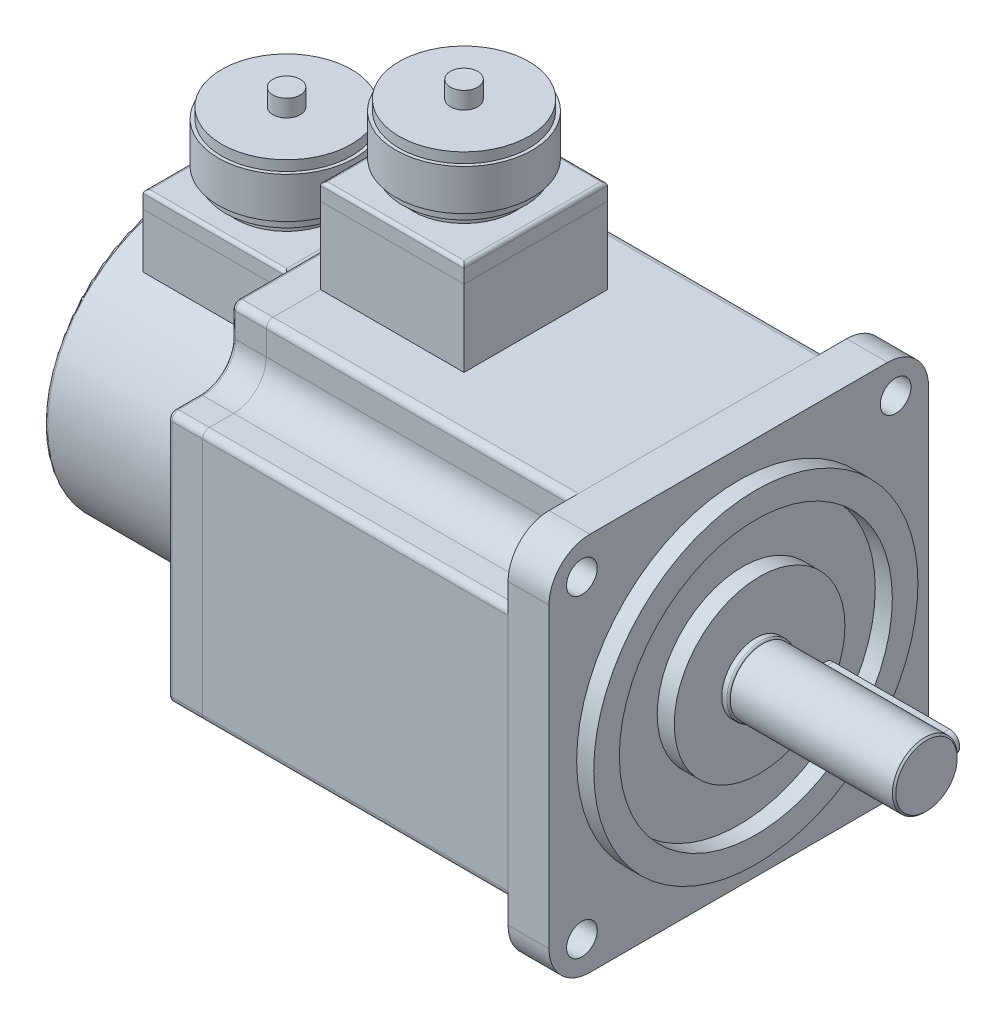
ISO-10303-21;
HEADER;
FILE_DESCRIPTION(('STEP AP214'),'2;1');
FILE_NAME('part.step','',(''),(''),'','','');
FILE_SCHEMA(('AUTOMOTIVE_DESIGN { 1 0 10303 214 1 1 1 1 }'));
ENDSEC;
DATA;
#1=APPLICATION_CONTEXT('core data for automotive mechanical design processes');
#2=APPLICATION_PROTOCOL_DEFINITION('international standard','automotive_design',2000,#1);
#3=PRODUCT_CONTEXT('',#1,'mechanical');
#4=PRODUCT('Part','Part','',(#3));
#5=PRODUCT_RELATED_PRODUCT_CATEGORY('part','',(#4));
#6=PRODUCT_DEFINITION_FORMATION('','',#4);
#7=PRODUCT_DEFINITION_CONTEXT('part definition',#1,'design');
#8=PRODUCT_DEFINITION('design','',#6,#7);
#9=PRODUCT_DEFINITION_SHAPE('','',#8);
#10=(LENGTH_UNIT() NAMED_UNIT(*) SI_UNIT(.MILLI.,.METRE.));
#11=(NAMED_UNIT(*) PLANE_ANGLE_UNIT() SI_UNIT($,.RADIAN.));
#12=(NAMED_UNIT(*) SI_UNIT($,.STERADIAN.) SOLID_ANGLE_UNIT());
#13=UNCERTAINTY_MEASURE_WITH_UNIT(LENGTH_MEASURE(1.E-05),#10,'distance_accuracy_value','');
#14=(GEOMETRIC_REPRESENTATION_CONTEXT(3) GLOBAL_UNCERTAINTY_ASSIGNED_CONTEXT((#13)) GLOBAL_UNIT_ASSIGNED_CONTEXT((#10,
#11,#12)) REPRESENTATION_CONTEXT('',''));
#15=CARTESIAN_POINT('',(0.,0.,0.));
#16=DIRECTION('',(0.,0.,1.));
#17=DIRECTION('',(1.,0.,0.));
#18=AXIS2_PLACEMENT_3D('',#15,#16,#17);
#19=CARTESIAN_POINT('',(161.,0.,-12.25));
#20=DIRECTION('',(0.,0.,1.));
#21=DIRECTION('',(1.,0.,0.));
#22=AXIS2_PLACEMENT_3D('',#19,#20,#21);
#23=CYLINDRICAL_SURFACE('',#22,2.99999999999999);
#24=CARTESIAN_POINT('',(161.,0.,-6.25));
#25=DIRECTION('',(0.,0.,-1.));
#26=DIRECTION('',(-1.,0.,0.));
#27=AXIS2_PLACEMENT_3D('',#24,#25,#26);
#28=CIRCLE('',#27,2.99999999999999);
#29=CARTESIAN_POINT('',(161.,2.99999999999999,-6.25));
#30=VERTEX_POINT('',#29);
#31=CARTESIAN_POINT('',(161.,-3.,-6.25));
#32=VERTEX_POINT('',#31);
#33=EDGE_CURVE('E115',#30,#32,#28,.T.);
#34=ORIENTED_EDGE('',*,*,#33,.T.);
#35=DIRECTION('',(0.,0.,1.));
#36=VECTOR('',#35,1.);
#37=CARTESIAN_POINT('',(161.,-3.,-12.25));
#38=LINE('',#37,#36);
#39=CARTESIAN_POINT('',(161.,-3.,-12.25));
#40=VERTEX_POINT('',#39);
#41=EDGE_CURVE('E13',#40,#32,#38,.T.);
#42=ORIENTED_EDGE('',*,*,#41,.F.);
#43=CARTESIAN_POINT('',(161.,0.,-12.25));
#44=DIRECTION('',(0.,0.,-1.));
#45=DIRECTION('',(-1.,0.,0.));
#46=AXIS2_PLACEMENT_3D('',#43,#44,#45);
#47=CIRCLE('',#46,2.99999999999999);
#48=CARTESIAN_POINT('',(161.,2.99999999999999,-12.25));
#49=VERTEX_POINT('',#48);
#50=EDGE_CURVE('E103',#49,#40,#47,.T.);
#51=ORIENTED_EDGE('',*,*,#50,.F.);
#52=DIRECTION('',(0.,0.,1.));
#53=VECTOR('',#52,1.);
#54=CARTESIAN_POINT('',(161.,2.99999999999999,-12.25));
#55=LINE('',#54,#53);
#56=EDGE_CURVE('E111',#49,#30,#55,.T.);
#57=ORIENTED_EDGE('',*,*,#56,.T.);
#58=EDGE_LOOP('',(#34,#42,#51,#57));
#59=FACE_BOUND('',#58,.T.);
#60=ADVANCED_FACE('F52',(#59),#23,.T.);
#61=CARTESIAN_POINT('',(127.,-3.,-12.25));
#62=DIRECTION('',(0.,1.,0.));
#63=DIRECTION('',(-1.,0.,0.));
#64=AXIS2_PLACEMENT_3D('',#61,#62,#63);
#65=PLANE('',#64);
#66=DIRECTION('',(-1.,0.,0.));
#67=VECTOR('',#66,1.);
#68=CARTESIAN_POINT('',(127.,-3.,-6.25));
#69=LINE('',#68,#67);
#70=CARTESIAN_POINT('',(127.,-3.,-6.25));
#71=VERTEX_POINT('',#70);
#72=EDGE_CURVE('E107',#32,#71,#69,.T.);
#73=ORIENTED_EDGE('',*,*,#72,.T.);
#74=DIRECTION('',(0.,0.,1.));
#75=VECTOR('',#74,1.);
#76=CARTESIAN_POINT('',(127.,-3.,-12.25));
#77=LINE('',#76,#75);
#78=CARTESIAN_POINT('',(127.,-3.,-12.25));
#79=VERTEX_POINT('',#78);
#80=EDGE_CURVE('E60',#79,#71,#77,.T.);
#81=ORIENTED_EDGE('',*,*,#80,.F.);
#82=DIRECTION('',(-1.,0.,0.));
#83=VECTOR('',#82,1.);
#84=CARTESIAN_POINT('',(127.,-3.,-12.25));
#85=LINE('',#84,#83);
#86=EDGE_CURVE('E98',#40,#79,#85,.T.);
#87=ORIENTED_EDGE('',*,*,#86,.F.);
#88=ORIENTED_EDGE('',*,*,#41,.T.);
#89=EDGE_LOOP('',(#73,#81,#87,#88));
#90=FACE_BOUND('',#89,.T.);
#91=ADVANCED_FACE('F106',(#90),#65,.F.);
#92=CARTESIAN_POINT('',(127.,0.,-12.25));
#93=DIRECTION('',(0.,0.,1.));
#94=DIRECTION('',(1.,0.,0.));
#95=AXIS2_PLACEMENT_3D('',#92,#93,#94);
#96=CYLINDRICAL_SURFACE('',#95,2.99999999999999);
#97=CARTESIAN_POINT('',(127.,0.,-6.25));
#98=DIRECTION('',(0.,0.,-1.));
#99=DIRECTION('',(-1.,0.,0.));
#100=AXIS2_PLACEMENT_3D('',#97,#98,#99);
#101=CIRCLE('',#100,2.99999999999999);
#102=CARTESIAN_POINT('',(127.,2.99999999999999,-6.25));
#103=VERTEX_POINT('',#102);
#104=EDGE_CURVE('E85',#71,#103,#101,.T.);
#105=ORIENTED_EDGE('',*,*,#104,.T.);
#106=DIRECTION('',(0.,0.,1.));
#107=VECTOR('',#106,1.);
#108=CARTESIAN_POINT('',(127.,2.99999999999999,-12.25));
#109=LINE('',#108,#107);
#110=CARTESIAN_POINT('',(127.,2.99999999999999,-12.25));
#111=VERTEX_POINT('',#110);
#112=EDGE_CURVE('E108',#111,#103,#109,.T.);
#113=ORIENTED_EDGE('',*,*,#112,.F.);
#114=CARTESIAN_POINT('',(127.,0.,-12.25));
#115=DIRECTION('',(0.,0.,-1.));
#116=DIRECTION('',(-1.,0.,0.));
#117=AXIS2_PLACEMENT_3D('',#114,#115,#116);
#118=CIRCLE('',#117,2.99999999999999);
#119=EDGE_CURVE('E101',#79,#111,#118,.T.);
#120=ORIENTED_EDGE('',*,*,#119,.F.);
#121=ORIENTED_EDGE('',*,*,#80,.T.);
#122=EDGE_LOOP('',(#105,#113,#120,#121));
#123=FACE_BOUND('',#122,.T.);
#124=ADVANCED_FACE('F109',(#123),#96,.T.);
#125=CARTESIAN_POINT('',(161.,2.99999999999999,-12.25));
#126=DIRECTION('',(0.,-1.,0.));
#127=DIRECTION('',(1.,0.,0.));
#128=AXIS2_PLACEMENT_3D('',#125,#126,#127);
#129=PLANE('',#128);
#130=DIRECTION('',(1.,0.,0.));
#131=VECTOR('',#130,1.);
#132=CARTESIAN_POINT('',(161.,2.99999999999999,-6.25));
#133=LINE('',#132,#131);
#134=EDGE_CURVE('E91',#103,#30,#133,.T.);
#135=ORIENTED_EDGE('',*,*,#134,.T.);
#136=ORIENTED_EDGE('',*,*,#56,.F.);
#137=DIRECTION('',(1.,0.,0.));
#138=VECTOR('',#137,1.);
#139=CARTESIAN_POINT('',(161.,2.99999999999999,-12.25));
#140=LINE('',#139,#138);
#141=EDGE_CURVE('E68',#111,#49,#140,.T.);
#142=ORIENTED_EDGE('',*,*,#141,.F.);
#143=ORIENTED_EDGE('',*,*,#112,.T.);
#144=EDGE_LOOP('',(#135,#136,#142,#143));
#145=FACE_BOUND('',#144,.T.);
#146=ADVANCED_FACE('F122',(#145),#129,.F.);
#147=CARTESIAN_POINT('',(161.,0.,-12.25));
#148=DIRECTION('',(0.,0.,-1.));
#149=DIRECTION('',(-1.,0.,0.));
#150=AXIS2_PLACEMENT_3D('',#147,#148,#149);
#151=PLANE('',#150);
#152=ORIENTED_EDGE('',*,*,#50,.T.);
#153=ORIENTED_EDGE('',*,*,#86,.T.);
#154=ORIENTED_EDGE('',*,*,#119,.T.);
#155=ORIENTED_EDGE('',*,*,#141,.T.);
#156=EDGE_LOOP('',(#152,#153,#154,#155));
#157=FACE_BOUND('',#156,.T.);
#158=ADVANCED_FACE('F99',(#157),#151,.T.);
#159=CARTESIAN_POINT('',(161.,0.,-6.25));
#160=DIRECTION('',(0.,0.,-1.));
#161=DIRECTION('',(-1.,0.,0.));
#162=AXIS2_PLACEMENT_3D('',#159,#160,#161);
#163=PLANE('',#162);
#164=ORIENTED_EDGE('',*,*,#33,.F.);
#165=ORIENTED_EDGE('',*,*,#134,.F.);
#166=ORIENTED_EDGE('',*,*,#104,.F.);
#167=ORIENTED_EDGE('',*,*,#72,.F.);
#168=EDGE_LOOP('',(#164,#165,#166,#167));
#169=FACE_BOUND('',#168,.T.);
#170=ADVANCED_FACE('F125',(#169),#163,.F.);
#171=CLOSED_SHELL('',(#60,#91,#124,#146,#158,#170));
#172=MANIFOLD_SOLID_BREP('B2',#171);
#173=CARTESIAN_POINT('',(31.,109.,0.));
#174=DIRECTION('',(0.,-1.,0.));
#175=DIRECTION('',(0.,0.,-1.));
#176=AXIS2_PLACEMENT_3D('',#173,#174,#175);
#177=CYLINDRICAL_SURFACE('',#176,4.);
#178=CARTESIAN_POINT('',(31.,109.,0.));
#179=DIRECTION('',(0.,1.,0.));
#180=DIRECTION('',(0.,0.,1.));
#181=AXIS2_PLACEMENT_3D('',#178,#179,#180);
#182=CIRCLE('',#181,4.);
#183=CARTESIAN_POINT('',(31.,109.,4.));
#184=VERTEX_POINT('',#183);
#185=EDGE_CURVE('E51',#184,#184,#182,.T.);
#186=ORIENTED_EDGE('',*,*,#185,.F.);
#187=EDGE_LOOP('',(#186));
#188=FACE_BOUND('',#187,.T.);
#189=CARTESIAN_POINT('',(31.,104.,0.));
#190=DIRECTION('',(0.,1.,0.));
#191=DIRECTION('',(0.,0.,1.));
#192=AXIS2_PLACEMENT_3D('',#189,#190,#191);
#193=CIRCLE('',#192,4.);
#194=CARTESIAN_POINT('',(31.,104.,4.));
#195=VERTEX_POINT('',#194);
#196=EDGE_CURVE('E187',#195,#195,#193,.T.);
#197=ORIENTED_EDGE('',*,*,#196,.T.);
#198=EDGE_LOOP('',(#197));
#199=FACE_BOUND('',#198,.T.);
#200=ADVANCED_FACE('F184',(#188,#199),#177,.T.);
#201=CARTESIAN_POINT('',(31.,109.,0.));
#202=DIRECTION('',(0.,1.,0.));
#203=DIRECTION('',(0.,0.,1.));
#204=AXIS2_PLACEMENT_3D('',#201,#202,#203);
#205=PLANE('',#204);
#206=ORIENTED_EDGE('',*,*,#185,.T.);
#207=EDGE_LOOP('',(#206));
#208=FACE_BOUND('',#207,.T.);
#209=ADVANCED_FACE('F199',(#208),#205,.T.);
#210=CARTESIAN_POINT('',(31.,104.,0.));
#211=DIRECTION('',(0.,1.,0.));
#212=DIRECTION('',(0.,0.,1.));
#213=AXIS2_PLACEMENT_3D('',#210,#211,#212);
#214=PLANE('',#213);
#215=ORIENTED_EDGE('',*,*,#196,.F.);
#216=EDGE_LOOP('',(#215));
#217=FACE_BOUND('',#216,.T.);
#218=ADVANCED_FACE('F197',(#217),#214,.F.);
#219=CLOSED_SHELL('',(#200,#209,#218));
#220=MANIFOLD_SOLID_BREP('B7',#219);
#221=CARTESIAN_POINT('',(31.,104.,0.));
#222=DIRECTION('',(0.,-1.,0.));
#223=DIRECTION('',(0.,0.,-1.));
#224=AXIS2_PLACEMENT_3D('',#221,#222,#223);
#225=CYLINDRICAL_SURFACE('',#224,19.);
#226=CARTESIAN_POINT('',(31.,104.,0.));
#227=DIRECTION('',(0.,1.,0.));
#228=DIRECTION('',(0.,0.,1.));
#229=AXIS2_PLACEMENT_3D('',#226,#227,#228);
#230=CIRCLE('',#229,19.);
#231=CARTESIAN_POINT('',(31.,104.,19.));
#232=VERTEX_POINT('',#231);
#233=EDGE_CURVE('E183',#232,#232,#230,.T.);
#234=ORIENTED_EDGE('',*,*,#233,.F.);
#235=EDGE_LOOP('',(#234));
#236=FACE_BOUND('',#235,.T.);
#237=CARTESIAN_POINT('',(31.,101.,0.));
#238=DIRECTION('',(0.,1.,0.));
#239=DIRECTION('',(0.,0.,1.));
#240=AXIS2_PLACEMENT_3D('',#237,#238,#239);
#241=CIRCLE('',#240,19.);
#242=CARTESIAN_POINT('',(31.,101.,19.));
#243=VERTEX_POINT('',#242);
#244=EDGE_CURVE('E236',#243,#243,#241,.T.);
#245=ORIENTED_EDGE('',*,*,#244,.T.);
#246=EDGE_LOOP('',(#245));
#247=FACE_BOUND('',#246,.T.);
#248=ADVANCED_FACE('F233',(#236,#247),#225,.T.);
#249=CARTESIAN_POINT('',(31.,104.,0.));
#250=DIRECTION('',(0.,1.,0.));
#251=DIRECTION('',(0.,0.,1.));
#252=AXIS2_PLACEMENT_3D('',#249,#250,#251);
#253=PLANE('',#252);
#254=ORIENTED_EDGE('',*,*,#233,.T.);
#255=EDGE_LOOP('',(#254));
#256=FACE_BOUND('',#255,.T.);
#257=ADVANCED_FACE('F248',(#256),#253,.T.);
#258=CARTESIAN_POINT('',(31.,101.,0.));
#259=DIRECTION('',(0.,1.,0.));
#260=DIRECTION('',(0.,0.,1.));
#261=AXIS2_PLACEMENT_3D('',#258,#259,#260);
#262=PLANE('',#261);
#263=ORIENTED_EDGE('',*,*,#244,.F.);
#264=EDGE_LOOP('',(#263));
#265=FACE_BOUND('',#264,.T.);
#266=ADVANCED_FACE('F246',(#265),#262,.F.);
#267=CLOSED_SHELL('',(#248,#257,#266));
#268=MANIFOLD_SOLID_BREP('B46',#267);
#269=CARTESIAN_POINT('',(31.,101.,0.));
#270=DIRECTION('',(0.,-1.,0.));
#271=DIRECTION('',(0.,0.,-1.));
#272=AXIS2_PLACEMENT_3D('',#269,#270,#271);
#273=CYLINDRICAL_SURFACE('',#272,20.);
#274=CARTESIAN_POINT('',(31.,101.,0.));
#275=DIRECTION('',(0.,1.,0.));
#276=DIRECTION('',(0.,0.,1.));
#277=AXIS2_PLACEMENT_3D('',#274,#275,#276);
#278=CIRCLE('',#277,20.);
#279=CARTESIAN_POINT('',(31.,101.,20.));
#280=VERTEX_POINT('',#279);
#281=EDGE_CURVE('E232',#280,#280,#278,.T.);
#282=ORIENTED_EDGE('',*,*,#281,.F.);
#283=EDGE_LOOP('',(#282));
#284=FACE_BOUND('',#283,.T.);
#285=CARTESIAN_POINT('',(31.,89.,0.));
#286=DIRECTION('',(0.,1.,0.));
#287=DIRECTION('',(0.,0.,1.));
#288=AXIS2_PLACEMENT_3D('',#285,#286,#287);
#289=CIRCLE('',#288,20.);
#290=CARTESIAN_POINT('',(31.,89.,20.));
#291=VERTEX_POINT('',#290);
#292=EDGE_CURVE('E285',#291,#291,#289,.T.);
#293=ORIENTED_EDGE('',*,*,#292,.T.);
#294=EDGE_LOOP('',(#293));
#295=FACE_BOUND('',#294,.T.);
#296=ADVANCED_FACE('F282',(#284,#295),#273,.T.);
#297=CARTESIAN_POINT('',(31.,101.,0.));
#298=DIRECTION('',(0.,1.,0.));
#299=DIRECTION('',(0.,0.,1.));
#300=AXIS2_PLACEMENT_3D('',#297,#298,#299);
#301=PLANE('',#300);
#302=ORIENTED_EDGE('',*,*,#281,.T.);
#303=EDGE_LOOP('',(#302));
#304=FACE_BOUND('',#303,.T.);
#305=ADVANCED_FACE('F297',(#304),#301,.T.);
#306=CARTESIAN_POINT('',(31.,89.,0.));
#307=DIRECTION('',(0.,1.,0.));
#308=DIRECTION('',(0.,0.,1.));
#309=AXIS2_PLACEMENT_3D('',#306,#307,#308);
#310=PLANE('',#309);
#311=ORIENTED_EDGE('',*,*,#292,.F.);
#312=EDGE_LOOP('',(#311));
#313=FACE_BOUND('',#312,.T.);
#314=ADVANCED_FACE('F295',(#313),#310,.F.);
#315=CLOSED_SHELL('',(#296,#305,#314));
#316=MANIFOLD_SOLID_BREP('B178',#315);
#317=CARTESIAN_POINT('',(31.,89.,0.));
#318=DIRECTION('',(0.,-1.,0.));
#319=DIRECTION('',(0.,0.,-1.));
#320=AXIS2_PLACEMENT_3D('',#317,#318,#319);
#321=CYLINDRICAL_SURFACE('',#320,18.);
#322=CARTESIAN_POINT('',(31.,89.,0.));
#323=DIRECTION('',(0.,1.,0.));
#324=DIRECTION('',(0.,0.,1.));
#325=AXIS2_PLACEMENT_3D('',#322,#323,#324);
#326=CIRCLE('',#325,18.);
#327=CARTESIAN_POINT('',(31.,89.,18.));
#328=VERTEX_POINT('',#327);
#329=EDGE_CURVE('E281',#328,#328,#326,.T.);
#330=ORIENTED_EDGE('',*,*,#329,.F.);
#331=EDGE_LOOP('',(#330));
#332=FACE_BOUND('',#331,.T.);
#333=CARTESIAN_POINT('',(31.,86.,0.));
#334=DIRECTION('',(0.,1.,0.));
#335=DIRECTION('',(0.,0.,1.));
#336=AXIS2_PLACEMENT_3D('',#333,#334,#335);
#337=CIRCLE('',#336,18.);
#338=CARTESIAN_POINT('',(31.,86.,18.));
#339=VERTEX_POINT('',#338);
#340=EDGE_CURVE('E334',#339,#339,#337,.T.);
#341=ORIENTED_EDGE('',*,*,#340,.T.);
#342=EDGE_LOOP('',(#341));
#343=FACE_BOUND('',#342,.T.);
#344=ADVANCED_FACE('F331',(#332,#343),#321,.T.);
#345=CARTESIAN_POINT('',(31.,89.,0.));
#346=DIRECTION('',(0.,1.,0.));
#347=DIRECTION('',(0.,0.,1.));
#348=AXIS2_PLACEMENT_3D('',#345,#346,#347);
#349=PLANE('',#348);
#350=ORIENTED_EDGE('',*,*,#329,.T.);
#351=EDGE_LOOP('',(#350));
#352=FACE_BOUND('',#351,.T.);
#353=ADVANCED_FACE('F346',(#352),#349,.T.);
#354=CARTESIAN_POINT('',(31.,86.,0.));
#355=DIRECTION('',(0.,1.,0.));
#356=DIRECTION('',(0.,0.,1.));
#357=AXIS2_PLACEMENT_3D('',#354,#355,#356);
#358=PLANE('',#357);
#359=ORIENTED_EDGE('',*,*,#340,.F.);
#360=EDGE_LOOP('',(#359));
#361=FACE_BOUND('',#360,.T.);
#362=ADVANCED_FACE('F344',(#361),#358,.F.);
#363=CLOSED_SHELL('',(#344,#353,#362));
#364=MANIFOLD_SOLID_BREP('B227',#363);
#365=CARTESIAN_POINT('',(31.,86.,0.));
#366=DIRECTION('',(0.,-1.,0.));
#367=DIRECTION('',(0.,0.,-1.));
#368=AXIS2_PLACEMENT_3D('',#365,#366,#367);
#369=CYLINDRICAL_SURFACE('',#368,15.);
#370=CARTESIAN_POINT('',(31.,86.,0.));
#371=DIRECTION('',(0.,1.,0.));
#372=DIRECTION('',(0.,0.,1.));
#373=AXIS2_PLACEMENT_3D('',#370,#371,#372);
#374=CIRCLE('',#373,15.);
#375=CARTESIAN_POINT('',(31.,86.,15.));
#376=VERTEX_POINT('',#375);
#377=EDGE_CURVE('E330',#376,#376,#374,.T.);
#378=ORIENTED_EDGE('',*,*,#377,.F.);
#379=EDGE_LOOP('',(#378));
#380=FACE_BOUND('',#379,.T.);
#381=CARTESIAN_POINT('',(31.,83.,0.));
#382=DIRECTION('',(0.,1.,0.));
#383=DIRECTION('',(0.,0.,1.));
#384=AXIS2_PLACEMENT_3D('',#381,#382,#383);
#385=CIRCLE('',#384,15.);
#386=CARTESIAN_POINT('',(31.,83.,15.));
#387=VERTEX_POINT('',#386);
#388=EDGE_CURVE('E385',#387,#387,#385,.T.);
#389=ORIENTED_EDGE('',*,*,#388,.T.);
#390=EDGE_LOOP('',(#389));
#391=FACE_BOUND('',#390,.T.);
#392=ADVANCED_FACE('F382',(#380,#391),#369,.T.);
#393=CARTESIAN_POINT('',(31.,86.,0.));
#394=DIRECTION('',(0.,1.,0.));
#395=DIRECTION('',(0.,0.,1.));
#396=AXIS2_PLACEMENT_3D('',#393,#394,#395);
#397=PLANE('',#396);
#398=ORIENTED_EDGE('',*,*,#377,.T.);
#399=EDGE_LOOP('',(#398));
#400=FACE_BOUND('',#399,.T.);
#401=ADVANCED_FACE('F397',(#400),#397,.T.);
#402=CARTESIAN_POINT('',(31.,83.,0.));
#403=DIRECTION('',(0.,1.,0.));
#404=DIRECTION('',(0.,0.,1.));
#405=AXIS2_PLACEMENT_3D('',#402,#403,#404);
#406=PLANE('',#405);
#407=ORIENTED_EDGE('',*,*,#388,.F.);
#408=EDGE_LOOP('',(#407));
#409=FACE_BOUND('',#408,.T.);
#410=ADVANCED_FACE('F395',(#409),#406,.F.);
#411=CLOSED_SHELL('',(#392,#401,#410));
#412=MANIFOLD_SOLID_BREP('B276',#411);
#413=CARTESIAN_POINT('',(52.,83.,21.));
#414=DIRECTION('',(-1.,0.,0.));
#415=DIRECTION('',(0.,0.,1.));
#416=AXIS2_PLACEMENT_3D('',#413,#414,#415);
#417=PLANE('',#416);
#418=DIRECTION('',(0.,-1.,0.));
#419=VECTOR('',#418,1.);
#420=CARTESIAN_POINT('',(52.,83.,-21.));
#421=LINE('',#420,#419);
#422=CARTESIAN_POINT('',(52.,82.,-21.));
#423=VERTEX_POINT('',#422);
#424=CARTESIAN_POINT('',(52.,78.,-21.));
#425=VERTEX_POINT('',#424);
#426=EDGE_CURVE('E485',#423,#425,#421,.T.);
#427=ORIENTED_EDGE('',*,*,#426,.F.);
#428=DIRECTION('',(0.,0.,-1.));
#429=VECTOR('',#428,1.);
#430=CARTESIAN_POINT('',(52.,82.,21.));
#431=LINE('',#430,#429);
#432=CARTESIAN_POINT('',(52.,82.,21.));
#433=VERTEX_POINT('',#432);
#434=EDGE_CURVE('E380',#423,#433,#431,.F.);
#435=ORIENTED_EDGE('',*,*,#434,.T.);
#436=DIRECTION('',(0.,-1.,0.));
#437=VECTOR('',#436,1.);
#438=CARTESIAN_POINT('',(52.,83.,21.));
#439=LINE('',#438,#437);
#440=CARTESIAN_POINT('',(52.,78.,21.));
#441=VERTEX_POINT('',#440);
#442=EDGE_CURVE('E505',#433,#441,#439,.T.);
#443=ORIENTED_EDGE('',*,*,#442,.T.);
#444=DIRECTION('',(0.,0.,-1.));
#445=VECTOR('',#444,1.);
#446=CARTESIAN_POINT('',(52.,78.,21.));
#447=LINE('',#446,#445);
#448=EDGE_CURVE('E500',#441,#425,#447,.T.);
#449=ORIENTED_EDGE('',*,*,#448,.T.);
#450=EDGE_LOOP('',(#427,#435,#443,#449));
#451=FACE_BOUND('',#450,.T.);
#452=ADVANCED_FACE('F433',(#451),#417,.F.);
#453=CARTESIAN_POINT('',(10.,83.,-21.));
#454=DIRECTION('',(0.,0.,1.));
#455=DIRECTION('',(1.,0.,0.));
#456=AXIS2_PLACEMENT_3D('',#453,#454,#455);
#457=PLANE('',#456);
#458=DIRECTION('',(0.,-1.,0.));
#459=VECTOR('',#458,1.);
#460=CARTESIAN_POINT('',(10.,83.,-21.));
#461=LINE('',#460,#459);
#462=CARTESIAN_POINT('',(10.,82.,-21.));
#463=VERTEX_POINT('',#462);
#464=CARTESIAN_POINT('',(10.,78.,-21.));
#465=VERTEX_POINT('',#464);
#466=EDGE_CURVE('E494',#463,#465,#461,.T.);
#467=ORIENTED_EDGE('',*,*,#466,.F.);
#468=DIRECTION('',(-1.,0.,0.));
#469=VECTOR('',#468,1.);
#470=CARTESIAN_POINT('',(10.,82.,-21.));
#471=LINE('',#470,#469);
#472=EDGE_CURVE('E442',#463,#423,#471,.F.);
#473=ORIENTED_EDGE('',*,*,#472,.T.);
#474=ORIENTED_EDGE('',*,*,#426,.T.);
#475=DIRECTION('',(-1.,0.,0.));
#476=VECTOR('',#475,1.);
#477=CARTESIAN_POINT('',(10.,78.,-21.));
#478=LINE('',#477,#476);
#479=EDGE_CURVE('E488',#425,#465,#478,.T.);
#480=ORIENTED_EDGE('',*,*,#479,.T.);
#481=EDGE_LOOP('',(#467,#473,#474,#480));
#482=FACE_BOUND('',#481,.T.);
#483=ADVANCED_FACE('F487',(#482),#457,.F.);
#484=CARTESIAN_POINT('',(10.,83.,21.));
#485=DIRECTION('',(1.,0.,0.));
#486=DIRECTION('',(0.,0.,-1.));
#487=AXIS2_PLACEMENT_3D('',#484,#485,#486);
#488=PLANE('',#487);
#489=DIRECTION('',(0.,-1.,0.));
#490=VECTOR('',#489,1.);
#491=CARTESIAN_POINT('',(10.,83.,21.));
#492=LINE('',#491,#490);
#493=CARTESIAN_POINT('',(10.,82.,21.));
#494=VERTEX_POINT('',#493);
#495=CARTESIAN_POINT('',(10.,78.,21.));
#496=VERTEX_POINT('',#495);
#497=EDGE_CURVE('E515',#494,#496,#492,.T.);
#498=ORIENTED_EDGE('',*,*,#497,.F.);
#499=DIRECTION('',(0.,0.,1.));
#500=VECTOR('',#499,1.);
#501=CARTESIAN_POINT('',(10.,82.,21.));
#502=LINE('',#501,#500);
#503=EDGE_CURVE('E457',#494,#463,#502,.F.);
#504=ORIENTED_EDGE('',*,*,#503,.T.);
#505=ORIENTED_EDGE('',*,*,#466,.T.);
#506=DIRECTION('',(0.,0.,1.));
#507=VECTOR('',#506,1.);
#508=CARTESIAN_POINT('',(10.,78.,21.));
#509=LINE('',#508,#507);
#510=EDGE_CURVE('E502',#465,#496,#509,.T.);
#511=ORIENTED_EDGE('',*,*,#510,.T.);
#512=EDGE_LOOP('',(#498,#504,#505,#511));
#513=FACE_BOUND('',#512,.T.);
#514=ADVANCED_FACE('F553',(#513),#488,.F.);
#515=CARTESIAN_POINT('',(10.,83.,21.));
#516=DIRECTION('',(0.,0.,-1.));
#517=DIRECTION('',(-1.,0.,0.));
#518=AXIS2_PLACEMENT_3D('',#515,#516,#517);
#519=PLANE('',#518);
#520=ORIENTED_EDGE('',*,*,#442,.F.);
#521=DIRECTION('',(1.,0.,0.));
#522=VECTOR('',#521,1.);
#523=CARTESIAN_POINT('',(10.,82.,21.));
#524=LINE('',#523,#522);
#525=EDGE_CURVE('E526',#433,#494,#524,.F.);
#526=ORIENTED_EDGE('',*,*,#525,.T.);
#527=ORIENTED_EDGE('',*,*,#497,.T.);
#528=DIRECTION('',(1.,0.,0.));
#529=VECTOR('',#528,1.);
#530=CARTESIAN_POINT('',(10.,78.,21.));
#531=LINE('',#530,#529);
#532=EDGE_CURVE('E512',#496,#441,#531,.T.);
#533=ORIENTED_EDGE('',*,*,#532,.T.);
#534=EDGE_LOOP('',(#520,#526,#527,#533));
#535=FACE_BOUND('',#534,.T.);
#536=ADVANCED_FACE('F552',(#535),#519,.F.);
#537=CARTESIAN_POINT('',(0.,83.,0.));
#538=DIRECTION('',(0.,-1.,0.));
#539=DIRECTION('',(0.,0.,-1.));
#540=AXIS2_PLACEMENT_3D('',#537,#538,#539);
#541=PLANE('',#540);
#542=DIRECTION('',(0.,0.,1.));
#543=VECTOR('',#542,1.);
#544=CARTESIAN_POINT('',(11.,83.,0.));
#545=LINE('',#544,#543);
#546=CARTESIAN_POINT('',(11.,83.,-20.));
#547=VERTEX_POINT('',#546);
#548=CARTESIAN_POINT('',(11.,83.,20.));
#549=VERTEX_POINT('',#548);
#550=EDGE_CURVE('E521',#547,#549,#545,.T.);
#551=ORIENTED_EDGE('',*,*,#550,.T.);
#552=DIRECTION('',(1.,0.,0.));
#553=VECTOR('',#552,1.);
#554=CARTESIAN_POINT('',(0.,83.,20.));
#555=LINE('',#554,#553);
#556=CARTESIAN_POINT('',(51.,83.,20.));
#557=VERTEX_POINT('',#556);
#558=EDGE_CURVE('E523',#549,#557,#555,.T.);
#559=ORIENTED_EDGE('',*,*,#558,.T.);
#560=DIRECTION('',(0.,0.,-1.));
#561=VECTOR('',#560,1.);
#562=CARTESIAN_POINT('',(51.,83.,0.));
#563=LINE('',#562,#561);
#564=CARTESIAN_POINT('',(51.,83.,-20.));
#565=VERTEX_POINT('',#564);
#566=EDGE_CURVE('E493',#557,#565,#563,.T.);
#567=ORIENTED_EDGE('',*,*,#566,.T.);
#568=DIRECTION('',(-1.,0.,0.));
#569=VECTOR('',#568,1.);
#570=CARTESIAN_POINT('',(0.,83.,-20.));
#571=LINE('',#570,#569);
#572=EDGE_CURVE('E519',#565,#547,#571,.T.);
#573=ORIENTED_EDGE('',*,*,#572,.T.);
#574=EDGE_LOOP('',(#551,#559,#567,#573));
#575=FACE_BOUND('',#574,.T.);
#576=ADVANCED_FACE('F545',(#575),#541,.F.);
#577=CARTESIAN_POINT('',(0.,78.,0.));
#578=DIRECTION('',(0.,-1.,0.));
#579=DIRECTION('',(0.,0.,-1.));
#580=AXIS2_PLACEMENT_3D('',#577,#578,#579);
#581=PLANE('',#580);
#582=ORIENTED_EDGE('',*,*,#448,.F.);
#583=ORIENTED_EDGE('',*,*,#532,.F.);
#584=ORIENTED_EDGE('',*,*,#510,.F.);
#585=ORIENTED_EDGE('',*,*,#479,.F.);
#586=EDGE_LOOP('',(#582,#583,#584,#585));
#587=FACE_BOUND('',#586,.T.);
#588=ADVANCED_FACE('F498',(#587),#581,.T.);
#589=CARTESIAN_POINT('',(0.,82.,-20.));
#590=DIRECTION('',(-1.,0.,0.));
#591=DIRECTION('',(0.,0.,1.));
#592=AXIS2_PLACEMENT_3D('',#589,#590,#591);
#593=CYLINDRICAL_SURFACE('',#592,1.);
#594=CARTESIAN_POINT('',(51.,82.,-20.));
#595=DIRECTION('',(-0.707106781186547,0.,-0.707106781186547));
#596=DIRECTION('',(0.707106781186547,0.,-0.707106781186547));
#597=AXIS2_PLACEMENT_3D('',#594,#595,#596);
#598=ELLIPSE('',#597,1.41421356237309,1.);
#599=EDGE_CURVE('E509',#423,#565,#598,.F.);
#600=ORIENTED_EDGE('',*,*,#599,.F.);
#601=ORIENTED_EDGE('',*,*,#472,.F.);
#602=CARTESIAN_POINT('',(11.,82.,-20.));
#603=DIRECTION('',(-0.707106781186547,0.,0.707106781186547));
#604=DIRECTION('',(-0.707106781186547,0.,-0.707106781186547));
#605=AXIS2_PLACEMENT_3D('',#602,#603,#604);
#606=ELLIPSE('',#605,1.41421356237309,1.);
#607=EDGE_CURVE('E437',#547,#463,#606,.T.);
#608=ORIENTED_EDGE('',*,*,#607,.F.);
#609=ORIENTED_EDGE('',*,*,#572,.F.);
#610=EDGE_LOOP('',(#600,#601,#608,#609));
#611=FACE_BOUND('',#610,.T.);
#612=ADVANCED_FACE('F435',(#611),#593,.T.);
#613=CARTESIAN_POINT('',(11.,82.,0.));
#614=DIRECTION('',(0.,0.,1.));
#615=DIRECTION('',(1.,0.,0.));
#616=AXIS2_PLACEMENT_3D('',#613,#614,#615);
#617=CYLINDRICAL_SURFACE('',#616,1.);
#618=ORIENTED_EDGE('',*,*,#607,.T.);
#619=ORIENTED_EDGE('',*,*,#503,.F.);
#620=CARTESIAN_POINT('',(11.,82.,20.));
#621=DIRECTION('',(0.707106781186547,0.,0.707106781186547));
#622=DIRECTION('',(-0.707106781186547,0.,0.707106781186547));
#623=AXIS2_PLACEMENT_3D('',#620,#621,#622);
#624=ELLIPSE('',#623,1.41421356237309,1.);
#625=EDGE_CURVE('E533',#549,#494,#624,.T.);
#626=ORIENTED_EDGE('',*,*,#625,.F.);
#627=ORIENTED_EDGE('',*,*,#550,.F.);
#628=EDGE_LOOP('',(#618,#619,#626,#627));
#629=FACE_BOUND('',#628,.T.);
#630=ADVANCED_FACE('F570',(#629),#617,.T.);
#631=CARTESIAN_POINT('',(51.,82.,0.));
#632=DIRECTION('',(0.,0.,-1.));
#633=DIRECTION('',(-1.,0.,0.));
#634=AXIS2_PLACEMENT_3D('',#631,#632,#633);
#635=CYLINDRICAL_SURFACE('',#634,1.);
#636=ORIENTED_EDGE('',*,*,#599,.T.);
#637=ORIENTED_EDGE('',*,*,#566,.F.);
#638=CARTESIAN_POINT('',(51.,82.,20.));
#639=DIRECTION('',(0.707106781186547,0.,-0.707106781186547));
#640=DIRECTION('',(-0.707106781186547,0.,-0.707106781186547));
#641=AXIS2_PLACEMENT_3D('',#638,#639,#640);
#642=ELLIPSE('',#641,1.41421356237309,1.);
#643=EDGE_CURVE('E531',#433,#557,#642,.F.);
#644=ORIENTED_EDGE('',*,*,#643,.F.);
#645=ORIENTED_EDGE('',*,*,#434,.F.);
#646=EDGE_LOOP('',(#636,#637,#644,#645));
#647=FACE_BOUND('',#646,.T.);
#648=ADVANCED_FACE('F538',(#647),#635,.T.);
#649=CARTESIAN_POINT('',(0.,82.,20.));
#650=DIRECTION('',(1.,0.,0.));
#651=DIRECTION('',(0.,0.,-1.));
#652=AXIS2_PLACEMENT_3D('',#649,#650,#651);
#653=CYLINDRICAL_SURFACE('',#652,1.);
#654=ORIENTED_EDGE('',*,*,#625,.T.);
#655=ORIENTED_EDGE('',*,*,#525,.F.);
#656=ORIENTED_EDGE('',*,*,#643,.T.);
#657=ORIENTED_EDGE('',*,*,#558,.F.);
#658=EDGE_LOOP('',(#654,#655,#656,#657));
#659=FACE_BOUND('',#658,.T.);
#660=ADVANCED_FACE('F549',(#659),#653,.T.);
#661=CLOSED_SHELL('',(#452,#483,#514,#536,#576,#588,#612,#630,#648,#660));
#662=MANIFOLD_SOLID_BREP('B325',#661);
#663=CARTESIAN_POINT('',(52.,78.,21.));
#664=DIRECTION('',(-1.,0.,0.));
#665=DIRECTION('',(0.,0.,1.));
#666=AXIS2_PLACEMENT_3D('',#663,#664,#665);
#667=PLANE('',#666);
#668=DIRECTION('',(0.,0.,-1.));
#669=VECTOR('',#668,1.);
#670=CARTESIAN_POINT('',(52.,55.6,21.));
#671=LINE('',#670,#669);
#672=CARTESIAN_POINT('',(52.,55.6,21.));
#673=VERTEX_POINT('',#672);
#674=CARTESIAN_POINT('',(52.,55.6,-21.));
#675=VERTEX_POINT('',#674);
#676=EDGE_CURVE('E708',#673,#675,#671,.T.);
#677=ORIENTED_EDGE('',*,*,#676,.T.);
#678=DIRECTION('',(0.,-1.,0.));
#679=VECTOR('',#678,1.);
#680=CARTESIAN_POINT('',(52.,78.,-21.));
#681=LINE('',#680,#679);
#682=CARTESIAN_POINT('',(52.,78.,-21.));
#683=VERTEX_POINT('',#682);
#684=EDGE_CURVE('E431',#683,#675,#681,.T.);
#685=ORIENTED_EDGE('',*,*,#684,.F.);
#686=DIRECTION('',(0.,0.,-1.));
#687=VECTOR('',#686,1.);
#688=CARTESIAN_POINT('',(52.,78.,21.));
#689=LINE('',#688,#687);
#690=CARTESIAN_POINT('',(52.,78.,21.));
#691=VERTEX_POINT('',#690);
#692=EDGE_CURVE('E696',#691,#683,#689,.T.);
#693=ORIENTED_EDGE('',*,*,#692,.F.);
#694=DIRECTION('',(0.,-1.,0.));
#695=VECTOR('',#694,1.);
#696=CARTESIAN_POINT('',(52.,78.,21.));
#697=LINE('',#696,#695);
#698=EDGE_CURVE('E704',#691,#673,#697,.T.);
#699=ORIENTED_EDGE('',*,*,#698,.T.);
#700=EDGE_LOOP('',(#677,#685,#693,#699));
#701=FACE_BOUND('',#700,.T.);
#702=ADVANCED_FACE('F645',(#701),#667,.F.);
#703=CARTESIAN_POINT('',(10.,78.,-21.));
#704=DIRECTION('',(0.,0.,1.));
#705=DIRECTION('',(1.,0.,0.));
#706=AXIS2_PLACEMENT_3D('',#703,#704,#705);
#707=PLANE('',#706);
#708=DIRECTION('',(-1.,0.,0.));
#709=VECTOR('',#708,1.);
#710=CARTESIAN_POINT('',(10.,55.6,-21.));
#711=LINE('',#710,#709);
#712=CARTESIAN_POINT('',(10.,55.6,-21.));
#713=VERTEX_POINT('',#712);
#714=EDGE_CURVE('E700',#675,#713,#711,.T.);
#715=ORIENTED_EDGE('',*,*,#714,.T.);
#716=DIRECTION('',(0.,-1.,0.));
#717=VECTOR('',#716,1.);
#718=CARTESIAN_POINT('',(10.,78.,-21.));
#719=LINE('',#718,#717);
#720=CARTESIAN_POINT('',(10.,78.,-21.));
#721=VERTEX_POINT('',#720);
#722=EDGE_CURVE('E653',#721,#713,#719,.T.);
#723=ORIENTED_EDGE('',*,*,#722,.F.);
#724=DIRECTION('',(-1.,0.,0.));
#725=VECTOR('',#724,1.);
#726=CARTESIAN_POINT('',(10.,78.,-21.));
#727=LINE('',#726,#725);
#728=EDGE_CURVE('E691',#683,#721,#727,.T.);
#729=ORIENTED_EDGE('',*,*,#728,.F.);
#730=ORIENTED_EDGE('',*,*,#684,.T.);
#731=EDGE_LOOP('',(#715,#723,#729,#730));
#732=FACE_BOUND('',#731,.T.);
#733=ADVANCED_FACE('F699',(#732),#707,.F.);
#734=CARTESIAN_POINT('',(10.,78.,21.));
#735=DIRECTION('',(1.,0.,0.));
#736=DIRECTION('',(0.,0.,-1.));
#737=AXIS2_PLACEMENT_3D('',#734,#735,#736);
#738=PLANE('',#737);
#739=DIRECTION('',(0.,0.,1.));
#740=VECTOR('',#739,1.);
#741=CARTESIAN_POINT('',(10.,55.6,21.));
#742=LINE('',#741,#740);
#743=CARTESIAN_POINT('',(10.,55.6,21.));
#744=VERTEX_POINT('',#743);
#745=EDGE_CURVE('E678',#713,#744,#742,.T.);
#746=ORIENTED_EDGE('',*,*,#745,.T.);
#747=DIRECTION('',(0.,-1.,0.));
#748=VECTOR('',#747,1.);
#749=CARTESIAN_POINT('',(10.,78.,21.));
#750=LINE('',#749,#748);
#751=CARTESIAN_POINT('',(10.,78.,21.));
#752=VERTEX_POINT('',#751);
#753=EDGE_CURVE('E701',#752,#744,#750,.T.);
#754=ORIENTED_EDGE('',*,*,#753,.F.);
#755=DIRECTION('',(0.,0.,1.));
#756=VECTOR('',#755,1.);
#757=CARTESIAN_POINT('',(10.,78.,21.));
#758=LINE('',#757,#756);
#759=EDGE_CURVE('E694',#721,#752,#758,.T.);
#760=ORIENTED_EDGE('',*,*,#759,.F.);
#761=ORIENTED_EDGE('',*,*,#722,.T.);
#762=EDGE_LOOP('',(#746,#754,#760,#761));
#763=FACE_BOUND('',#762,.T.);
#764=ADVANCED_FACE('F702',(#763),#738,.F.);
#765=CARTESIAN_POINT('',(10.,78.,21.));
#766=DIRECTION('',(0.,0.,-1.));
#767=DIRECTION('',(-1.,0.,0.));
#768=AXIS2_PLACEMENT_3D('',#765,#766,#767);
#769=PLANE('',#768);
#770=DIRECTION('',(1.,0.,0.));
#771=VECTOR('',#770,1.);
#772=CARTESIAN_POINT('',(10.,55.6,21.));
#773=LINE('',#772,#771);
#774=EDGE_CURVE('E684',#744,#673,#773,.T.);
#775=ORIENTED_EDGE('',*,*,#774,.T.);
#776=ORIENTED_EDGE('',*,*,#698,.F.);
#777=DIRECTION('',(1.,0.,0.));
#778=VECTOR('',#777,1.);
#779=CARTESIAN_POINT('',(10.,78.,21.));
#780=LINE('',#779,#778);
#781=EDGE_CURVE('E661',#752,#691,#780,.T.);
#782=ORIENTED_EDGE('',*,*,#781,.F.);
#783=ORIENTED_EDGE('',*,*,#753,.T.);
#784=EDGE_LOOP('',(#775,#776,#782,#783));
#785=FACE_BOUND('',#784,.T.);
#786=ADVANCED_FACE('F715',(#785),#769,.F.);
#787=CARTESIAN_POINT('',(0.,78.,0.));
#788=DIRECTION('',(0.,-1.,0.));
#789=DIRECTION('',(0.,0.,-1.));
#790=AXIS2_PLACEMENT_3D('',#787,#788,#789);
#791=PLANE('',#790);
#792=ORIENTED_EDGE('',*,*,#692,.T.);
#793=ORIENTED_EDGE('',*,*,#728,.T.);
#794=ORIENTED_EDGE('',*,*,#759,.T.);
#795=ORIENTED_EDGE('',*,*,#781,.T.);
#796=EDGE_LOOP('',(#792,#793,#794,#795));
#797=FACE_BOUND('',#796,.T.);
#798=ADVANCED_FACE('F692',(#797),#791,.F.);
#799=CARTESIAN_POINT('',(0.,55.6,0.));
#800=DIRECTION('',(0.,-1.,0.));
#801=DIRECTION('',(0.,0.,-1.));
#802=AXIS2_PLACEMENT_3D('',#799,#800,#801);
#803=PLANE('',#802);
#804=ORIENTED_EDGE('',*,*,#676,.F.);
#805=ORIENTED_EDGE('',*,*,#774,.F.);
#806=ORIENTED_EDGE('',*,*,#745,.F.);
#807=ORIENTED_EDGE('',*,*,#714,.F.);
#808=EDGE_LOOP('',(#804,#805,#806,#807));
#809=FACE_BOUND('',#808,.T.);
#810=ADVANCED_FACE('F718',(#809),#803,.T.);
#811=CLOSED_SHELL('',(#702,#733,#764,#786,#798,#810));
#812=MANIFOLD_SOLID_BREP('B374',#811);
#813=CARTESIAN_POINT('',(-21.,76.,0.));
#814=DIRECTION('',(0.,1.,0.));
#815=DIRECTION('',(0.,0.,1.));
#816=AXIS2_PLACEMENT_3D('',#813,#814,#815);
#817=PLANE('',#816);
#818=CARTESIAN_POINT('',(-21.,76.,0.));
#819=DIRECTION('',(0.,1.,0.));
#820=DIRECTION('',(0.,0.,1.));
#821=AXIS2_PLACEMENT_3D('',#818,#819,#820);
#822=CIRCLE('',#821,19.);
#823=CARTESIAN_POINT('',(-21.,76.,19.));
#824=VERTEX_POINT('',#823);
#825=EDGE_CURVE('E801',#824,#824,#822,.T.);
#826=ORIENTED_EDGE('',*,*,#825,.T.);
#827=EDGE_LOOP('',(#826));
#828=FACE_BOUND('',#827,.T.);
#829=CARTESIAN_POINT('',(-21.,76.,0.));
#830=DIRECTION('',(0.,1.,0.));
#831=DIRECTION('',(0.,0.,1.));
#832=AXIS2_PLACEMENT_3D('',#829,#830,#831);
#833=CIRCLE('',#832,4.);
#834=CARTESIAN_POINT('',(-21.,76.,4.));
#835=VERTEX_POINT('',#834);
#836=EDGE_CURVE('E810',#835,#835,#833,.T.);
#837=ORIENTED_EDGE('',*,*,#836,.F.);
#838=EDGE_LOOP('',(#837));
#839=FACE_BOUND('',#838,.T.);
#840=ADVANCED_FACE('F779',(#828,#839),#817,.T.);
#841=CARTESIAN_POINT('',(-21.,73.,0.));
#842=DIRECTION('',(0.,1.,0.));
#843=DIRECTION('',(0.,0.,1.));
#844=AXIS2_PLACEMENT_3D('',#841,#842,#843);
#845=PLANE('',#844);
#846=CARTESIAN_POINT('',(-21.,73.,0.));
#847=DIRECTION('',(0.,1.,0.));
#848=DIRECTION('',(0.,0.,1.));
#849=AXIS2_PLACEMENT_3D('',#846,#847,#848);
#850=CIRCLE('',#849,20.);
#851=CARTESIAN_POINT('',(-21.,73.,20.));
#852=VERTEX_POINT('',#851);
#853=EDGE_CURVE('E795',#852,#852,#850,.T.);
#854=ORIENTED_EDGE('',*,*,#853,.T.);
#855=EDGE_LOOP('',(#854));
#856=FACE_BOUND('',#855,.T.);
#857=CARTESIAN_POINT('',(-21.,73.,0.));
#858=DIRECTION('',(0.,1.,0.));
#859=DIRECTION('',(0.,0.,1.));
#860=AXIS2_PLACEMENT_3D('',#857,#858,#859);
#861=CIRCLE('',#860,19.);
#862=CARTESIAN_POINT('',(-21.,73.,19.));
#863=VERTEX_POINT('',#862);
#864=EDGE_CURVE('E804',#863,#863,#861,.T.);
#865=ORIENTED_EDGE('',*,*,#864,.F.);
#866=EDGE_LOOP('',(#865));
#867=FACE_BOUND('',#866,.T.);
#868=ADVANCED_FACE('F826',(#856,#867),#845,.T.);
#869=CARTESIAN_POINT('',(-21.,58.,0.));
#870=DIRECTION('',(0.,-1.,0.));
#871=DIRECTION('',(0.,0.,-1.));
#872=AXIS2_PLACEMENT_3D('',#869,#870,#871);
#873=CYLINDRICAL_SURFACE('',#872,15.);
#874=CARTESIAN_POINT('',(-21.,58.,0.));
#875=DIRECTION('',(0.,1.,0.));
#876=DIRECTION('',(0.,0.,1.));
#877=AXIS2_PLACEMENT_3D('',#874,#875,#876);
#878=CIRCLE('',#877,15.);
#879=CARTESIAN_POINT('',(-21.,58.,15.));
#880=VERTEX_POINT('',#879);
#881=EDGE_CURVE('E644',#880,#880,#878,.T.);
#882=ORIENTED_EDGE('',*,*,#881,.F.);
#883=EDGE_LOOP('',(#882));
#884=FACE_BOUND('',#883,.T.);
#885=CARTESIAN_POINT('',(-21.,55.,0.));
#886=DIRECTION('',(0.,1.,0.));
#887=DIRECTION('',(0.,0.,1.));
#888=AXIS2_PLACEMENT_3D('',#885,#886,#887);
#889=CIRCLE('',#888,15.);
#890=CARTESIAN_POINT('',(-21.,55.,15.));
#891=VERTEX_POINT('',#890);
#892=EDGE_CURVE('E783',#891,#891,#889,.T.);
#893=ORIENTED_EDGE('',*,*,#892,.T.);
#894=EDGE_LOOP('',(#893));
#895=FACE_BOUND('',#894,.T.);
#896=ADVANCED_FACE('F781',(#884,#895),#873,.T.);
#897=CARTESIAN_POINT('',(-21.,55.,0.));
#898=DIRECTION('',(0.,1.,0.));
#899=DIRECTION('',(0.,0.,1.));
#900=AXIS2_PLACEMENT_3D('',#897,#898,#899);
#901=PLANE('',#900);
#902=ORIENTED_EDGE('',*,*,#892,.F.);
#903=EDGE_LOOP('',(#902));
#904=FACE_BOUND('',#903,.T.);
#905=ADVANCED_FACE('F851',(#904),#901,.F.);
#906=CARTESIAN_POINT('',(-21.,58.,0.));
#907=DIRECTION('',(0.,1.,0.));
#908=DIRECTION('',(0.,0.,1.));
#909=AXIS2_PLACEMENT_3D('',#906,#907,#908);
#910=PLANE('',#909);
#911=CARTESIAN_POINT('',(-21.,58.,0.));
#912=DIRECTION('',(0.,1.,0.));
#913=DIRECTION('',(0.,0.,1.));
#914=AXIS2_PLACEMENT_3D('',#911,#912,#913);
#915=CIRCLE('',#914,18.);
#916=CARTESIAN_POINT('',(-21.,58.,18.));
#917=VERTEX_POINT('',#916);
#918=EDGE_CURVE('E792',#917,#917,#915,.T.);
#919=ORIENTED_EDGE('',*,*,#918,.F.);
#920=EDGE_LOOP('',(#919));
#921=FACE_BOUND('',#920,.T.);
#922=ORIENTED_EDGE('',*,*,#881,.T.);
#923=EDGE_LOOP('',(#922));
#924=FACE_BOUND('',#923,.T.);
#925=ADVANCED_FACE('F848',(#921,#924),#910,.F.);
#926=CARTESIAN_POINT('',(-21.,61.,0.));
#927=DIRECTION('',(0.,-1.,0.));
#928=DIRECTION('',(0.,0.,-1.));
#929=AXIS2_PLACEMENT_3D('',#926,#927,#928);
#930=CYLINDRICAL_SURFACE('',#929,18.);
#931=CARTESIAN_POINT('',(-21.,61.,0.));
#932=DIRECTION('',(0.,1.,0.));
#933=DIRECTION('',(0.,0.,1.));
#934=AXIS2_PLACEMENT_3D('',#931,#932,#933);
#935=CIRCLE('',#934,18.);
#936=CARTESIAN_POINT('',(-21.,61.,18.));
#937=VERTEX_POINT('',#936);
#938=EDGE_CURVE('E790',#937,#937,#935,.T.);
#939=ORIENTED_EDGE('',*,*,#938,.F.);
#940=EDGE_LOOP('',(#939));
#941=FACE_BOUND('',#940,.T.);
#942=ORIENTED_EDGE('',*,*,#918,.T.);
#943=EDGE_LOOP('',(#942));
#944=FACE_BOUND('',#943,.T.);
#945=ADVANCED_FACE('F843',(#941,#944),#930,.T.);
#946=CARTESIAN_POINT('',(-21.,61.,0.));
#947=DIRECTION('',(0.,1.,0.));
#948=DIRECTION('',(0.,0.,1.));
#949=AXIS2_PLACEMENT_3D('',#946,#947,#948);
#950=PLANE('',#949);
#951=CARTESIAN_POINT('',(-21.,61.,0.));
#952=DIRECTION('',(0.,1.,0.));
#953=DIRECTION('',(0.,0.,1.));
#954=AXIS2_PLACEMENT_3D('',#951,#952,#953);
#955=CIRCLE('',#954,20.);
#956=CARTESIAN_POINT('',(-21.,61.,20.));
#957=VERTEX_POINT('',#956);
#958=EDGE_CURVE('E798',#957,#957,#955,.T.);
#959=ORIENTED_EDGE('',*,*,#958,.F.);
#960=EDGE_LOOP('',(#959));
#961=FACE_BOUND('',#960,.T.);
#962=ORIENTED_EDGE('',*,*,#938,.T.);
#963=EDGE_LOOP('',(#962));
#964=FACE_BOUND('',#963,.T.);
#965=ADVANCED_FACE('F840',(#961,#964),#950,.F.);
#966=CARTESIAN_POINT('',(-21.,73.,0.));
#967=DIRECTION('',(0.,-1.,0.));
#968=DIRECTION('',(0.,0.,-1.));
#969=AXIS2_PLACEMENT_3D('',#966,#967,#968);
#970=CYLINDRICAL_SURFACE('',#969,20.);
#971=ORIENTED_EDGE('',*,*,#853,.F.);
#972=EDGE_LOOP('',(#971));
#973=FACE_BOUND('',#972,.T.);
#974=ORIENTED_EDGE('',*,*,#958,.T.);
#975=EDGE_LOOP('',(#974));
#976=FACE_BOUND('',#975,.T.);
#977=ADVANCED_FACE('F837',(#973,#976),#970,.T.);
#978=CARTESIAN_POINT('',(-21.,76.,0.));
#979=DIRECTION('',(0.,-1.,0.));
#980=DIRECTION('',(0.,0.,-1.));
#981=AXIS2_PLACEMENT_3D('',#978,#979,#980);
#982=CYLINDRICAL_SURFACE('',#981,19.);
#983=ORIENTED_EDGE('',*,*,#825,.F.);
#984=EDGE_LOOP('',(#983));
#985=FACE_BOUND('',#984,.T.);
#986=ORIENTED_EDGE('',*,*,#864,.T.);
#987=EDGE_LOOP('',(#986));
#988=FACE_BOUND('',#987,.T.);
#989=ADVANCED_FACE('F821',(#985,#988),#982,.T.);
#990=CARTESIAN_POINT('',(-21.,81.,0.));
#991=DIRECTION('',(0.,-1.,0.));
#992=DIRECTION('',(0.,0.,-1.));
#993=AXIS2_PLACEMENT_3D('',#990,#991,#992);
#994=CYLINDRICAL_SURFACE('',#993,4.);
#995=CARTESIAN_POINT('',(-21.,81.,0.));
#996=DIRECTION('',(0.,1.,0.));
#997=DIRECTION('',(0.,0.,1.));
#998=AXIS2_PLACEMENT_3D('',#995,#996,#997);
#999=CIRCLE('',#998,4.);
#1000=CARTESIAN_POINT('',(-21.,81.,4.));
#1001=VERTEX_POINT('',#1000);
#1002=EDGE_CURVE('E807',#1001,#1001,#999,.T.);
#1003=ORIENTED_EDGE('',*,*,#1002,.F.);
#1004=EDGE_LOOP('',(#1003));
#1005=FACE_BOUND('',#1004,.T.);
#1006=ORIENTED_EDGE('',*,*,#836,.T.);
#1007=EDGE_LOOP('',(#1006));
#1008=FACE_BOUND('',#1007,.T.);
#1009=ADVANCED_FACE('F818',(#1005,#1008),#994,.T.);
#1010=CARTESIAN_POINT('',(-21.,81.,0.));
#1011=DIRECTION('',(0.,1.,0.));
#1012=DIRECTION('',(0.,0.,1.));
#1013=AXIS2_PLACEMENT_3D('',#1010,#1011,#1012);
#1014=PLANE('',#1013);
#1015=ORIENTED_EDGE('',*,*,#1002,.T.);
#1016=EDGE_LOOP('',(#1015));
#1017=FACE_BOUND('',#1016,.T.);
#1018=ADVANCED_FACE('F816',(#1017),#1014,.T.);
#1019=CLOSED_SHELL('',(#840,#868,#896,#905,#925,#945,#965,#977,#989,#1009,#1018));
#1020=MANIFOLD_SOLID_BREP('B425',#1019);
#1021=CARTESIAN_POINT('',(0.,55.,21.));
#1022=DIRECTION('',(-1.,0.,0.));
#1023=DIRECTION('',(0.,0.,1.));
#1024=AXIS2_PLACEMENT_3D('',#1021,#1022,#1023);
#1025=PLANE('',#1024);
#1026=DIRECTION('',(0.,-1.,0.));
#1027=VECTOR('',#1026,1.);
#1028=CARTESIAN_POINT('',(0.,55.,-21.));
#1029=LINE('',#1028,#1027);
#1030=CARTESIAN_POINT('',(0.,54.,-21.));
#1031=VERTEX_POINT('',#1030);
#1032=CARTESIAN_POINT('',(0.,50.,-21.));
#1033=VERTEX_POINT('',#1032);
#1034=EDGE_CURVE('E1002',#1031,#1033,#1029,.T.);
#1035=ORIENTED_EDGE('',*,*,#1034,.F.);
#1036=DIRECTION('',(0.,0.,-1.));
#1037=VECTOR('',#1036,1.);
#1038=CARTESIAN_POINT('',(0.,54.,21.));
#1039=LINE('',#1038,#1037);
#1040=CARTESIAN_POINT('',(0.,54.,21.));
#1041=VERTEX_POINT('',#1040);
#1042=EDGE_CURVE('E777',#1031,#1041,#1039,.F.);
#1043=ORIENTED_EDGE('',*,*,#1042,.T.);
#1044=DIRECTION('',(0.,-1.,0.));
#1045=VECTOR('',#1044,1.);
#1046=CARTESIAN_POINT('',(0.,55.,21.));
#1047=LINE('',#1046,#1045);
#1048=CARTESIAN_POINT('',(0.,50.,21.));
#1049=VERTEX_POINT('',#1048);
#1050=EDGE_CURVE('E1022',#1041,#1049,#1047,.T.);
#1051=ORIENTED_EDGE('',*,*,#1050,.T.);
#1052=DIRECTION('',(0.,0.,-1.));
#1053=VECTOR('',#1052,1.);
#1054=CARTESIAN_POINT('',(0.,50.,21.));
#1055=LINE('',#1054,#1053);
#1056=EDGE_CURVE('E1017',#1049,#1033,#1055,.T.);
#1057=ORIENTED_EDGE('',*,*,#1056,.T.);
#1058=EDGE_LOOP('',(#1035,#1043,#1051,#1057));
#1059=FACE_BOUND('',#1058,.T.);
#1060=ADVANCED_FACE('F950',(#1059),#1025,.F.);
#1061=CARTESIAN_POINT('',(-42.,55.,-21.));
#1062=DIRECTION('',(0.,0.,1.));
#1063=DIRECTION('',(1.,0.,0.));
#1064=AXIS2_PLACEMENT_3D('',#1061,#1062,#1063);
#1065=PLANE('',#1064);
#1066=DIRECTION('',(0.,-1.,0.));
#1067=VECTOR('',#1066,1.);
#1068=CARTESIAN_POINT('',(-42.,55.,-21.));
#1069=LINE('',#1068,#1067);
#1070=CARTESIAN_POINT('',(-42.,54.,-21.));
#1071=VERTEX_POINT('',#1070);
#1072=CARTESIAN_POINT('',(-42.,50.,-21.));
#1073=VERTEX_POINT('',#1072);
#1074=EDGE_CURVE('E1011',#1071,#1073,#1069,.T.);
#1075=ORIENTED_EDGE('',*,*,#1074,.F.);
#1076=DIRECTION('',(-1.,0.,0.));
#1077=VECTOR('',#1076,1.);
#1078=CARTESIAN_POINT('',(-42.,54.,-21.));
#1079=LINE('',#1078,#1077);
#1080=EDGE_CURVE('E959',#1071,#1031,#1079,.F.);
#1081=ORIENTED_EDGE('',*,*,#1080,.T.);
#1082=ORIENTED_EDGE('',*,*,#1034,.T.);
#1083=DIRECTION('',(-1.,0.,0.));
#1084=VECTOR('',#1083,1.);
#1085=CARTESIAN_POINT('',(-42.,50.,-21.));
#1086=LINE('',#1085,#1084);
#1087=EDGE_CURVE('E1005',#1033,#1073,#1086,.T.);
#1088=ORIENTED_EDGE('',*,*,#1087,.T.);
#1089=EDGE_LOOP('',(#1075,#1081,#1082,#1088));
#1090=FACE_BOUND('',#1089,.T.);
#1091=ADVANCED_FACE('F1004',(#1090),#1065,.F.);
#1092=CARTESIAN_POINT('',(-42.,55.,21.));
#1093=DIRECTION('',(1.,0.,0.));
#1094=DIRECTION('',(0.,0.,-1.));
#1095=AXIS2_PLACEMENT_3D('',#1092,#1093,#1094);
#1096=PLANE('',#1095);
#1097=DIRECTION('',(0.,-1.,0.));
#1098=VECTOR('',#1097,1.);
#1099=CARTESIAN_POINT('',(-42.,55.,21.));
#1100=LINE('',#1099,#1098);
#1101=CARTESIAN_POINT('',(-42.,54.,21.));
#1102=VERTEX_POINT('',#1101);
#1103=CARTESIAN_POINT('',(-42.,50.,21.));
#1104=VERTEX_POINT('',#1103);
#1105=EDGE_CURVE('E1032',#1102,#1104,#1100,.T.);
#1106=ORIENTED_EDGE('',*,*,#1105,.F.);
#1107=DIRECTION('',(0.,0.,1.));
#1108=VECTOR('',#1107,1.);
#1109=CARTESIAN_POINT('',(-42.,54.,21.));
#1110=LINE('',#1109,#1108);
#1111=EDGE_CURVE('E974',#1102,#1071,#1110,.F.);
#1112=ORIENTED_EDGE('',*,*,#1111,.T.);
#1113=ORIENTED_EDGE('',*,*,#1074,.T.);
#1114=DIRECTION('',(0.,0.,1.));
#1115=VECTOR('',#1114,1.);
#1116=CARTESIAN_POINT('',(-42.,50.,21.));
#1117=LINE('',#1116,#1115);
#1118=EDGE_CURVE('E1019',#1073,#1104,#1117,.T.);
#1119=ORIENTED_EDGE('',*,*,#1118,.T.);
#1120=EDGE_LOOP('',(#1106,#1112,#1113,#1119));
#1121=FACE_BOUND('',#1120,.T.);
#1122=ADVANCED_FACE('F1070',(#1121),#1096,.F.);
#1123=CARTESIAN_POINT('',(-42.,55.,21.));
#1124=DIRECTION('',(0.,0.,-1.));
#1125=DIRECTION('',(-1.,0.,0.));
#1126=AXIS2_PLACEMENT_3D('',#1123,#1124,#1125);
#1127=PLANE('',#1126);
#1128=ORIENTED_EDGE('',*,*,#1050,.F.);
#1129=DIRECTION('',(1.,0.,0.));
#1130=VECTOR('',#1129,1.);
#1131=CARTESIAN_POINT('',(-42.,54.,21.));
#1132=LINE('',#1131,#1130);
#1133=EDGE_CURVE('E1043',#1041,#1102,#1132,.F.);
#1134=ORIENTED_EDGE('',*,*,#1133,.T.);
#1135=ORIENTED_EDGE('',*,*,#1105,.T.);
#1136=DIRECTION('',(1.,0.,0.));
#1137=VECTOR('',#1136,1.);
#1138=CARTESIAN_POINT('',(-42.,50.,21.));
#1139=LINE('',#1138,#1137);
#1140=EDGE_CURVE('E1029',#1104,#1049,#1139,.T.);
#1141=ORIENTED_EDGE('',*,*,#1140,.T.);
#1142=EDGE_LOOP('',(#1128,#1134,#1135,#1141));
#1143=FACE_BOUND('',#1142,.T.);
#1144=ADVANCED_FACE('F1069',(#1143),#1127,.F.);
#1145=CARTESIAN_POINT('',(0.,55.,0.));
#1146=DIRECTION('',(0.,-1.,0.));
#1147=DIRECTION('',(0.,0.,-1.));
#1148=AXIS2_PLACEMENT_3D('',#1145,#1146,#1147);
#1149=PLANE('',#1148);
#1150=DIRECTION('',(0.,0.,1.));
#1151=VECTOR('',#1150,1.);
#1152=CARTESIAN_POINT('',(-41.,55.,0.));
#1153=LINE('',#1152,#1151);
#1154=CARTESIAN_POINT('',(-41.,55.,-20.));
#1155=VERTEX_POINT('',#1154);
#1156=CARTESIAN_POINT('',(-41.,55.,20.));
#1157=VERTEX_POINT('',#1156);
#1158=EDGE_CURVE('E1038',#1155,#1157,#1153,.T.);
#1159=ORIENTED_EDGE('',*,*,#1158,.T.);
#1160=DIRECTION('',(1.,0.,0.));
#1161=VECTOR('',#1160,1.);
#1162=CARTESIAN_POINT('',(0.,55.,20.));
#1163=LINE('',#1162,#1161);
#1164=CARTESIAN_POINT('',(-1.,55.,20.));
#1165=VERTEX_POINT('',#1164);
#1166=EDGE_CURVE('E1040',#1157,#1165,#1163,.T.);
#1167=ORIENTED_EDGE('',*,*,#1166,.T.);
#1168=DIRECTION('',(0.,0.,-1.));
#1169=VECTOR('',#1168,1.);
#1170=CARTESIAN_POINT('',(-1.,55.,0.));
#1171=LINE('',#1170,#1169);
#1172=CARTESIAN_POINT('',(-1.,55.,-20.));
#1173=VERTEX_POINT('',#1172);
#1174=EDGE_CURVE('E1010',#1165,#1173,#1171,.T.);
#1175=ORIENTED_EDGE('',*,*,#1174,.T.);
#1176=DIRECTION('',(-1.,0.,0.));
#1177=VECTOR('',#1176,1.);
#1178=CARTESIAN_POINT('',(0.,55.,-20.));
#1179=LINE('',#1178,#1177);
#1180=EDGE_CURVE('E1036',#1173,#1155,#1179,.T.);
#1181=ORIENTED_EDGE('',*,*,#1180,.T.);
#1182=EDGE_LOOP('',(#1159,#1167,#1175,#1181));
#1183=FACE_BOUND('',#1182,.T.);
#1184=ADVANCED_FACE('F1062',(#1183),#1149,.F.);
#1185=CARTESIAN_POINT('',(0.,50.,0.));
#1186=DIRECTION('',(0.,-1.,0.));
#1187=DIRECTION('',(0.,0.,-1.));
#1188=AXIS2_PLACEMENT_3D('',#1185,#1186,#1187);
#1189=PLANE('',#1188);
#1190=ORIENTED_EDGE('',*,*,#1056,.F.);
#1191=ORIENTED_EDGE('',*,*,#1140,.F.);
#1192=ORIENTED_EDGE('',*,*,#1118,.F.);
#1193=ORIENTED_EDGE('',*,*,#1087,.F.);
#1194=EDGE_LOOP('',(#1190,#1191,#1192,#1193));
#1195=FACE_BOUND('',#1194,.T.);
#1196=ADVANCED_FACE('F1015',(#1195),#1189,.T.);
#1197=CARTESIAN_POINT('',(0.,54.,-20.));
#1198=DIRECTION('',(-1.,0.,0.));
#1199=DIRECTION('',(0.,0.,1.));
#1200=AXIS2_PLACEMENT_3D('',#1197,#1198,#1199);
#1201=CYLINDRICAL_SURFACE('',#1200,1.);
#1202=CARTESIAN_POINT('',(-1.,54.,-20.));
#1203=DIRECTION('',(-0.707106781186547,0.,-0.707106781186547));
#1204=DIRECTION('',(0.707106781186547,0.,-0.707106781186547));
#1205=AXIS2_PLACEMENT_3D('',#1202,#1203,#1204);
#1206=ELLIPSE('',#1205,1.41421356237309,1.);
#1207=EDGE_CURVE('E1026',#1031,#1173,#1206,.F.);
#1208=ORIENTED_EDGE('',*,*,#1207,.F.);
#1209=ORIENTED_EDGE('',*,*,#1080,.F.);
#1210=CARTESIAN_POINT('',(-41.,54.,-20.));
#1211=DIRECTION('',(-0.707106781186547,0.,0.707106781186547));
#1212=DIRECTION('',(-0.707106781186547,0.,-0.707106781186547));
#1213=AXIS2_PLACEMENT_3D('',#1210,#1211,#1212);
#1214=ELLIPSE('',#1213,1.41421356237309,1.);
#1215=EDGE_CURVE('E954',#1155,#1071,#1214,.T.);
#1216=ORIENTED_EDGE('',*,*,#1215,.F.);
#1217=ORIENTED_EDGE('',*,*,#1180,.F.);
#1218=EDGE_LOOP('',(#1208,#1209,#1216,#1217));
#1219=FACE_BOUND('',#1218,.T.);
#1220=ADVANCED_FACE('F952',(#1219),#1201,.T.);
#1221=CARTESIAN_POINT('',(-41.,54.,0.));
#1222=DIRECTION('',(0.,0.,1.));
#1223=DIRECTION('',(1.,0.,0.));
#1224=AXIS2_PLACEMENT_3D('',#1221,#1222,#1223);
#1225=CYLINDRICAL_SURFACE('',#1224,1.);
#1226=ORIENTED_EDGE('',*,*,#1215,.T.);
#1227=ORIENTED_EDGE('',*,*,#1111,.F.);
#1228=CARTESIAN_POINT('',(-41.,54.,20.));
#1229=DIRECTION('',(0.707106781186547,0.,0.707106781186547));
#1230=DIRECTION('',(-0.707106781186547,0.,0.707106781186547));
#1231=AXIS2_PLACEMENT_3D('',#1228,#1229,#1230);
#1232=ELLIPSE('',#1231,1.41421356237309,1.);
#1233=EDGE_CURVE('E1050',#1157,#1102,#1232,.T.);
#1234=ORIENTED_EDGE('',*,*,#1233,.F.);
#1235=ORIENTED_EDGE('',*,*,#1158,.F.);
#1236=EDGE_LOOP('',(#1226,#1227,#1234,#1235));
#1237=FACE_BOUND('',#1236,.T.);
#1238=ADVANCED_FACE('F1087',(#1237),#1225,.T.);
#1239=CARTESIAN_POINT('',(-1.,54.,0.));
#1240=DIRECTION('',(0.,0.,-1.));
#1241=DIRECTION('',(-1.,0.,0.));
#1242=AXIS2_PLACEMENT_3D('',#1239,#1240,#1241);
#1243=CYLINDRICAL_SURFACE('',#1242,1.);
#1244=ORIENTED_EDGE('',*,*,#1207,.T.);
#1245=ORIENTED_EDGE('',*,*,#1174,.F.);
#1246=CARTESIAN_POINT('',(-1.,54.,20.));
#1247=DIRECTION('',(0.707106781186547,0.,-0.707106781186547));
#1248=DIRECTION('',(-0.707106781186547,0.,-0.707106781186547));
#1249=AXIS2_PLACEMENT_3D('',#1246,#1247,#1248);
#1250=ELLIPSE('',#1249,1.41421356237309,1.);
#1251=EDGE_CURVE('E1048',#1041,#1165,#1250,.F.);
#1252=ORIENTED_EDGE('',*,*,#1251,.F.);
#1253=ORIENTED_EDGE('',*,*,#1042,.F.);
#1254=EDGE_LOOP('',(#1244,#1245,#1252,#1253));
#1255=FACE_BOUND('',#1254,.T.);
#1256=ADVANCED_FACE('F1055',(#1255),#1243,.T.);
#1257=CARTESIAN_POINT('',(0.,54.,20.));
#1258=DIRECTION('',(1.,0.,0.));
#1259=DIRECTION('',(0.,0.,-1.));
#1260=AXIS2_PLACEMENT_3D('',#1257,#1258,#1259);
#1261=CYLINDRICAL_SURFACE('',#1260,1.);
#1262=ORIENTED_EDGE('',*,*,#1233,.T.);
#1263=ORIENTED_EDGE('',*,*,#1133,.F.);
#1264=ORIENTED_EDGE('',*,*,#1251,.T.);
#1265=ORIENTED_EDGE('',*,*,#1166,.F.);
#1266=EDGE_LOOP('',(#1262,#1263,#1264,#1265));
#1267=FACE_BOUND('',#1266,.T.);
#1268=ADVANCED_FACE('F1066',(#1267),#1261,.T.);
#1269=CLOSED_SHELL('',(#1060,#1091,#1122,#1144,#1184,#1196,#1220,#1238,#1256,#1268));
#1270=MANIFOLD_SOLID_BREP('B639',#1269);
#1271=CARTESIAN_POINT('',(166.5,0.,0.));
#1272=DIRECTION('',(-1.,0.,0.));
#1273=DIRECTION('',(0.,0.,1.));
#1274=AXIS2_PLACEMENT_3D('',#1271,#1272,#1273);
#1275=CYLINDRICAL_SURFACE('',#1274,9.5);
#1276=CARTESIAN_POINT('',(118.5,0.,0.));
#1277=DIRECTION('',(1.,0.,0.));
#1278=DIRECTION('',(0.,0.,-1.));
#1279=AXIS2_PLACEMENT_3D('',#1276,#1277,#1278);
#1280=CIRCLE('',#1279,9.5);
#1281=CARTESIAN_POINT('',(118.5,0.,-9.5));
#1282=VERTEX_POINT('',#1281);
#1283=EDGE_CURVE('E1221',#1282,#1282,#1280,.T.);
#1284=ORIENTED_EDGE('',*,*,#1283,.T.);
#1285=EDGE_LOOP('',(#1284));
#1286=FACE_BOUND('',#1285,.T.);
#1287=CARTESIAN_POINT('',(166.,0.,0.));
#1288=DIRECTION('',(1.,0.,0.));
#1289=DIRECTION('',(0.,0.,-1.));
#1290=AXIS2_PLACEMENT_3D('',#1287,#1288,#1289);
#1291=CIRCLE('',#1290,9.5);
#1292=CARTESIAN_POINT('',(166.,0.,-9.5));
#1293=VERTEX_POINT('',#1292);
#1294=EDGE_CURVE('E1233',#1293,#1293,#1291,.F.);
#1295=ORIENTED_EDGE('',*,*,#1294,.T.);
#1296=EDGE_LOOP('',(#1295));
#1297=FACE_BOUND('',#1296,.T.);
#1298=CARTESIAN_POINT('',(161.,2.99999999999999,-9.01387818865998));
#1299=CARTESIAN_POINT('',(161.082111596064,3.00001051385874,-9.01386597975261));
#1300=CARTESIAN_POINT('',(161.164216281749,2.99662905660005,-9.01499989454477));
#1301=CARTESIAN_POINT('',(161.327794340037,2.98316404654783,-9.01946917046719));
#1302=CARTESIAN_POINT('',(161.409267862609,2.9730821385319,-9.02280399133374));
#1303=CARTESIAN_POINT('',(161.570786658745,2.9463344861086,-9.03157240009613));
#1304=CARTESIAN_POINT('',(161.65083521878,2.92968675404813,-9.03700024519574));
#1305=CARTESIAN_POINT('',(161.809146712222,2.88997412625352,-9.04977799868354));
#1306=CARTESIAN_POINT('',(161.887409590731,2.86690903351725,-9.05712796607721));
#1307=CARTESIAN_POINT('',(162.118641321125,2.78838156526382,-9.08173850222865));
#1308=CARTESIAN_POINT('',(162.268274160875,2.72354999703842,-9.10157261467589));
#1309=CARTESIAN_POINT('',(162.554549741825,2.57094386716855,-9.14584733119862));
#1310=CARTESIAN_POINT('',(162.691185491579,2.48315705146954,-9.17029039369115));
#1311=CARTESIAN_POINT('',(162.952408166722,2.28383887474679,-9.22198403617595));
#1312=CARTESIAN_POINT('',(163.076477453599,2.17164444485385,-9.24929895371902));
#1313=CARTESIAN_POINT('',(163.304387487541,1.92811437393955,-9.30311268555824));
#1314=CARTESIAN_POINT('',(163.408224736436,1.79677542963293,-9.32961135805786));
#1315=CARTESIAN_POINT('',(163.595038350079,1.51492697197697,-9.3795477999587));
#1316=CARTESIAN_POINT('',(163.677476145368,1.3640440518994,-9.40290050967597));
#1317=CARTESIAN_POINT('',(163.815596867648,1.04969762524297,-9.44315613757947));
#1318=CARTESIAN_POINT('',(163.871287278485,0.88623765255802,-9.46006085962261));
#1319=CARTESIAN_POINT('',(163.952593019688,0.556831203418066,-9.48505937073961));
#1320=CARTESIAN_POINT('',(163.979099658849,0.391124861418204,-9.49341369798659));
#1321=CARTESIAN_POINT('',(164.004111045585,0.0574168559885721,-9.50129109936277));
#1322=CARTESIAN_POINT('',(164.002621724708,-0.110584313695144,-9.50081604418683));
#1323=CARTESIAN_POINT('',(163.972265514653,-0.437828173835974,-9.49126851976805));
#1324=CARTESIAN_POINT('',(163.94436558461,-0.597170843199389,-9.48249971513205));
#1325=CARTESIAN_POINT('',(163.863569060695,-0.908782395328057,-9.45772480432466));
#1326=CARTESIAN_POINT('',(163.810671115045,-1.06105089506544,-9.44171830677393));
#1327=CARTESIAN_POINT('',(163.680767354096,-1.35640803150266,-9.40386197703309));
#1328=CARTESIAN_POINT('',(163.603470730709,-1.49935942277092,-9.38194214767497));
#1329=CARTESIAN_POINT('',(163.427198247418,-1.77055948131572,-9.33456474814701));
#1330=CARTESIAN_POINT('',(163.328217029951,-1.89880450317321,-9.309106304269));
#1331=CARTESIAN_POINT('',(163.106446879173,-2.14270544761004,-9.25608223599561));
#1332=CARTESIAN_POINT('',(162.982826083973,-2.25759649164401,-9.22847303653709));
#1333=CARTESIAN_POINT('',(162.71778720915,-2.46526929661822,-9.17518254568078));
#1334=CARTESIAN_POINT('',(162.576363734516,-2.55804433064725,-9.14950184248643));
#1335=CARTESIAN_POINT('',(162.277505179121,-2.71978065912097,-9.10274637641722));
#1336=CARTESIAN_POINT('',(162.119896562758,-2.7884391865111,-9.08173131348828));
#1337=CARTESIAN_POINT('',(161.794613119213,-2.89791755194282,-9.04739847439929));
#1338=CARTESIAN_POINT('',(161.626954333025,-2.93878053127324,-9.0340687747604));
#1339=CARTESIAN_POINT('',(161.381411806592,-2.97664323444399,-9.02162485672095));
#1340=CARTESIAN_POINT('',(161.305370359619,-2.98539986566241,-9.01872707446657));
#1341=CARTESIAN_POINT('',(161.152899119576,-2.99707362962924,-9.01485301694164));
#1342=CARTESIAN_POINT('',(161.07647001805,-2.99999890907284,-9.01387406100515));
#1343=CARTESIAN_POINT('',(161.,-3.,-9.01387818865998));
#1344=B_SPLINE_CURVE_WITH_KNOTS('',3,(#1298,#1299,#1300,#1301,#1302,#1303,#1304,#1305,#1306,
#1307,#1308,#1309,#1310,#1311,#1312,#1313,#1314,#1315,#1316,#1317,#1318,#1319,#1320,#1321,#1322,
#1323,#1324,#1325,#1326,#1327,#1328,#1329,#1330,#1331,#1332,#1333,#1334,#1335,#1336,#1337,#1338,
#1339,#1340,#1341,#1342,#1343),.UNSPECIFIED.,.F.,.F.,(4,2,2,2,2,2,2,2,2,2,2,2,2,2,2,2,2,2,2,2,2,
2,4),(0.,0.246245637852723,0.492430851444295,0.737945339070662,0.983467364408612,
1.47384684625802,1.9644886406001,2.47064554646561,2.97688989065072,3.49485361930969,
4.01267233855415,4.5141953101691,5.01561202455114,5.49935290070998,5.98311993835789,
6.47288577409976,6.96277275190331,7.47344235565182,7.98426708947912,8.50129313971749,
9.01751487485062,9.24710313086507,9.47637041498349),.UNSPECIFIED.);
#1345=CARTESIAN_POINT('',(161.,2.99999999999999,-9.01387818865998));
#1346=VERTEX_POINT('',#1345);
#1347=CARTESIAN_POINT('',(161.,-3.,-9.01387818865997));
#1348=VERTEX_POINT('',#1347);
#1349=EDGE_CURVE('E948',#1346,#1348,#1344,.T.);
#1350=ORIENTED_EDGE('',*,*,#1349,.F.);
#1351=DIRECTION('',(-1.,0.,0.));
#1352=VECTOR('',#1351,1.);
#1353=CARTESIAN_POINT('',(166.5,2.99999999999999,-9.01387818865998));
#1354=LINE('',#1353,#1352);
#1355=CARTESIAN_POINT('',(127.,2.99999999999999,-9.01387818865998));
#1356=VERTEX_POINT('',#1355);
#1357=EDGE_CURVE('E1174',#1356,#1346,#1354,.F.);
#1358=ORIENTED_EDGE('',*,*,#1357,.F.);
#1359=CARTESIAN_POINT('',(127.,-3.,-9.01387818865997));
#1360=CARTESIAN_POINT('',(126.917888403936,-3.00001051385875,-9.0138659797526));
#1361=CARTESIAN_POINT('',(126.835783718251,-2.99662905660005,-9.01499989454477));
#1362=CARTESIAN_POINT('',(126.672205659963,-2.98316404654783,-9.01946917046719));
#1363=CARTESIAN_POINT('',(126.590732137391,-2.97308213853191,-9.02280399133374));
#1364=CARTESIAN_POINT('',(126.429213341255,-2.94633448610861,-9.03157240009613));
#1365=CARTESIAN_POINT('',(126.34916478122,-2.92968675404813,-9.03700024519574));
#1366=CARTESIAN_POINT('',(126.190853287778,-2.88997412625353,-9.04977799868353));
#1367=CARTESIAN_POINT('',(126.112590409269,-2.86690903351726,-9.05712796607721));
#1368=CARTESIAN_POINT('',(125.881358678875,-2.78838156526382,-9.08173850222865));
#1369=CARTESIAN_POINT('',(125.731725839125,-2.72354999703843,-9.10157261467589));
#1370=CARTESIAN_POINT('',(125.445450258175,-2.57094386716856,-9.14584733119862));
#1371=CARTESIAN_POINT('',(125.308814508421,-2.48315705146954,-9.17029039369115));
#1372=CARTESIAN_POINT('',(125.047591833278,-2.28383887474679,-9.22198403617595));
#1373=CARTESIAN_POINT('',(124.923522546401,-2.17164444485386,-9.24929895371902));
#1374=CARTESIAN_POINT('',(124.695612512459,-1.92811437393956,-9.30311268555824));
#1375=CARTESIAN_POINT('',(124.591775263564,-1.79677542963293,-9.32961135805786));
#1376=CARTESIAN_POINT('',(124.404961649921,-1.51492697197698,-9.3795477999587));
#1377=CARTESIAN_POINT('',(124.322523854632,-1.36404405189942,-9.40290050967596));
#1378=CARTESIAN_POINT('',(124.184403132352,-1.04969762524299,-9.44315613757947));
#1379=CARTESIAN_POINT('',(124.128712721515,-0.886237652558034,-9.46006085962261));
#1380=CARTESIAN_POINT('',(124.047406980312,-0.556831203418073,-9.48505937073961));
#1381=CARTESIAN_POINT('',(124.020900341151,-0.391124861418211,-9.49341369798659));
#1382=CARTESIAN_POINT('',(123.995888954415,-0.0574168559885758,-9.50129109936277));
#1383=CARTESIAN_POINT('',(123.997378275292,0.110584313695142,-9.50081604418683));
#1384=CARTESIAN_POINT('',(124.027734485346,0.437828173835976,-9.49126851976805));
#1385=CARTESIAN_POINT('',(124.05563441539,0.59717084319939,-9.48249971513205));
#1386=CARTESIAN_POINT('',(124.136430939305,0.908782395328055,-9.45772480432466));
#1387=CARTESIAN_POINT('',(124.189328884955,1.06105089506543,-9.44171830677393));
#1388=CARTESIAN_POINT('',(124.319232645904,1.35640803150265,-9.40386197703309));
#1389=CARTESIAN_POINT('',(124.396529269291,1.49935942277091,-9.38194214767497));
#1390=CARTESIAN_POINT('',(124.572801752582,1.77055948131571,-9.33456474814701));
#1391=CARTESIAN_POINT('',(124.671782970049,1.89880450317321,-9.309106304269));
#1392=CARTESIAN_POINT('',(124.893553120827,2.14270544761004,-9.25608223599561));
#1393=CARTESIAN_POINT('',(125.017173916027,2.25759649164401,-9.22847303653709));
#1394=CARTESIAN_POINT('',(125.28221279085,2.46526929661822,-9.17518254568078));
#1395=CARTESIAN_POINT('',(125.423636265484,2.55804433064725,-9.14950184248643));
#1396=CARTESIAN_POINT('',(125.722494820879,2.71978065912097,-9.10274637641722));
#1397=CARTESIAN_POINT('',(125.880103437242,2.7884391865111,-9.08173131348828));
#1398=CARTESIAN_POINT('',(126.205386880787,2.89791755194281,-9.04739847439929));
#1399=CARTESIAN_POINT('',(126.373045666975,2.93878053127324,-9.0340687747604));
#1400=CARTESIAN_POINT('',(126.618588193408,2.97664323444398,-9.02162485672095));
#1401=CARTESIAN_POINT('',(126.694629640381,2.9853998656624,-9.01872707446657));
#1402=CARTESIAN_POINT('',(126.847100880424,2.99707362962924,-9.01485301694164));
#1403=CARTESIAN_POINT('',(126.92352998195,2.99999890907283,-9.01387406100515));
#1404=CARTESIAN_POINT('',(127.,2.99999999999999,-9.01387818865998));
#1405=B_SPLINE_CURVE_WITH_KNOTS('',3,(#1359,#1360,#1361,#1362,#1363,#1364,#1365,#1366,#1367,
#1368,#1369,#1370,#1371,#1372,#1373,#1374,#1375,#1376,#1377,#1378,#1379,#1380,#1381,#1382,#1383,
#1384,#1385,#1386,#1387,#1388,#1389,#1390,#1391,#1392,#1393,#1394,#1395,#1396,#1397,#1398,#1399,
#1400,#1401,#1402,#1403,#1404),.UNSPECIFIED.,.F.,.F.,(4,2,2,2,2,2,2,2,2,2,2,2,2,2,2,2,2,2,2,2,2,
2,4),(0.,0.246245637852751,0.492430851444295,0.737945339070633,0.983467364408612,
1.47384684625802,1.9644886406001,2.47064554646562,2.97688989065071,3.49485361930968,
4.01267233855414,4.5141953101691,5.01561202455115,5.49935290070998,5.98311993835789,
6.47288577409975,6.96277275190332,7.47344235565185,7.98426708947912,8.50129313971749,
9.01751487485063,9.24710313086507,9.47637041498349),.UNSPECIFIED.);
#1406=CARTESIAN_POINT('',(127.,-3.,-9.01387818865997));
#1407=VERTEX_POINT('',#1406);
#1408=EDGE_CURVE('E1238',#1407,#1356,#1405,.T.);
#1409=ORIENTED_EDGE('',*,*,#1408,.F.);
#1410=DIRECTION('',(-1.,0.,0.));
#1411=VECTOR('',#1410,1.);
#1412=CARTESIAN_POINT('',(166.5,-3.,-9.01387818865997));
#1413=LINE('',#1412,#1411);
#1414=EDGE_CURVE('E1236',#1348,#1407,#1413,.T.);
#1415=ORIENTED_EDGE('',*,*,#1414,.F.);
#1416=EDGE_LOOP('',(#1350,#1358,#1409,#1415));
#1417=FACE_BOUND('',#1416,.T.);
#1418=ADVANCED_FACE('F1162',(#1286,#1297,#1417),#1275,.T.);
#1419=CARTESIAN_POINT('',(166.5,0.,0.));
#1420=DIRECTION('',(1.,0.,0.));
#1421=DIRECTION('',(0.,0.,-1.));
#1422=AXIS2_PLACEMENT_3D('',#1419,#1420,#1421);
#1423=PLANE('',#1422);
#1424=CARTESIAN_POINT('',(166.5,0.,0.));
#1425=DIRECTION('',(1.,0.,0.));
#1426=DIRECTION('',(0.,0.,-1.));
#1427=AXIS2_PLACEMENT_3D('',#1424,#1425,#1426);
#1428=CIRCLE('',#1427,8.99999999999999);
#1429=CARTESIAN_POINT('',(166.5,0.,-8.99999999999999));
#1430=VERTEX_POINT('',#1429);
#1431=EDGE_CURVE('E1225',#1430,#1430,#1428,.T.);
#1432=ORIENTED_EDGE('',*,*,#1431,.T.);
#1433=EDGE_LOOP('',(#1432));
#1434=FACE_BOUND('',#1433,.T.);
#1435=ADVANCED_FACE('F1257',(#1434),#1423,.T.);
#1436=CARTESIAN_POINT('',(118.5,0.,0.));
#1437=DIRECTION('',(1.,0.,0.));
#1438=DIRECTION('',(0.,0.,-1.));
#1439=AXIS2_PLACEMENT_3D('',#1436,#1437,#1438);
#1440=PLANE('',#1439);
#1441=ORIENTED_EDGE('',*,*,#1283,.F.);
#1442=EDGE_LOOP('',(#1441));
#1443=FACE_BOUND('',#1442,.T.);
#1444=ADVANCED_FACE('F1259',(#1443),#1440,.F.);
#1445=CARTESIAN_POINT('',(166.5,0.,0.));
#1446=DIRECTION('',(-1.,0.,0.));
#1447=DIRECTION('',(0.,0.,1.));
#1448=AXIS2_PLACEMENT_3D('',#1445,#1446,#1447);
#1449=CONICAL_SURFACE('',#1448,8.99999999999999,0.785398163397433);
#1450=ORIENTED_EDGE('',*,*,#1294,.F.);
#1451=EDGE_LOOP('',(#1450));
#1452=FACE_BOUND('',#1451,.T.);
#1453=ORIENTED_EDGE('',*,*,#1431,.F.);
#1454=EDGE_LOOP('',(#1453));
#1455=FACE_BOUND('',#1454,.T.);
#1456=ADVANCED_FACE('F1164',(#1452,#1455),#1449,.T.);
#1457=CARTESIAN_POINT('',(161.,0.,-6.25));
#1458=DIRECTION('',(0.,0.,-1.));
#1459=DIRECTION('',(-1.,0.,0.));
#1460=AXIS2_PLACEMENT_3D('',#1457,#1458,#1459);
#1461=CYLINDRICAL_SURFACE('',#1460,2.99999999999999);
#1462=ORIENTED_EDGE('',*,*,#1349,.T.);
#1463=DIRECTION('',(0.,0.,-1.));
#1464=VECTOR('',#1463,1.);
#1465=CARTESIAN_POINT('',(161.,-3.,-6.25));
#1466=LINE('',#1465,#1464);
#1467=CARTESIAN_POINT('',(161.,-3.,-6.25));
#1468=VERTEX_POINT('',#1467);
#1469=EDGE_CURVE('E1181',#1468,#1348,#1466,.T.);
#1470=ORIENTED_EDGE('',*,*,#1469,.F.);
#1471=CARTESIAN_POINT('',(161.,0.,-6.25));
#1472=DIRECTION('',(0.,0.,1.));
#1473=DIRECTION('',(1.,0.,0.));
#1474=AXIS2_PLACEMENT_3D('',#1471,#1472,#1473);
#1475=CIRCLE('',#1474,2.99999999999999);
#1476=CARTESIAN_POINT('',(161.,2.99999999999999,-6.25));
#1477=VERTEX_POINT('',#1476);
#1478=EDGE_CURVE('E1211',#1468,#1477,#1475,.T.);
#1479=ORIENTED_EDGE('',*,*,#1478,.T.);
#1480=DIRECTION('',(0.,0.,-1.));
#1481=VECTOR('',#1480,1.);
#1482=CARTESIAN_POINT('',(161.,2.99999999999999,-6.25));
#1483=LINE('',#1482,#1481);
#1484=EDGE_CURVE('E1217',#1477,#1346,#1483,.T.);
#1485=ORIENTED_EDGE('',*,*,#1484,.T.);
#1486=EDGE_LOOP('',(#1462,#1470,#1479,#1485));
#1487=FACE_BOUND('',#1486,.T.);
#1488=ADVANCED_FACE('F1216',(#1487),#1461,.F.);
#1489=CARTESIAN_POINT('',(161.,2.99999999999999,-6.25));
#1490=DIRECTION('',(0.,-1.,0.));
#1491=DIRECTION('',(1.,0.,0.));
#1492=AXIS2_PLACEMENT_3D('',#1489,#1490,#1491);
#1493=PLANE('',#1492);
#1494=ORIENTED_EDGE('',*,*,#1357,.T.);
#1495=ORIENTED_EDGE('',*,*,#1484,.F.);
#1496=DIRECTION('',(-1.,0.,0.));
#1497=VECTOR('',#1496,1.);
#1498=CARTESIAN_POINT('',(161.,2.99999999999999,-6.25));
#1499=LINE('',#1498,#1497);
#1500=CARTESIAN_POINT('',(127.,2.99999999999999,-6.25));
#1501=VERTEX_POINT('',#1500);
#1502=EDGE_CURVE('E1207',#1477,#1501,#1499,.T.);
#1503=ORIENTED_EDGE('',*,*,#1502,.T.);
#1504=DIRECTION('',(0.,0.,-1.));
#1505=VECTOR('',#1504,1.);
#1506=CARTESIAN_POINT('',(127.,2.99999999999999,-6.25));
#1507=LINE('',#1506,#1505);
#1508=EDGE_CURVE('E1222',#1501,#1356,#1507,.T.);
#1509=ORIENTED_EDGE('',*,*,#1508,.T.);
#1510=EDGE_LOOP('',(#1494,#1495,#1503,#1509));
#1511=FACE_BOUND('',#1510,.T.);
#1512=ADVANCED_FACE('F1220',(#1511),#1493,.T.);
#1513=CARTESIAN_POINT('',(127.,0.,-6.25));
#1514=DIRECTION('',(0.,0.,-1.));
#1515=DIRECTION('',(-1.,0.,0.));
#1516=AXIS2_PLACEMENT_3D('',#1513,#1514,#1515);
#1517=CYLINDRICAL_SURFACE('',#1516,2.99999999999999);
#1518=ORIENTED_EDGE('',*,*,#1408,.T.);
#1519=ORIENTED_EDGE('',*,*,#1508,.F.);
#1520=CARTESIAN_POINT('',(127.,0.,-6.25));
#1521=DIRECTION('',(0.,0.,1.));
#1522=DIRECTION('',(1.,0.,0.));
#1523=AXIS2_PLACEMENT_3D('',#1520,#1521,#1522);
#1524=CIRCLE('',#1523,2.99999999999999);
#1525=CARTESIAN_POINT('',(127.,-3.,-6.25));
#1526=VERTEX_POINT('',#1525);
#1527=EDGE_CURVE('E1212',#1501,#1526,#1524,.T.);
#1528=ORIENTED_EDGE('',*,*,#1527,.T.);
#1529=DIRECTION('',(0.,0.,-1.));
#1530=VECTOR('',#1529,1.);
#1531=CARTESIAN_POINT('',(127.,-3.,-6.25));
#1532=LINE('',#1531,#1530);
#1533=EDGE_CURVE('E1227',#1526,#1407,#1532,.T.);
#1534=ORIENTED_EDGE('',*,*,#1533,.T.);
#1535=EDGE_LOOP('',(#1518,#1519,#1528,#1534));
#1536=FACE_BOUND('',#1535,.T.);
#1537=ADVANCED_FACE('F1245',(#1536),#1517,.F.);
#1538=CARTESIAN_POINT('',(127.,-3.,-6.25));
#1539=DIRECTION('',(0.,1.,0.));
#1540=DIRECTION('',(-1.,0.,0.));
#1541=AXIS2_PLACEMENT_3D('',#1538,#1539,#1540);
#1542=PLANE('',#1541);
#1543=ORIENTED_EDGE('',*,*,#1414,.T.);
#1544=ORIENTED_EDGE('',*,*,#1533,.F.);
#1545=DIRECTION('',(1.,0.,0.));
#1546=VECTOR('',#1545,1.);
#1547=CARTESIAN_POINT('',(127.,-3.,-6.25));
#1548=LINE('',#1547,#1546);
#1549=EDGE_CURVE('E1279',#1526,#1468,#1548,.T.);
#1550=ORIENTED_EDGE('',*,*,#1549,.T.);
#1551=ORIENTED_EDGE('',*,*,#1469,.T.);
#1552=EDGE_LOOP('',(#1543,#1544,#1550,#1551));
#1553=FACE_BOUND('',#1552,.T.);
#1554=ADVANCED_FACE('F1250',(#1553),#1542,.T.);
#1555=CARTESIAN_POINT('',(161.,0.,-6.25));
#1556=DIRECTION('',(0.,0.,1.));
#1557=DIRECTION('',(1.,0.,0.));
#1558=AXIS2_PLACEMENT_3D('',#1555,#1556,#1557);
#1559=PLANE('',#1558);
#1560=ORIENTED_EDGE('',*,*,#1478,.F.);
#1561=ORIENTED_EDGE('',*,*,#1549,.F.);
#1562=ORIENTED_EDGE('',*,*,#1527,.F.);
#1563=ORIENTED_EDGE('',*,*,#1502,.F.);
#1564=EDGE_LOOP('',(#1560,#1561,#1562,#1563));
#1565=FACE_BOUND('',#1564,.T.);
#1566=ADVANCED_FACE('F1209',(#1565),#1559,.F.);
#1567=CLOSED_SHELL('',(#1418,#1435,#1444,#1456,#1488,#1512,#1537,#1554,#1566));
#1568=MANIFOLD_SOLID_BREP('B771',#1567);
#1569=CARTESIAN_POINT('',(118.5,0.,0.));
#1570=DIRECTION('',(-1.,0.,0.));
#1571=DIRECTION('',(0.,0.,1.));
#1572=AXIS2_PLACEMENT_3D('',#1569,#1570,#1571);
#1573=CYLINDRICAL_SURFACE('',#1572,10.);
#1574=CARTESIAN_POINT('',(118.,0.,0.));
#1575=DIRECTION('',(1.,0.,0.));
#1576=DIRECTION('',(0.,0.,-1.));
#1577=AXIS2_PLACEMENT_3D('',#1574,#1575,#1576);
#1578=CIRCLE('',#1577,10.);
#1579=CARTESIAN_POINT('',(118.,0.,-10.));
#1580=VERTEX_POINT('',#1579);
#1581=EDGE_CURVE('E1161',#1580,#1580,#1578,.F.);
#1582=ORIENTED_EDGE('',*,*,#1581,.T.);
#1583=EDGE_LOOP('',(#1582));
#1584=FACE_BOUND('',#1583,.T.);
#1585=CARTESIAN_POINT('',(116.5,0.,0.));
#1586=DIRECTION('',(1.,0.,0.));
#1587=DIRECTION('',(0.,0.,-1.));
#1588=AXIS2_PLACEMENT_3D('',#1585,#1586,#1587);
#1589=CIRCLE('',#1588,10.);
#1590=CARTESIAN_POINT('',(116.5,0.,-10.));
#1591=VERTEX_POINT('',#1590);
#1592=EDGE_CURVE('E1362',#1591,#1591,#1589,.T.);
#1593=ORIENTED_EDGE('',*,*,#1592,.T.);
#1594=EDGE_LOOP('',(#1593));
#1595=FACE_BOUND('',#1594,.T.);
#1596=ADVANCED_FACE('F1351',(#1584,#1595),#1573,.T.);
#1597=CARTESIAN_POINT('',(118.5,0.,0.));
#1598=DIRECTION('',(1.,0.,0.));
#1599=DIRECTION('',(0.,0.,-1.));
#1600=AXIS2_PLACEMENT_3D('',#1597,#1598,#1599);
#1601=PLANE('',#1600);
#1602=CARTESIAN_POINT('',(118.5,0.,0.));
#1603=DIRECTION('',(1.,0.,0.));
#1604=DIRECTION('',(0.,0.,-1.));
#1605=AXIS2_PLACEMENT_3D('',#1602,#1603,#1604);
#1606=CIRCLE('',#1605,9.5);
#1607=CARTESIAN_POINT('',(118.5,0.,-9.5));
#1608=VERTEX_POINT('',#1607);
#1609=EDGE_CURVE('E1358',#1608,#1608,#1606,.T.);
#1610=ORIENTED_EDGE('',*,*,#1609,.T.);
#1611=EDGE_LOOP('',(#1610));
#1612=FACE_BOUND('',#1611,.T.);
#1613=ADVANCED_FACE('F1372',(#1612),#1601,.T.);
#1614=CARTESIAN_POINT('',(116.5,0.,0.));
#1615=DIRECTION('',(1.,0.,0.));
#1616=DIRECTION('',(0.,0.,-1.));
#1617=AXIS2_PLACEMENT_3D('',#1614,#1615,#1616);
#1618=PLANE('',#1617);
#1619=ORIENTED_EDGE('',*,*,#1592,.F.);
#1620=EDGE_LOOP('',(#1619));
#1621=FACE_BOUND('',#1620,.T.);
#1622=ADVANCED_FACE('F1370',(#1621),#1618,.F.);
#1623=CARTESIAN_POINT('',(118.,0.,0.));
#1624=DIRECTION('',(1.,0.,0.));
#1625=DIRECTION('',(0.,0.,-1.));
#1626=AXIS2_PLACEMENT_3D('',#1623,#1624,#1625);
#1627=TOROIDAL_SURFACE('',#1626,9.5,0.5);
#1628=ORIENTED_EDGE('',*,*,#1581,.F.);
#1629=EDGE_LOOP('',(#1628));
#1630=FACE_BOUND('',#1629,.T.);
#1631=ORIENTED_EDGE('',*,*,#1609,.F.);
#1632=EDGE_LOOP('',(#1631));
#1633=FACE_BOUND('',#1632,.T.);
#1634=ADVANCED_FACE('F1353',(#1630,#1633),#1627,.T.);
#1635=CLOSED_SHELL('',(#1596,#1613,#1622,#1634));
#1636=MANIFOLD_SOLID_BREP('B942',#1635);
#1637=CARTESIAN_POINT('',(111.5,43.6,-43.6));
#1638=DIRECTION('',(-1.,0.,0.));
#1639=DIRECTION('',(0.,0.,1.));
#1640=AXIS2_PLACEMENT_3D('',#1637,#1638,#1639);
#1641=PLANE('',#1640);
#1642=CARTESIAN_POINT('',(111.5,0.,0.));
#1643=DIRECTION('',(1.,0.,0.));
#1644=DIRECTION('',(0.,0.,-1.));
#1645=AXIS2_PLACEMENT_3D('',#1642,#1643,#1644);
#1646=CIRCLE('',#1645,40.);
#1647=CARTESIAN_POINT('',(111.5,0.,-40.));
#1648=VERTEX_POINT('',#1647);
#1649=EDGE_CURVE('E1629',#1648,#1648,#1646,.T.);
#1650=ORIENTED_EDGE('',*,*,#1649,.T.);
#1651=EDGE_LOOP('',(#1650));
#1652=FACE_BOUND('',#1651,.T.);
#1653=CARTESIAN_POINT('',(111.5,0.,-1.10328633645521));
#1654=DIRECTION('',(-1.,0.,0.));
#1655=DIRECTION('',(0.,0.,1.));
#1656=AXIS2_PLACEMENT_3D('',#1653,#1654,#1655);
#1657=CIRCLE('',#1656,25.);
#1658=CARTESIAN_POINT('',(111.5,0.,23.8967136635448));
#1659=VERTEX_POINT('',#1658);
#1660=EDGE_CURVE('E1349',#1659,#1659,#1657,.F.);
#1661=ORIENTED_EDGE('',*,*,#1660,.F.);
#1662=EDGE_LOOP('',(#1661));
#1663=FACE_BOUND('',#1662,.T.);
#1664=ADVANCED_FACE('F1417',(#1652,#1663),#1641,.F.);
#1665=CARTESIAN_POINT('',(111.5,43.6,-43.6));
#1666=DIRECTION('',(1.,0.,0.));
#1667=DIRECTION('',(0.,0.,1.));
#1668=AXIS2_PLACEMENT_3D('',#1665,#1666,#1667);
#1669=CIRCLE('',#1668,12.);
#1670=CARTESIAN_POINT('',(111.5,43.5999999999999,-55.6));
#1671=VERTEX_POINT('',#1670);
#1672=CARTESIAN_POINT('',(111.5,55.6,-43.5999999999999));
#1673=VERTEX_POINT('',#1672);
#1674=EDGE_CURVE('E1531',#1671,#1673,#1669,.T.);
#1675=ORIENTED_EDGE('',*,*,#1674,.T.);
#1676=DIRECTION('',(0.,0.,1.));
#1677=VECTOR('',#1676,1.);
#1678=CARTESIAN_POINT('',(111.5,55.6,43.5999999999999));
#1679=LINE('',#1678,#1677);
#1680=CARTESIAN_POINT('',(111.5,55.6,43.5999999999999));
#1681=VERTEX_POINT('',#1680);
#1682=EDGE_CURVE('E1478',#1673,#1681,#1679,.T.);
#1683=ORIENTED_EDGE('',*,*,#1682,.T.);
#1684=CARTESIAN_POINT('',(111.5,43.6,43.6));
#1685=DIRECTION('',(1.,0.,0.));
#1686=DIRECTION('',(0.,0.,1.));
#1687=AXIS2_PLACEMENT_3D('',#1684,#1685,#1686);
#1688=CIRCLE('',#1687,12.);
#1689=CARTESIAN_POINT('',(111.5,43.5999999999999,55.6));
#1690=VERTEX_POINT('',#1689);
#1691=EDGE_CURVE('E1594',#1681,#1690,#1688,.T.);
#1692=ORIENTED_EDGE('',*,*,#1691,.T.);
#1693=DIRECTION('',(0.,-1.,0.));
#1694=VECTOR('',#1693,1.);
#1695=CARTESIAN_POINT('',(111.5,-43.5999999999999,55.6));
#1696=LINE('',#1695,#1694);
#1697=CARTESIAN_POINT('',(111.5,-43.5999999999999,55.6));
#1698=VERTEX_POINT('',#1697);
#1699=EDGE_CURVE('E1599',#1690,#1698,#1696,.T.);
#1700=ORIENTED_EDGE('',*,*,#1699,.T.);
#1701=CARTESIAN_POINT('',(111.5,-43.6,43.6));
#1702=DIRECTION('',(1.,0.,0.));
#1703=DIRECTION('',(0.,0.,1.));
#1704=AXIS2_PLACEMENT_3D('',#1701,#1702,#1703);
#1705=CIRCLE('',#1704,12.);
#1706=CARTESIAN_POINT('',(111.5,-55.6,43.5999999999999));
#1707=VERTEX_POINT('',#1706);
#1708=EDGE_CURVE('E1498',#1698,#1707,#1705,.T.);
#1709=ORIENTED_EDGE('',*,*,#1708,.T.);
#1710=DIRECTION('',(0.,0.,-1.));
#1711=VECTOR('',#1710,1.);
#1712=CARTESIAN_POINT('',(111.5,-55.6,43.5999999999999));
#1713=LINE('',#1712,#1711);
#1714=CARTESIAN_POINT('',(111.5,-55.6,-43.5999999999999));
#1715=VERTEX_POINT('',#1714);
#1716=EDGE_CURVE('E1491',#1707,#1715,#1713,.T.);
#1717=ORIENTED_EDGE('',*,*,#1716,.T.);
#1718=CARTESIAN_POINT('',(111.5,-43.6,-43.6));
#1719=DIRECTION('',(1.,0.,0.));
#1720=DIRECTION('',(0.,0.,-1.));
#1721=AXIS2_PLACEMENT_3D('',#1718,#1719,#1720);
#1722=CIRCLE('',#1721,12.);
#1723=CARTESIAN_POINT('',(111.5,-43.5999999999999,-55.6));
#1724=VERTEX_POINT('',#1723);
#1725=EDGE_CURVE('E1496',#1715,#1724,#1722,.T.);
#1726=ORIENTED_EDGE('',*,*,#1725,.T.);
#1727=DIRECTION('',(0.,1.,0.));
#1728=VECTOR('',#1727,1.);
#1729=CARTESIAN_POINT('',(111.5,-43.5999999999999,-55.6));
#1730=LINE('',#1729,#1728);
#1731=EDGE_CURVE('E1434',#1724,#1671,#1730,.T.);
#1732=ORIENTED_EDGE('',*,*,#1731,.T.);
#1733=EDGE_LOOP('',(#1675,#1683,#1692,#1700,#1709,#1717,#1726,#1732));
#1734=FACE_BOUND('',#1733,.T.);
#1735=CARTESIAN_POINT('',(111.5,45.9619407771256,45.9619407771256));
#1736=DIRECTION('',(1.,0.,0.));
#1737=DIRECTION('',(0.,0.,-1.));
#1738=AXIS2_PLACEMENT_3D('',#1735,#1736,#1737);
#1739=CIRCLE('',#1738,4.5);
#1740=CARTESIAN_POINT('',(111.5,45.9619407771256,41.4619407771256));
#1741=VERTEX_POINT('',#1740);
#1742=EDGE_CURVE('E1605',#1741,#1741,#1739,.T.);
#1743=ORIENTED_EDGE('',*,*,#1742,.F.);
#1744=EDGE_LOOP('',(#1743));
#1745=FACE_BOUND('',#1744,.T.);
#1746=CARTESIAN_POINT('',(111.5,45.9619407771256,-45.9619407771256));
#1747=DIRECTION('',(1.,0.,0.));
#1748=DIRECTION('',(0.,0.,-1.));
#1749=AXIS2_PLACEMENT_3D('',#1746,#1747,#1748);
#1750=CIRCLE('',#1749,4.5);
#1751=CARTESIAN_POINT('',(111.5,45.9619407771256,-50.4619407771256));
#1752=VERTEX_POINT('',#1751);
#1753=EDGE_CURVE('E1611',#1752,#1752,#1750,.T.);
#1754=ORIENTED_EDGE('',*,*,#1753,.F.);
#1755=EDGE_LOOP('',(#1754));
#1756=FACE_BOUND('',#1755,.T.);
#1757=CARTESIAN_POINT('',(111.5,-45.9619407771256,-45.9619407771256));
#1758=DIRECTION('',(1.,0.,0.));
#1759=DIRECTION('',(0.,0.,-1.));
#1760=AXIS2_PLACEMENT_3D('',#1757,#1758,#1759);
#1761=CIRCLE('',#1760,4.5);
#1762=CARTESIAN_POINT('',(111.5,-45.9619407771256,-50.4619407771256));
#1763=VERTEX_POINT('',#1762);
#1764=EDGE_CURVE('E1617',#1763,#1763,#1761,.T.);
#1765=ORIENTED_EDGE('',*,*,#1764,.F.);
#1766=EDGE_LOOP('',(#1765));
#1767=FACE_BOUND('',#1766,.T.);
#1768=CARTESIAN_POINT('',(111.5,-45.9619407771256,45.9619407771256));
#1769=DIRECTION('',(1.,0.,0.));
#1770=DIRECTION('',(0.,0.,-1.));
#1771=AXIS2_PLACEMENT_3D('',#1768,#1769,#1770);
#1772=CIRCLE('',#1771,4.5);
#1773=CARTESIAN_POINT('',(111.5,-45.9619407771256,41.4619407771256));
#1774=VERTEX_POINT('',#1773);
#1775=EDGE_CURVE('E1623',#1774,#1774,#1772,.T.);
#1776=ORIENTED_EDGE('',*,*,#1775,.F.);
#1777=EDGE_LOOP('',(#1776));
#1778=FACE_BOUND('',#1777,.T.);
#1779=CARTESIAN_POINT('',(111.5,0.,0.));
#1780=DIRECTION('',(-1.,0.,0.));
#1781=DIRECTION('',(0.,0.,1.));
#1782=AXIS2_PLACEMENT_3D('',#1779,#1780,#1781);
#1783=CIRCLE('',#1782,47.5);
#1784=CARTESIAN_POINT('',(111.5,0.,47.5));
#1785=VERTEX_POINT('',#1784);
#1786=EDGE_CURVE('E1426',#1785,#1785,#1783,.F.);
#1787=ORIENTED_EDGE('',*,*,#1786,.F.);
#1788=EDGE_LOOP('',(#1787));
#1789=FACE_BOUND('',#1788,.T.);
#1790=ADVANCED_FACE('F1493',(#1734,#1745,#1756,#1767,#1778,#1789),#1641,.F.);
#1791=CARTESIAN_POINT('',(111.5,43.6,-43.6));
#1792=DIRECTION('',(-1.,0.,0.));
#1793=DIRECTION('',(0.,0.,1.));
#1794=AXIS2_PLACEMENT_3D('',#1791,#1792,#1793);
#1795=CYLINDRICAL_SURFACE('',#1794,12.);
#1796=CARTESIAN_POINT('',(99.5,43.6,-43.6));
#1797=DIRECTION('',(1.,0.,0.));
#1798=DIRECTION('',(0.,0.,1.));
#1799=AXIS2_PLACEMENT_3D('',#1796,#1797,#1798);
#1800=CIRCLE('',#1799,12.);
#1801=CARTESIAN_POINT('',(99.5,43.5999999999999,-55.6));
#1802=VERTEX_POINT('',#1801);
#1803=CARTESIAN_POINT('',(99.5,55.6,-43.5999999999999));
#1804=VERTEX_POINT('',#1803);
#1805=EDGE_CURVE('E1516',#1802,#1804,#1800,.T.);
#1806=ORIENTED_EDGE('',*,*,#1805,.T.);
#1807=DIRECTION('',(-1.,0.,0.));
#1808=VECTOR('',#1807,1.);
#1809=CARTESIAN_POINT('',(111.5,55.6,-43.5999999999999));
#1810=LINE('',#1809,#1808);
#1811=EDGE_CURVE('E1544',#1673,#1804,#1810,.T.);
#1812=ORIENTED_EDGE('',*,*,#1811,.F.);
#1813=ORIENTED_EDGE('',*,*,#1674,.F.);
#1814=DIRECTION('',(-1.,0.,0.));
#1815=VECTOR('',#1814,1.);
#1816=CARTESIAN_POINT('',(111.5,43.5999999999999,-55.6));
#1817=LINE('',#1816,#1815);
#1818=EDGE_CURVE('E1512',#1671,#1802,#1817,.T.);
#1819=ORIENTED_EDGE('',*,*,#1818,.T.);
#1820=EDGE_LOOP('',(#1806,#1812,#1813,#1819));
#1821=FACE_BOUND('',#1820,.T.);
#1822=ADVANCED_FACE('F1419',(#1821),#1795,.T.);
#1823=CARTESIAN_POINT('',(111.5,55.6,43.5999999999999));
#1824=DIRECTION('',(0.,-1.,0.));
#1825=DIRECTION('',(0.,0.,-1.));
#1826=AXIS2_PLACEMENT_3D('',#1823,#1824,#1825);
#1827=PLANE('',#1826);
#1828=DIRECTION('',(0.,0.,1.));
#1829=VECTOR('',#1828,1.);
#1830=CARTESIAN_POINT('',(99.5,55.6,43.5999999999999));
#1831=LINE('',#1830,#1829);
#1832=CARTESIAN_POINT('',(99.5,55.6,43.5999999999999));
#1833=VERTEX_POINT('',#1832);
#1834=EDGE_CURVE('E1519',#1804,#1833,#1831,.T.);
#1835=ORIENTED_EDGE('',*,*,#1834,.T.);
#1836=DIRECTION('',(-1.,0.,0.));
#1837=VECTOR('',#1836,1.);
#1838=CARTESIAN_POINT('',(111.5,55.6,43.5999999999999));
#1839=LINE('',#1838,#1837);
#1840=EDGE_CURVE('E1541',#1681,#1833,#1839,.T.);
#1841=ORIENTED_EDGE('',*,*,#1840,.F.);
#1842=ORIENTED_EDGE('',*,*,#1682,.F.);
#1843=ORIENTED_EDGE('',*,*,#1811,.T.);
#1844=EDGE_LOOP('',(#1835,#1841,#1842,#1843));
#1845=FACE_BOUND('',#1844,.T.);
#1846=ADVANCED_FACE('F1556',(#1845),#1827,.F.);
#1847=CARTESIAN_POINT('',(111.5,43.6,43.6));
#1848=DIRECTION('',(-1.,0.,0.));
#1849=DIRECTION('',(0.,0.,1.));
#1850=AXIS2_PLACEMENT_3D('',#1847,#1848,#1849);
#1851=CYLINDRICAL_SURFACE('',#1850,12.);
#1852=CARTESIAN_POINT('',(99.5,43.6,43.6));
#1853=DIRECTION('',(1.,0.,0.));
#1854=DIRECTION('',(0.,0.,1.));
#1855=AXIS2_PLACEMENT_3D('',#1852,#1853,#1854);
#1856=CIRCLE('',#1855,12.);
#1857=CARTESIAN_POINT('',(99.5,43.5999999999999,55.6));
#1858=VERTEX_POINT('',#1857);
#1859=EDGE_CURVE('E1522',#1833,#1858,#1856,.T.);
#1860=ORIENTED_EDGE('',*,*,#1859,.T.);
#1861=DIRECTION('',(-1.,0.,0.));
#1862=VECTOR('',#1861,1.);
#1863=CARTESIAN_POINT('',(111.5,43.5999999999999,55.6));
#1864=LINE('',#1863,#1862);
#1865=EDGE_CURVE('E1538',#1690,#1858,#1864,.T.);
#1866=ORIENTED_EDGE('',*,*,#1865,.F.);
#1867=ORIENTED_EDGE('',*,*,#1691,.F.);
#1868=ORIENTED_EDGE('',*,*,#1840,.T.);
#1869=EDGE_LOOP('',(#1860,#1866,#1867,#1868));
#1870=FACE_BOUND('',#1869,.T.);
#1871=ADVANCED_FACE('F1581',(#1870),#1851,.T.);
#1872=CARTESIAN_POINT('',(111.5,-43.5999999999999,55.6));
#1873=DIRECTION('',(0.,0.,-1.));
#1874=DIRECTION('',(-1.,0.,0.));
#1875=AXIS2_PLACEMENT_3D('',#1872,#1873,#1874);
#1876=PLANE('',#1875);
#1877=DIRECTION('',(0.,-1.,0.));
#1878=VECTOR('',#1877,1.);
#1879=CARTESIAN_POINT('',(99.5,-43.5999999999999,55.6));
#1880=LINE('',#1879,#1878);
#1881=CARTESIAN_POINT('',(99.5,-43.5999999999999,55.6));
#1882=VERTEX_POINT('',#1881);
#1883=EDGE_CURVE('E1524',#1858,#1882,#1880,.T.);
#1884=ORIENTED_EDGE('',*,*,#1883,.T.);
#1885=DIRECTION('',(-1.,0.,0.));
#1886=VECTOR('',#1885,1.);
#1887=CARTESIAN_POINT('',(111.5,-43.5999999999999,55.6));
#1888=LINE('',#1887,#1886);
#1889=EDGE_CURVE('E1535',#1698,#1882,#1888,.T.);
#1890=ORIENTED_EDGE('',*,*,#1889,.F.);
#1891=ORIENTED_EDGE('',*,*,#1699,.F.);
#1892=ORIENTED_EDGE('',*,*,#1865,.T.);
#1893=EDGE_LOOP('',(#1884,#1890,#1891,#1892));
#1894=FACE_BOUND('',#1893,.T.);
#1895=ADVANCED_FACE('F1577',(#1894),#1876,.F.);
#1896=CARTESIAN_POINT('',(111.5,-43.6,43.6));
#1897=DIRECTION('',(-1.,0.,0.));
#1898=DIRECTION('',(0.,0.,1.));
#1899=AXIS2_PLACEMENT_3D('',#1896,#1897,#1898);
#1900=CYLINDRICAL_SURFACE('',#1899,12.);
#1901=CARTESIAN_POINT('',(99.5,-43.6,43.6));
#1902=DIRECTION('',(1.,0.,0.));
#1903=DIRECTION('',(0.,0.,1.));
#1904=AXIS2_PLACEMENT_3D('',#1901,#1902,#1903);
#1905=CIRCLE('',#1904,12.);
#1906=CARTESIAN_POINT('',(99.5,-55.6,43.5999999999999));
#1907=VERTEX_POINT('',#1906);
#1908=EDGE_CURVE('E1526',#1882,#1907,#1905,.T.);
#1909=ORIENTED_EDGE('',*,*,#1908,.T.);
#1910=DIRECTION('',(-1.,0.,0.));
#1911=VECTOR('',#1910,1.);
#1912=CARTESIAN_POINT('',(111.5,-55.6,43.5999999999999));
#1913=LINE('',#1912,#1911);
#1914=EDGE_CURVE('E1507',#1707,#1907,#1913,.T.);
#1915=ORIENTED_EDGE('',*,*,#1914,.F.);
#1916=ORIENTED_EDGE('',*,*,#1708,.F.);
#1917=ORIENTED_EDGE('',*,*,#1889,.T.);
#1918=EDGE_LOOP('',(#1909,#1915,#1916,#1917));
#1919=FACE_BOUND('',#1918,.T.);
#1920=ADVANCED_FACE('F1574',(#1919),#1900,.T.);
#1921=CARTESIAN_POINT('',(111.5,-55.6,43.5999999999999));
#1922=DIRECTION('',(0.,1.,0.));
#1923=DIRECTION('',(0.,0.,1.));
#1924=AXIS2_PLACEMENT_3D('',#1921,#1922,#1923);
#1925=PLANE('',#1924);
#1926=DIRECTION('',(0.,0.,-1.));
#1927=VECTOR('',#1926,1.);
#1928=CARTESIAN_POINT('',(99.5,-55.6,43.5999999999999));
#1929=LINE('',#1928,#1927);
#1930=CARTESIAN_POINT('',(99.5,-55.6,-43.5999999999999));
#1931=VERTEX_POINT('',#1930);
#1932=EDGE_CURVE('E1506',#1907,#1931,#1929,.T.);
#1933=ORIENTED_EDGE('',*,*,#1932,.T.);
#1934=DIRECTION('',(-1.,0.,0.));
#1935=VECTOR('',#1934,1.);
#1936=CARTESIAN_POINT('',(111.5,-55.6,-43.5999999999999));
#1937=LINE('',#1936,#1935);
#1938=EDGE_CURVE('E1503',#1715,#1931,#1937,.T.);
#1939=ORIENTED_EDGE('',*,*,#1938,.F.);
#1940=ORIENTED_EDGE('',*,*,#1716,.F.);
#1941=ORIENTED_EDGE('',*,*,#1914,.T.);
#1942=EDGE_LOOP('',(#1933,#1939,#1940,#1941));
#1943=FACE_BOUND('',#1942,.T.);
#1944=ADVANCED_FACE('F1504',(#1943),#1925,.F.);
#1945=CARTESIAN_POINT('',(111.5,-43.6,-43.6));
#1946=DIRECTION('',(-1.,0.,0.));
#1947=DIRECTION('',(0.,0.,1.));
#1948=AXIS2_PLACEMENT_3D('',#1945,#1946,#1947);
#1949=CYLINDRICAL_SURFACE('',#1948,12.);
#1950=CARTESIAN_POINT('',(99.5,-43.6,-43.6));
#1951=DIRECTION('',(1.,0.,0.));
#1952=DIRECTION('',(0.,0.,-1.));
#1953=AXIS2_PLACEMENT_3D('',#1950,#1951,#1952);
#1954=CIRCLE('',#1953,12.);
#1955=CARTESIAN_POINT('',(99.5,-43.5999999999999,-55.6));
#1956=VERTEX_POINT('',#1955);
#1957=EDGE_CURVE('E1463',#1931,#1956,#1954,.T.);
#1958=ORIENTED_EDGE('',*,*,#1957,.T.);
#1959=DIRECTION('',(-1.,0.,0.));
#1960=VECTOR('',#1959,1.);
#1961=CARTESIAN_POINT('',(111.5,-43.5999999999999,-55.6));
#1962=LINE('',#1961,#1960);
#1963=EDGE_CURVE('E1508',#1724,#1956,#1962,.T.);
#1964=ORIENTED_EDGE('',*,*,#1963,.F.);
#1965=ORIENTED_EDGE('',*,*,#1725,.F.);
#1966=ORIENTED_EDGE('',*,*,#1938,.T.);
#1967=EDGE_LOOP('',(#1958,#1964,#1965,#1966));
#1968=FACE_BOUND('',#1967,.T.);
#1969=ADVANCED_FACE('F1510',(#1968),#1949,.T.);
#1970=CARTESIAN_POINT('',(111.5,-43.5999999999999,-55.6));
#1971=DIRECTION('',(0.,0.,1.));
#1972=DIRECTION('',(1.,0.,0.));
#1973=AXIS2_PLACEMENT_3D('',#1970,#1971,#1972);
#1974=PLANE('',#1973);
#1975=DIRECTION('',(0.,1.,0.));
#1976=VECTOR('',#1975,1.);
#1977=CARTESIAN_POINT('',(99.5,-43.5999999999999,-55.6));
#1978=LINE('',#1977,#1976);
#1979=EDGE_CURVE('E1469',#1956,#1802,#1978,.T.);
#1980=ORIENTED_EDGE('',*,*,#1979,.T.);
#1981=ORIENTED_EDGE('',*,*,#1818,.F.);
#1982=ORIENTED_EDGE('',*,*,#1731,.F.);
#1983=ORIENTED_EDGE('',*,*,#1963,.T.);
#1984=EDGE_LOOP('',(#1980,#1981,#1982,#1983));
#1985=FACE_BOUND('',#1984,.T.);
#1986=ADVANCED_FACE('F1566',(#1985),#1974,.F.);
#1987=CARTESIAN_POINT('',(99.5,43.6,-43.6));
#1988=DIRECTION('',(-1.,0.,0.));
#1989=DIRECTION('',(0.,0.,1.));
#1990=AXIS2_PLACEMENT_3D('',#1987,#1988,#1989);
#1991=PLANE('',#1990);
#1992=CARTESIAN_POINT('',(99.5,-45.9619407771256,45.9619407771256));
#1993=DIRECTION('',(1.,0.,0.));
#1994=DIRECTION('',(0.,0.,-1.));
#1995=AXIS2_PLACEMENT_3D('',#1992,#1993,#1994);
#1996=CIRCLE('',#1995,4.5);
#1997=CARTESIAN_POINT('',(99.5,-45.9619407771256,41.4619407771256));
#1998=VERTEX_POINT('',#1997);
#1999=EDGE_CURVE('E1620',#1998,#1998,#1996,.T.);
#2000=ORIENTED_EDGE('',*,*,#1999,.T.);
#2001=EDGE_LOOP('',(#2000));
#2002=FACE_BOUND('',#2001,.T.);
#2003=CARTESIAN_POINT('',(99.5,-45.9619407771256,-45.9619407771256));
#2004=DIRECTION('',(1.,0.,0.));
#2005=DIRECTION('',(0.,0.,-1.));
#2006=AXIS2_PLACEMENT_3D('',#2003,#2004,#2005);
#2007=CIRCLE('',#2006,4.5);
#2008=CARTESIAN_POINT('',(99.5,-45.9619407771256,-50.4619407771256));
#2009=VERTEX_POINT('',#2008);
#2010=EDGE_CURVE('E1614',#2009,#2009,#2007,.T.);
#2011=ORIENTED_EDGE('',*,*,#2010,.T.);
#2012=EDGE_LOOP('',(#2011));
#2013=FACE_BOUND('',#2012,.T.);
#2014=CARTESIAN_POINT('',(99.5,45.9619407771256,-45.9619407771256));
#2015=DIRECTION('',(1.,0.,0.));
#2016=DIRECTION('',(0.,0.,-1.));
#2017=AXIS2_PLACEMENT_3D('',#2014,#2015,#2016);
#2018=CIRCLE('',#2017,4.5);
#2019=CARTESIAN_POINT('',(99.5,45.9619407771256,-50.4619407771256));
#2020=VERTEX_POINT('',#2019);
#2021=EDGE_CURVE('E1608',#2020,#2020,#2018,.T.);
#2022=ORIENTED_EDGE('',*,*,#2021,.T.);
#2023=EDGE_LOOP('',(#2022));
#2024=FACE_BOUND('',#2023,.T.);
#2025=CARTESIAN_POINT('',(99.5,45.9619407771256,45.9619407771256));
#2026=DIRECTION('',(1.,0.,0.));
#2027=DIRECTION('',(0.,0.,-1.));
#2028=AXIS2_PLACEMENT_3D('',#2025,#2026,#2027);
#2029=CIRCLE('',#2028,4.5);
#2030=CARTESIAN_POINT('',(99.5,45.9619407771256,41.4619407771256));
#2031=VERTEX_POINT('',#2030);
#2032=EDGE_CURVE('E1520',#2031,#2031,#2029,.T.);
#2033=ORIENTED_EDGE('',*,*,#2032,.T.);
#2034=EDGE_LOOP('',(#2033));
#2035=FACE_BOUND('',#2034,.T.);
#2036=ORIENTED_EDGE('',*,*,#1805,.F.);
#2037=ORIENTED_EDGE('',*,*,#1979,.F.);
#2038=ORIENTED_EDGE('',*,*,#1957,.F.);
#2039=ORIENTED_EDGE('',*,*,#1932,.F.);
#2040=ORIENTED_EDGE('',*,*,#1908,.F.);
#2041=ORIENTED_EDGE('',*,*,#1883,.F.);
#2042=ORIENTED_EDGE('',*,*,#1859,.F.);
#2043=ORIENTED_EDGE('',*,*,#1834,.F.);
#2044=EDGE_LOOP('',(#2036,#2037,#2038,#2039,#2040,#2041,#2042,#2043));
#2045=FACE_BOUND('',#2044,.T.);
#2046=ADVANCED_FACE('F1563',(#2002,#2013,#2024,#2035,#2045),#1991,.T.);
#2047=CARTESIAN_POINT('',(99.5,45.9619407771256,45.9619407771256));
#2048=DIRECTION('',(1.,0.,0.));
#2049=DIRECTION('',(0.,0.,-1.));
#2050=AXIS2_PLACEMENT_3D('',#2047,#2048,#2049);
#2051=CYLINDRICAL_SURFACE('',#2050,4.5);
#2052=ORIENTED_EDGE('',*,*,#2032,.F.);
#2053=EDGE_LOOP('',(#2052));
#2054=FACE_BOUND('',#2053,.T.);
#2055=ORIENTED_EDGE('',*,*,#1742,.T.);
#2056=EDGE_LOOP('',(#2055));
#2057=FACE_BOUND('',#2056,.T.);
#2058=ADVANCED_FACE('F1561',(#2054,#2057),#2051,.F.);
#2059=CARTESIAN_POINT('',(99.5,45.9619407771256,-45.9619407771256));
#2060=DIRECTION('',(1.,0.,0.));
#2061=DIRECTION('',(0.,0.,-1.));
#2062=AXIS2_PLACEMENT_3D('',#2059,#2060,#2061);
#2063=CYLINDRICAL_SURFACE('',#2062,4.5);
#2064=ORIENTED_EDGE('',*,*,#2021,.F.);
#2065=EDGE_LOOP('',(#2064));
#2066=FACE_BOUND('',#2065,.T.);
#2067=ORIENTED_EDGE('',*,*,#1753,.T.);
#2068=EDGE_LOOP('',(#2067));
#2069=FACE_BOUND('',#2068,.T.);
#2070=ADVANCED_FACE('F1671',(#2066,#2069),#2063,.F.);
#2071=CARTESIAN_POINT('',(99.5,-45.9619407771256,-45.9619407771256));
#2072=DIRECTION('',(1.,0.,0.));
#2073=DIRECTION('',(0.,0.,-1.));
#2074=AXIS2_PLACEMENT_3D('',#2071,#2072,#2073);
#2075=CYLINDRICAL_SURFACE('',#2074,4.5);
#2076=ORIENTED_EDGE('',*,*,#2010,.F.);
#2077=EDGE_LOOP('',(#2076));
#2078=FACE_BOUND('',#2077,.T.);
#2079=ORIENTED_EDGE('',*,*,#1764,.T.);
#2080=EDGE_LOOP('',(#2079));
#2081=FACE_BOUND('',#2080,.T.);
#2082=ADVANCED_FACE('F1668',(#2078,#2081),#2075,.F.);
#2083=CARTESIAN_POINT('',(99.5,-45.9619407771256,45.9619407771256));
#2084=DIRECTION('',(1.,0.,0.));
#2085=DIRECTION('',(0.,0.,-1.));
#2086=AXIS2_PLACEMENT_3D('',#2083,#2084,#2085);
#2087=CYLINDRICAL_SURFACE('',#2086,4.5);
#2088=ORIENTED_EDGE('',*,*,#1999,.F.);
#2089=EDGE_LOOP('',(#2088));
#2090=FACE_BOUND('',#2089,.T.);
#2091=ORIENTED_EDGE('',*,*,#1775,.T.);
#2092=EDGE_LOOP('',(#2091));
#2093=FACE_BOUND('',#2092,.T.);
#2094=ADVANCED_FACE('F1664',(#2090,#2093),#2087,.F.);
#2095=CARTESIAN_POINT('',(116.5,0.,0.));
#2096=DIRECTION('',(-1.,0.,0.));
#2097=DIRECTION('',(0.,0.,1.));
#2098=AXIS2_PLACEMENT_3D('',#2095,#2096,#2097);
#2099=CYLINDRICAL_SURFACE('',#2098,40.);
#2100=CARTESIAN_POINT('',(116.5,0.,0.));
#2101=DIRECTION('',(1.,0.,0.));
#2102=DIRECTION('',(0.,0.,-1.));
#2103=AXIS2_PLACEMENT_3D('',#2100,#2101,#2102);
#2104=CIRCLE('',#2103,40.);
#2105=CARTESIAN_POINT('',(116.5,0.,-40.));
#2106=VERTEX_POINT('',#2105);
#2107=EDGE_CURVE('E1632',#2106,#2106,#2104,.T.);
#2108=ORIENTED_EDGE('',*,*,#2107,.T.);
#2109=EDGE_LOOP('',(#2108));
#2110=FACE_BOUND('',#2109,.T.);
#2111=ORIENTED_EDGE('',*,*,#1649,.F.);
#2112=EDGE_LOOP('',(#2111));
#2113=FACE_BOUND('',#2112,.T.);
#2114=ADVANCED_FACE('F1660',(#2110,#2113),#2099,.F.);
#2115=CARTESIAN_POINT('',(116.5,0.,0.));
#2116=DIRECTION('',(-1.,0.,0.));
#2117=DIRECTION('',(0.,0.,1.));
#2118=AXIS2_PLACEMENT_3D('',#2115,#2116,#2117);
#2119=CYLINDRICAL_SURFACE('',#2118,47.5);
#2120=CARTESIAN_POINT('',(116.5,0.,0.));
#2121=DIRECTION('',(1.,0.,0.));
#2122=DIRECTION('',(0.,0.,-1.));
#2123=AXIS2_PLACEMENT_3D('',#2120,#2121,#2122);
#2124=CIRCLE('',#2123,47.5);
#2125=CARTESIAN_POINT('',(116.5,0.,-47.5));
#2126=VERTEX_POINT('',#2125);
#2127=EDGE_CURVE('E1626',#2126,#2126,#2124,.T.);
#2128=ORIENTED_EDGE('',*,*,#2127,.F.);
#2129=EDGE_LOOP('',(#2128));
#2130=FACE_BOUND('',#2129,.T.);
#2131=ORIENTED_EDGE('',*,*,#1786,.T.);
#2132=EDGE_LOOP('',(#2131));
#2133=FACE_BOUND('',#2132,.T.);
#2134=ADVANCED_FACE('F1548',(#2130,#2133),#2119,.T.);
#2135=CARTESIAN_POINT('',(116.5,0.,0.));
#2136=DIRECTION('',(1.,0.,0.));
#2137=DIRECTION('',(0.,0.,-1.));
#2138=AXIS2_PLACEMENT_3D('',#2135,#2136,#2137);
#2139=PLANE('',#2138);
#2140=ORIENTED_EDGE('',*,*,#2107,.F.);
#2141=EDGE_LOOP('',(#2140));
#2142=FACE_BOUND('',#2141,.T.);
#2143=ORIENTED_EDGE('',*,*,#2127,.T.);
#2144=EDGE_LOOP('',(#2143));
#2145=FACE_BOUND('',#2144,.T.);
#2146=ADVANCED_FACE('F1646',(#2142,#2145),#2139,.T.);
#2147=CARTESIAN_POINT('',(116.5,0.,-1.10328633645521));
#2148=DIRECTION('',(-1.,0.,0.));
#2149=DIRECTION('',(0.,0.,1.));
#2150=AXIS2_PLACEMENT_3D('',#2147,#2148,#2149);
#2151=CYLINDRICAL_SURFACE('',#2150,25.);
#2152=CARTESIAN_POINT('',(116.5,0.,-1.10328633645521));
#2153=DIRECTION('',(1.,0.,0.));
#2154=DIRECTION('',(0.,0.,-1.));
#2155=AXIS2_PLACEMENT_3D('',#2152,#2153,#2154);
#2156=CIRCLE('',#2155,25.);
#2157=CARTESIAN_POINT('',(116.5,0.,-26.1032863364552));
#2158=VERTEX_POINT('',#2157);
#2159=EDGE_CURVE('E1633',#2158,#2158,#2156,.T.);
#2160=ORIENTED_EDGE('',*,*,#2159,.F.);
#2161=EDGE_LOOP('',(#2160));
#2162=FACE_BOUND('',#2161,.T.);
#2163=ORIENTED_EDGE('',*,*,#1660,.T.);
#2164=EDGE_LOOP('',(#2163));
#2165=FACE_BOUND('',#2164,.T.);
#2166=ADVANCED_FACE('F1643',(#2162,#2165),#2151,.T.);
#2167=CARTESIAN_POINT('',(116.5,0.,0.));
#2168=DIRECTION('',(1.,0.,0.));
#2169=DIRECTION('',(0.,0.,-1.));
#2170=AXIS2_PLACEMENT_3D('',#2167,#2168,#2169);
#2171=PLANE('',#2170);
#2172=ORIENTED_EDGE('',*,*,#2159,.T.);
#2173=EDGE_LOOP('',(#2172));
#2174=FACE_BOUND('',#2173,.T.);
#2175=ADVANCED_FACE('F1641',(#2174),#2171,.T.);
#2176=CLOSED_SHELL('',(#1664,#1790,#1822,#1846,#1871,#1895,#1920,#1944,#1969,#1986,#2046,#2058,
#2070,#2082,#2094,#2114,#2134,#2146,#2166,#2175));
#2177=MANIFOLD_SOLID_BREP('B1156',#2176);
#2178=CARTESIAN_POINT('',(99.5,55.6,43.5999999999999));
#2179=DIRECTION('',(0.,-1.,0.));
#2180=DIRECTION('',(0.,0.,-1.));
#2181=AXIS2_PLACEMENT_3D('',#2178,#2179,#2180);
#2182=PLANE('',#2181);
#2183=DIRECTION('',(-1.,0.,0.));
#2184=VECTOR('',#2183,1.);
#2185=CARTESIAN_POINT('',(99.5,55.6,-34.949083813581));
#2186=LINE('',#2185,#2184);
#2187=CARTESIAN_POINT('',(99.5,55.6,-34.949083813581));
#2188=VERTEX_POINT('',#2187);
#2189=CARTESIAN_POINT('',(9.99999999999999,55.6,-34.949083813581));
#2190=VERTEX_POINT('',#2189);
#2191=EDGE_CURVE('E1986',#2188,#2190,#2186,.T.);
#2192=ORIENTED_EDGE('',*,*,#2191,.T.);
#2193=DIRECTION('',(0.,0.,1.));
#2194=VECTOR('',#2193,1.);
#2195=CARTESIAN_POINT('',(10.,55.6,43.5999999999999));
#2196=LINE('',#2195,#2194);
#2197=CARTESIAN_POINT('',(9.99999999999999,55.6,34.949083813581));
#2198=VERTEX_POINT('',#2197);
#2199=EDGE_CURVE('E2031',#2190,#2198,#2196,.T.);
#2200=ORIENTED_EDGE('',*,*,#2199,.T.);
#2201=DIRECTION('',(-1.,0.,0.));
#2202=VECTOR('',#2201,1.);
#2203=CARTESIAN_POINT('',(99.5,55.6,34.949083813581));
#2204=LINE('',#2203,#2202);
#2205=CARTESIAN_POINT('',(99.5,55.6,34.949083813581));
#2206=VERTEX_POINT('',#2205);
#2207=EDGE_CURVE('E2011',#2206,#2198,#2204,.T.);
#2208=ORIENTED_EDGE('',*,*,#2207,.F.);
#2209=DIRECTION('',(0.,0.,1.));
#2210=VECTOR('',#2209,1.);
#2211=CARTESIAN_POINT('',(99.5,55.6,43.5999999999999));
#2212=LINE('',#2211,#2210);
#2213=EDGE_CURVE('E2004',#2188,#2206,#2212,.T.);
#2214=ORIENTED_EDGE('',*,*,#2213,.F.);
#2215=EDGE_LOOP('',(#2192,#2200,#2208,#2214));
#2216=FACE_BOUND('',#2215,.T.);
#2217=ADVANCED_FACE('F1827',(#2216),#2182,.F.);
#2218=CARTESIAN_POINT('',(99.5,-43.5999999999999,55.6));
#2219=DIRECTION('',(0.,0.,-1.));
#2220=DIRECTION('',(-1.,0.,0.));
#2221=AXIS2_PLACEMENT_3D('',#2218,#2219,#2220);
#2222=PLANE('',#2221);
#2223=DIRECTION('',(0.,-1.,0.));
#2224=VECTOR('',#2223,1.);
#2225=CARTESIAN_POINT('',(10.,-43.5999999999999,55.6));
#2226=LINE('',#2225,#2224);
#2227=CARTESIAN_POINT('',(9.99999999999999,34.949083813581,55.6));
#2228=VERTEX_POINT('',#2227);
#2229=CARTESIAN_POINT('',(9.99999999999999,-34.949083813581,55.6));
#2230=VERTEX_POINT('',#2229);
#2231=EDGE_CURVE('E2033',#2228,#2230,#2226,.T.);
#2232=ORIENTED_EDGE('',*,*,#2231,.T.);
#2233=DIRECTION('',(-1.,0.,0.));
#2234=VECTOR('',#2233,1.);
#2235=CARTESIAN_POINT('',(99.5,-34.949083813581,55.6));
#2236=LINE('',#2235,#2234);
#2237=CARTESIAN_POINT('',(99.5,-34.949083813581,55.6));
#2238=VERTEX_POINT('',#2237);
#2239=EDGE_CURVE('E2132',#2238,#2230,#2236,.T.);
#2240=ORIENTED_EDGE('',*,*,#2239,.F.);
#2241=DIRECTION('',(0.,-1.,0.));
#2242=VECTOR('',#2241,1.);
#2243=CARTESIAN_POINT('',(99.5,-43.5999999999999,55.6));
#2244=LINE('',#2243,#2242);
#2245=CARTESIAN_POINT('',(99.5,34.949083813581,55.6));
#2246=VERTEX_POINT('',#2245);
#2247=EDGE_CURVE('E2012',#2246,#2238,#2244,.T.);
#2248=ORIENTED_EDGE('',*,*,#2247,.F.);
#2249=DIRECTION('',(-1.,0.,0.));
#2250=VECTOR('',#2249,1.);
#2251=CARTESIAN_POINT('',(99.5,34.949083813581,55.6));
#2252=LINE('',#2251,#2250);
#2253=EDGE_CURVE('E2100',#2246,#2228,#2252,.T.);
#2254=ORIENTED_EDGE('',*,*,#2253,.T.);
#2255=EDGE_LOOP('',(#2232,#2240,#2248,#2254));
#2256=FACE_BOUND('',#2255,.T.);
#2257=ADVANCED_FACE('F2223',(#2256),#2222,.F.);
#2258=CARTESIAN_POINT('',(99.5,-55.6,43.5999999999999));
#2259=DIRECTION('',(0.,1.,0.));
#2260=DIRECTION('',(0.,0.,1.));
#2261=AXIS2_PLACEMENT_3D('',#2258,#2259,#2260);
#2262=PLANE('',#2261);
#2263=DIRECTION('',(0.,0.,-1.));
#2264=VECTOR('',#2263,1.);
#2265=CARTESIAN_POINT('',(10.,-55.6,43.5999999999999));
#2266=LINE('',#2265,#2264);
#2267=CARTESIAN_POINT('',(9.99999999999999,-55.6,34.949083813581));
#2268=VERTEX_POINT('',#2267);
#2269=CARTESIAN_POINT('',(9.99999999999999,-55.6,-34.949083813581));
#2270=VERTEX_POINT('',#2269);
#2271=EDGE_CURVE('E2019',#2268,#2270,#2266,.T.);
#2272=ORIENTED_EDGE('',*,*,#2271,.T.);
#2273=DIRECTION('',(-1.,0.,0.));
#2274=VECTOR('',#2273,1.);
#2275=CARTESIAN_POINT('',(99.5,-55.6,-34.949083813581));
#2276=LINE('',#2275,#2274);
#2277=CARTESIAN_POINT('',(99.5,-55.6,-34.949083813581));
#2278=VERTEX_POINT('',#2277);
#2279=EDGE_CURVE('E2162',#2278,#2270,#2276,.T.);
#2280=ORIENTED_EDGE('',*,*,#2279,.F.);
#2281=DIRECTION('',(0.,0.,-1.));
#2282=VECTOR('',#2281,1.);
#2283=CARTESIAN_POINT('',(99.5,-55.6,43.5999999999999));
#2284=LINE('',#2283,#2282);
#2285=CARTESIAN_POINT('',(99.5,-55.6,34.949083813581));
#2286=VERTEX_POINT('',#2285);
#2287=EDGE_CURVE('E2016',#2286,#2278,#2284,.T.);
#2288=ORIENTED_EDGE('',*,*,#2287,.F.);
#2289=DIRECTION('',(-1.,0.,0.));
#2290=VECTOR('',#2289,1.);
#2291=CARTESIAN_POINT('',(99.5,-55.6,34.949083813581));
#2292=LINE('',#2291,#2290);
#2293=EDGE_CURVE('E2129',#2286,#2268,#2292,.T.);
#2294=ORIENTED_EDGE('',*,*,#2293,.T.);
#2295=EDGE_LOOP('',(#2272,#2280,#2288,#2294));
#2296=FACE_BOUND('',#2295,.T.);
#2297=ADVANCED_FACE('F2227',(#2296),#2262,.F.);
#2298=CARTESIAN_POINT('',(99.5,-43.5999999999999,-55.6));
#2299=DIRECTION('',(0.,0.,1.));
#2300=DIRECTION('',(1.,0.,0.));
#2301=AXIS2_PLACEMENT_3D('',#2298,#2299,#2300);
#2302=PLANE('',#2301);
#2303=DIRECTION('',(0.,1.,0.));
#2304=VECTOR('',#2303,1.);
#2305=CARTESIAN_POINT('',(10.,-43.5999999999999,-55.6));
#2306=LINE('',#2305,#2304);
#2307=CARTESIAN_POINT('',(9.99999999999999,-34.949083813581,-55.6));
#2308=VERTEX_POINT('',#2307);
#2309=CARTESIAN_POINT('',(10.,34.949083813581,-55.6));
#2310=VERTEX_POINT('',#2309);
#2311=EDGE_CURVE('E2013',#2308,#2310,#2306,.T.);
#2312=ORIENTED_EDGE('',*,*,#2311,.T.);
#2313=DIRECTION('',(-1.,0.,0.));
#2314=VECTOR('',#2313,1.);
#2315=CARTESIAN_POINT('',(99.5,34.949083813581,-55.6));
#2316=LINE('',#2315,#2314);
#2317=CARTESIAN_POINT('',(99.5,34.949083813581,-55.6));
#2318=VERTEX_POINT('',#2317);
#2319=EDGE_CURVE('E1997',#2318,#2310,#2316,.T.);
#2320=ORIENTED_EDGE('',*,*,#2319,.F.);
#2321=DIRECTION('',(0.,1.,0.));
#2322=VECTOR('',#2321,1.);
#2323=CARTESIAN_POINT('',(99.5,-43.5999999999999,-55.6));
#2324=LINE('',#2323,#2322);
#2325=CARTESIAN_POINT('',(99.5,-34.949083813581,-55.6));
#2326=VERTEX_POINT('',#2325);
#2327=EDGE_CURVE('E2027',#2326,#2318,#2324,.T.);
#2328=ORIENTED_EDGE('',*,*,#2327,.F.);
#2329=DIRECTION('',(-1.,0.,0.));
#2330=VECTOR('',#2329,1.);
#2331=CARTESIAN_POINT('',(99.5,-34.949083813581,-55.6));
#2332=LINE('',#2331,#2330);
#2333=EDGE_CURVE('E2159',#2326,#2308,#2332,.T.);
#2334=ORIENTED_EDGE('',*,*,#2333,.T.);
#2335=EDGE_LOOP('',(#2312,#2320,#2328,#2334));
#2336=FACE_BOUND('',#2335,.T.);
#2337=ADVANCED_FACE('F2204',(#2336),#2302,.F.);
#2338=CARTESIAN_POINT('',(99.5,43.6,-43.6));
#2339=DIRECTION('',(-1.,0.,0.));
#2340=DIRECTION('',(0.,0.,1.));
#2341=AXIS2_PLACEMENT_3D('',#2338,#2339,#2340);
#2342=PLANE('',#2341);
#2343=DIRECTION('',(0.,1.,0.));
#2344=VECTOR('',#2343,1.);
#2345=CARTESIAN_POINT('',(99.5,53.6,-36.949083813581));
#2346=LINE('',#2345,#2344);
#2347=CARTESIAN_POINT('',(99.5,46.5,-36.949083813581));
#2348=VERTEX_POINT('',#2347);
#2349=CARTESIAN_POINT('',(99.5,53.6,-36.949083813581));
#2350=VERTEX_POINT('',#2349);
#2351=EDGE_CURVE('E1998',#2348,#2350,#2346,.T.);
#2352=ORIENTED_EDGE('',*,*,#2351,.T.);
#2353=CARTESIAN_POINT('',(99.5,53.6,-34.949083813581));
#2354=DIRECTION('',(1.,0.,0.));
#2355=DIRECTION('',(0.,0.,1.));
#2356=AXIS2_PLACEMENT_3D('',#2353,#2354,#2355);
#2357=CIRCLE('',#2356,2.);
#2358=EDGE_CURVE('E1990',#2350,#2188,#2357,.T.);
#2359=ORIENTED_EDGE('',*,*,#2358,.T.);
#2360=ORIENTED_EDGE('',*,*,#2213,.T.);
#2361=CARTESIAN_POINT('',(99.5,53.6,34.949083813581));
#2362=DIRECTION('',(1.,0.,0.));
#2363=DIRECTION('',(0.,0.,1.));
#2364=AXIS2_PLACEMENT_3D('',#2361,#2362,#2363);
#2365=CIRCLE('',#2364,2.);
#2366=CARTESIAN_POINT('',(99.5,53.6,36.949083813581));
#2367=VERTEX_POINT('',#2366);
#2368=EDGE_CURVE('E2112',#2206,#2367,#2365,.T.);
#2369=ORIENTED_EDGE('',*,*,#2368,.T.);
#2370=DIRECTION('',(0.,-1.,0.));
#2371=VECTOR('',#2370,1.);
#2372=CARTESIAN_POINT('',(99.5,46.5,36.949083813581));
#2373=LINE('',#2372,#2371);
#2374=CARTESIAN_POINT('',(99.5,46.5,36.949083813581));
#2375=VERTEX_POINT('',#2374);
#2376=EDGE_CURVE('E2095',#2367,#2375,#2373,.T.);
#2377=ORIENTED_EDGE('',*,*,#2376,.T.);
#2378=CARTESIAN_POINT('',(99.5,46.5,46.5));
#2379=DIRECTION('',(-1.,0.,0.));
#2380=DIRECTION('',(0.,0.,1.));
#2381=AXIS2_PLACEMENT_3D('',#2378,#2379,#2380);
#2382=CIRCLE('',#2381,9.55091618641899);
#2383=CARTESIAN_POINT('',(99.5,36.949083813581,46.5));
#2384=VERTEX_POINT('',#2383);
#2385=EDGE_CURVE('E2122',#2375,#2384,#2382,.T.);
#2386=ORIENTED_EDGE('',*,*,#2385,.T.);
#2387=DIRECTION('',(0.,0.,1.));
#2388=VECTOR('',#2387,1.);
#2389=CARTESIAN_POINT('',(99.5,36.949083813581,53.6));
#2390=LINE('',#2389,#2388);
#2391=CARTESIAN_POINT('',(99.5,36.949083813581,53.6));
#2392=VERTEX_POINT('',#2391);
#2393=EDGE_CURVE('E2119',#2384,#2392,#2390,.T.);
#2394=ORIENTED_EDGE('',*,*,#2393,.T.);
#2395=CARTESIAN_POINT('',(99.5,34.949083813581,53.6));
#2396=DIRECTION('',(1.,0.,0.));
#2397=DIRECTION('',(0.,0.,1.));
#2398=AXIS2_PLACEMENT_3D('',#2395,#2396,#2397);
#2399=CIRCLE('',#2398,2.);
#2400=EDGE_CURVE('E2114',#2392,#2246,#2399,.T.);
#2401=ORIENTED_EDGE('',*,*,#2400,.T.);
#2402=ORIENTED_EDGE('',*,*,#2247,.T.);
#2403=CARTESIAN_POINT('',(99.5,-34.949083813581,53.6));
#2404=DIRECTION('',(1.,0.,0.));
#2405=DIRECTION('',(0.,0.,1.));
#2406=AXIS2_PLACEMENT_3D('',#2403,#2404,#2405);
#2407=CIRCLE('',#2406,2.);
#2408=CARTESIAN_POINT('',(99.5,-36.949083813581,53.6));
#2409=VERTEX_POINT('',#2408);
#2410=EDGE_CURVE('E2143',#2238,#2409,#2407,.T.);
#2411=ORIENTED_EDGE('',*,*,#2410,.T.);
#2412=DIRECTION('',(0.,0.,-1.));
#2413=VECTOR('',#2412,1.);
#2414=CARTESIAN_POINT('',(99.5,-36.949083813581,46.5));
#2415=LINE('',#2414,#2413);
#2416=CARTESIAN_POINT('',(99.5,-36.949083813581,46.5));
#2417=VERTEX_POINT('',#2416);
#2418=EDGE_CURVE('E2126',#2409,#2417,#2415,.T.);
#2419=ORIENTED_EDGE('',*,*,#2418,.T.);
#2420=CARTESIAN_POINT('',(99.5,-46.5,46.5));
#2421=DIRECTION('',(-1.,0.,0.));
#2422=DIRECTION('',(0.,0.,1.));
#2423=AXIS2_PLACEMENT_3D('',#2420,#2421,#2422);
#2424=CIRCLE('',#2423,9.55091618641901);
#2425=CARTESIAN_POINT('',(99.5,-46.5,36.949083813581));
#2426=VERTEX_POINT('',#2425);
#2427=EDGE_CURVE('E2098',#2417,#2426,#2424,.T.);
#2428=ORIENTED_EDGE('',*,*,#2427,.T.);
#2429=DIRECTION('',(0.,-1.,0.));
#2430=VECTOR('',#2429,1.);
#2431=CARTESIAN_POINT('',(99.5,-53.6,36.949083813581));
#2432=LINE('',#2431,#2430);
#2433=CARTESIAN_POINT('',(99.5,-53.6,36.949083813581));
#2434=VERTEX_POINT('',#2433);
#2435=EDGE_CURVE('E2149',#2426,#2434,#2432,.T.);
#2436=ORIENTED_EDGE('',*,*,#2435,.T.);
#2437=CARTESIAN_POINT('',(99.5,-53.6,34.949083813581));
#2438=DIRECTION('',(1.,0.,0.));
#2439=DIRECTION('',(0.,0.,1.));
#2440=AXIS2_PLACEMENT_3D('',#2437,#2438,#2439);
#2441=CIRCLE('',#2440,2.);
#2442=EDGE_CURVE('E2146',#2434,#2286,#2441,.T.);
#2443=ORIENTED_EDGE('',*,*,#2442,.T.);
#2444=ORIENTED_EDGE('',*,*,#2287,.T.);
#2445=CARTESIAN_POINT('',(99.5,-53.6,-34.949083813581));
#2446=DIRECTION('',(1.,0.,0.));
#2447=DIRECTION('',(0.,0.,1.));
#2448=AXIS2_PLACEMENT_3D('',#2445,#2446,#2447);
#2449=CIRCLE('',#2448,2.);
#2450=CARTESIAN_POINT('',(99.5,-53.6,-36.949083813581));
#2451=VERTEX_POINT('',#2450);
#2452=EDGE_CURVE('E2171',#2278,#2451,#2449,.T.);
#2453=ORIENTED_EDGE('',*,*,#2452,.T.);
#2454=DIRECTION('',(0.,1.,0.));
#2455=VECTOR('',#2454,1.);
#2456=CARTESIAN_POINT('',(99.5,-46.5,-36.949083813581));
#2457=LINE('',#2456,#2455);
#2458=CARTESIAN_POINT('',(99.5,-46.5,-36.949083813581));
#2459=VERTEX_POINT('',#2458);
#2460=EDGE_CURVE('E2156',#2451,#2459,#2457,.T.);
#2461=ORIENTED_EDGE('',*,*,#2460,.T.);
#2462=CARTESIAN_POINT('',(99.5,-46.5,-46.5));
#2463=DIRECTION('',(-1.,0.,0.));
#2464=DIRECTION('',(0.,0.,1.));
#2465=AXIS2_PLACEMENT_3D('',#2462,#2463,#2464);
#2466=CIRCLE('',#2465,9.55091618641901);
#2467=CARTESIAN_POINT('',(99.5,-36.949083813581,-46.5));
#2468=VERTEX_POINT('',#2467);
#2469=EDGE_CURVE('E2140',#2459,#2468,#2466,.T.);
#2470=ORIENTED_EDGE('',*,*,#2469,.T.);
#2471=DIRECTION('',(0.,0.,-1.));
#2472=VECTOR('',#2471,1.);
#2473=CARTESIAN_POINT('',(99.5,-36.949083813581,-53.6));
#2474=LINE('',#2473,#2472);
#2475=CARTESIAN_POINT('',(99.5,-36.949083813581,-53.6));
#2476=VERTEX_POINT('',#2475);
#2477=EDGE_CURVE('E2177',#2468,#2476,#2474,.T.);
#2478=ORIENTED_EDGE('',*,*,#2477,.T.);
#2479=CARTESIAN_POINT('',(99.5,-34.949083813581,-53.6));
#2480=DIRECTION('',(1.,0.,0.));
#2481=DIRECTION('',(0.,0.,1.));
#2482=AXIS2_PLACEMENT_3D('',#2479,#2480,#2481);
#2483=CIRCLE('',#2482,2.);
#2484=EDGE_CURVE('E2174',#2476,#2326,#2483,.T.);
#2485=ORIENTED_EDGE('',*,*,#2484,.T.);
#2486=ORIENTED_EDGE('',*,*,#2327,.T.);
#2487=CARTESIAN_POINT('',(99.5,34.949083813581,-53.6));
#2488=DIRECTION('',(1.,0.,0.));
#2489=DIRECTION('',(0.,0.,1.));
#2490=AXIS2_PLACEMENT_3D('',#2487,#2488,#2489);
#2491=CIRCLE('',#2490,2.);
#2492=CARTESIAN_POINT('',(99.5,36.949083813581,-53.6));
#2493=VERTEX_POINT('',#2492);
#2494=EDGE_CURVE('E2007',#2318,#2493,#2491,.T.);
#2495=ORIENTED_EDGE('',*,*,#2494,.T.);
#2496=DIRECTION('',(0.,0.,1.));
#2497=VECTOR('',#2496,1.);
#2498=CARTESIAN_POINT('',(99.5,36.949083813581,-46.5));
#2499=LINE('',#2498,#2497);
#2500=CARTESIAN_POINT('',(99.5,36.949083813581,-46.5));
#2501=VERTEX_POINT('',#2500);
#2502=EDGE_CURVE('E2193',#2493,#2501,#2499,.T.);
#2503=ORIENTED_EDGE('',*,*,#2502,.T.);
#2504=CARTESIAN_POINT('',(99.5,46.5,-46.5));
#2505=DIRECTION('',(-1.,0.,0.));
#2506=DIRECTION('',(0.,0.,1.));
#2507=AXIS2_PLACEMENT_3D('',#2504,#2505,#2506);
#2508=CIRCLE('',#2507,9.550916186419);
#2509=EDGE_CURVE('E2191',#2501,#2348,#2508,.T.);
#2510=ORIENTED_EDGE('',*,*,#2509,.T.);
#2511=EDGE_LOOP('',(#2352,#2359,#2360,#2369,#2377,#2386,#2394,#2401,#2402,#2411,#2419,#2428,
#2436,#2443,#2444,#2453,#2461,#2470,#2478,#2485,#2486,#2495,#2503,#2510));
#2512=FACE_BOUND('',#2511,.T.);
#2513=ADVANCED_FACE('F2002',(#2512),#2342,.F.);
#2514=CARTESIAN_POINT('',(10.,43.6,-43.6));
#2515=DIRECTION('',(-1.,0.,0.));
#2516=DIRECTION('',(0.,0.,1.));
#2517=AXIS2_PLACEMENT_3D('',#2514,#2515,#2516);
#2518=PLANE('',#2517);
#2519=CARTESIAN_POINT('',(9.99999999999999,53.6,-34.949083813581));
#2520=DIRECTION('',(-1.,0.,0.));
#2521=DIRECTION('',(0.,0.,1.));
#2522=AXIS2_PLACEMENT_3D('',#2519,#2520,#2521);
#2523=CIRCLE('',#2522,2.);
#2524=CARTESIAN_POINT('',(9.99999999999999,53.6,-36.949083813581));
#2525=VERTEX_POINT('',#2524);
#2526=EDGE_CURVE('E1415',#2525,#2190,#2523,.F.);
#2527=ORIENTED_EDGE('',*,*,#2526,.F.);
#2528=DIRECTION('',(0.,1.,0.));
#2529=VECTOR('',#2528,1.);
#2530=CARTESIAN_POINT('',(10.,43.6,-36.949083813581));
#2531=LINE('',#2530,#2529);
#2532=CARTESIAN_POINT('',(9.99999999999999,46.5,-36.949083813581));
#2533=VERTEX_POINT('',#2532);
#2534=EDGE_CURVE('E1834',#2533,#2525,#2531,.T.);
#2535=ORIENTED_EDGE('',*,*,#2534,.F.);
#2536=CARTESIAN_POINT('',(9.99999999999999,46.5,-46.5));
#2537=DIRECTION('',(-1.,0.,0.));
#2538=DIRECTION('',(0.,0.,1.));
#2539=AXIS2_PLACEMENT_3D('',#2536,#2537,#2538);
#2540=CIRCLE('',#2539,9.550916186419);
#2541=CARTESIAN_POINT('',(9.99999999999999,36.949083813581,-46.5));
#2542=VERTEX_POINT('',#2541);
#2543=EDGE_CURVE('E2073',#2542,#2533,#2540,.T.);
#2544=ORIENTED_EDGE('',*,*,#2543,.F.);
#2545=DIRECTION('',(0.,0.,1.));
#2546=VECTOR('',#2545,1.);
#2547=CARTESIAN_POINT('',(10.,36.949083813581,-43.6));
#2548=LINE('',#2547,#2546);
#2549=CARTESIAN_POINT('',(9.99999999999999,36.949083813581,-53.6));
#2550=VERTEX_POINT('',#2549);
#2551=EDGE_CURVE('E2071',#2550,#2542,#2548,.T.);
#2552=ORIENTED_EDGE('',*,*,#2551,.F.);
#2553=CARTESIAN_POINT('',(9.99999999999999,34.949083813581,-53.6));
#2554=DIRECTION('',(-1.,0.,0.));
#2555=DIRECTION('',(0.,0.,1.));
#2556=AXIS2_PLACEMENT_3D('',#2553,#2554,#2555);
#2557=CIRCLE('',#2556,2.);
#2558=EDGE_CURVE('E2069',#2310,#2550,#2557,.F.);
#2559=ORIENTED_EDGE('',*,*,#2558,.F.);
#2560=ORIENTED_EDGE('',*,*,#2311,.F.);
#2561=CARTESIAN_POINT('',(9.99999999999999,-34.949083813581,-53.6));
#2562=DIRECTION('',(-1.,0.,0.));
#2563=DIRECTION('',(0.,0.,1.));
#2564=AXIS2_PLACEMENT_3D('',#2561,#2562,#2563);
#2565=CIRCLE('',#2564,2.);
#2566=CARTESIAN_POINT('',(9.99999999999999,-36.949083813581,-53.6));
#2567=VERTEX_POINT('',#2566);
#2568=EDGE_CURVE('E2061',#2567,#2308,#2565,.F.);
#2569=ORIENTED_EDGE('',*,*,#2568,.F.);
#2570=DIRECTION('',(0.,0.,-1.));
#2571=VECTOR('',#2570,1.);
#2572=CARTESIAN_POINT('',(10.,-36.949083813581,-43.6));
#2573=LINE('',#2572,#2571);
#2574=CARTESIAN_POINT('',(10.,-36.949083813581,-46.5));
#2575=VERTEX_POINT('',#2574);
#2576=EDGE_CURVE('E2059',#2575,#2567,#2573,.T.);
#2577=ORIENTED_EDGE('',*,*,#2576,.F.);
#2578=CARTESIAN_POINT('',(9.99999999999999,-46.5,-46.5));
#2579=DIRECTION('',(-1.,0.,0.));
#2580=DIRECTION('',(0.,0.,1.));
#2581=AXIS2_PLACEMENT_3D('',#2578,#2579,#2580);
#2582=CIRCLE('',#2581,9.55091618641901);
#2583=CARTESIAN_POINT('',(9.99999999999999,-46.5,-36.949083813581));
#2584=VERTEX_POINT('',#2583);
#2585=EDGE_CURVE('E2063',#2584,#2575,#2582,.T.);
#2586=ORIENTED_EDGE('',*,*,#2585,.F.);
#2587=DIRECTION('',(0.,1.,0.));
#2588=VECTOR('',#2587,1.);
#2589=CARTESIAN_POINT('',(10.,43.6,-36.949083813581));
#2590=LINE('',#2589,#2588);
#2591=CARTESIAN_POINT('',(9.99999999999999,-53.6,-36.949083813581));
#2592=VERTEX_POINT('',#2591);
#2593=EDGE_CURVE('E2065',#2592,#2584,#2590,.T.);
#2594=ORIENTED_EDGE('',*,*,#2593,.F.);
#2595=CARTESIAN_POINT('',(9.99999999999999,-53.6,-34.949083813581));
#2596=DIRECTION('',(-1.,0.,0.));
#2597=DIRECTION('',(0.,0.,1.));
#2598=AXIS2_PLACEMENT_3D('',#2595,#2596,#2597);
#2599=CIRCLE('',#2598,2.);
#2600=EDGE_CURVE('E2067',#2270,#2592,#2599,.F.);
#2601=ORIENTED_EDGE('',*,*,#2600,.F.);
#2602=ORIENTED_EDGE('',*,*,#2271,.F.);
#2603=CARTESIAN_POINT('',(9.99999999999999,-53.6,34.949083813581));
#2604=DIRECTION('',(-1.,0.,0.));
#2605=DIRECTION('',(0.,0.,1.));
#2606=AXIS2_PLACEMENT_3D('',#2603,#2604,#2605);
#2607=CIRCLE('',#2606,2.);
#2608=CARTESIAN_POINT('',(9.99999999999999,-53.6,36.949083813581));
#2609=VERTEX_POINT('',#2608);
#2610=EDGE_CURVE('E2051',#2609,#2268,#2607,.F.);
#2611=ORIENTED_EDGE('',*,*,#2610,.F.);
#2612=DIRECTION('',(0.,-1.,0.));
#2613=VECTOR('',#2612,1.);
#2614=CARTESIAN_POINT('',(10.,43.6,36.949083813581));
#2615=LINE('',#2614,#2613);
#2616=CARTESIAN_POINT('',(10.,-46.5,36.949083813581));
#2617=VERTEX_POINT('',#2616);
#2618=EDGE_CURVE('E2049',#2617,#2609,#2615,.T.);
#2619=ORIENTED_EDGE('',*,*,#2618,.F.);
#2620=CARTESIAN_POINT('',(9.99999999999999,-46.5,46.5));
#2621=DIRECTION('',(-1.,0.,0.));
#2622=DIRECTION('',(0.,0.,1.));
#2623=AXIS2_PLACEMENT_3D('',#2620,#2621,#2622);
#2624=CIRCLE('',#2623,9.55091618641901);
#2625=CARTESIAN_POINT('',(9.99999999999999,-36.949083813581,46.5));
#2626=VERTEX_POINT('',#2625);
#2627=EDGE_CURVE('E2053',#2626,#2617,#2624,.T.);
#2628=ORIENTED_EDGE('',*,*,#2627,.F.);
#2629=DIRECTION('',(0.,0.,-1.));
#2630=VECTOR('',#2629,1.);
#2631=CARTESIAN_POINT('',(10.,-36.9490838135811,-43.5999999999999));
#2632=LINE('',#2631,#2630);
#2633=CARTESIAN_POINT('',(9.99999999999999,-36.949083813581,53.6));
#2634=VERTEX_POINT('',#2633);
#2635=EDGE_CURVE('E2055',#2634,#2626,#2632,.T.);
#2636=ORIENTED_EDGE('',*,*,#2635,.F.);
#2637=CARTESIAN_POINT('',(9.99999999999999,-34.949083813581,53.6));
#2638=DIRECTION('',(-1.,0.,0.));
#2639=DIRECTION('',(0.,0.,1.));
#2640=AXIS2_PLACEMENT_3D('',#2637,#2638,#2639);
#2641=CIRCLE('',#2640,2.);
#2642=EDGE_CURVE('E2057',#2230,#2634,#2641,.F.);
#2643=ORIENTED_EDGE('',*,*,#2642,.F.);
#2644=ORIENTED_EDGE('',*,*,#2231,.F.);
#2645=CARTESIAN_POINT('',(9.99999999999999,34.949083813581,53.6));
#2646=DIRECTION('',(-1.,0.,0.));
#2647=DIRECTION('',(0.,0.,1.));
#2648=AXIS2_PLACEMENT_3D('',#2645,#2646,#2647);
#2649=CIRCLE('',#2648,2.);
#2650=CARTESIAN_POINT('',(9.99999999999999,36.949083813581,53.6));
#2651=VERTEX_POINT('',#2650);
#2652=EDGE_CURVE('E2040',#2651,#2228,#2649,.F.);
#2653=ORIENTED_EDGE('',*,*,#2652,.F.);
#2654=DIRECTION('',(0.,0.,1.));
#2655=VECTOR('',#2654,1.);
#2656=CARTESIAN_POINT('',(10.,36.9490838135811,-43.6));
#2657=LINE('',#2656,#2655);
#2658=CARTESIAN_POINT('',(10.,36.949083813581,46.5));
#2659=VERTEX_POINT('',#2658);
#2660=EDGE_CURVE('E2030',#2659,#2651,#2657,.T.);
#2661=ORIENTED_EDGE('',*,*,#2660,.F.);
#2662=CARTESIAN_POINT('',(9.99999999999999,46.5,46.5));
#2663=DIRECTION('',(-1.,0.,0.));
#2664=DIRECTION('',(0.,0.,1.));
#2665=AXIS2_PLACEMENT_3D('',#2662,#2663,#2664);
#2666=CIRCLE('',#2665,9.55091618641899);
#2667=CARTESIAN_POINT('',(9.99999999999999,46.5,36.949083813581));
#2668=VERTEX_POINT('',#2667);
#2669=EDGE_CURVE('E2042',#2668,#2659,#2666,.T.);
#2670=ORIENTED_EDGE('',*,*,#2669,.F.);
#2671=DIRECTION('',(0.,-1.,0.));
#2672=VECTOR('',#2671,1.);
#2673=CARTESIAN_POINT('',(10.,43.6,36.949083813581));
#2674=LINE('',#2673,#2672);
#2675=CARTESIAN_POINT('',(9.99999999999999,53.6,36.949083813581));
#2676=VERTEX_POINT('',#2675);
#2677=EDGE_CURVE('E2045',#2676,#2668,#2674,.T.);
#2678=ORIENTED_EDGE('',*,*,#2677,.F.);
#2679=CARTESIAN_POINT('',(9.99999999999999,53.6,34.949083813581));
#2680=DIRECTION('',(-1.,0.,0.));
#2681=DIRECTION('',(0.,0.,1.));
#2682=AXIS2_PLACEMENT_3D('',#2679,#2680,#2681);
#2683=CIRCLE('',#2682,2.);
#2684=EDGE_CURVE('E2047',#2198,#2676,#2683,.F.);
#2685=ORIENTED_EDGE('',*,*,#2684,.F.);
#2686=ORIENTED_EDGE('',*,*,#2199,.F.);
#2687=EDGE_LOOP('',(#2527,#2535,#2544,#2552,#2559,#2560,#2569,#2577,#2586,#2594,#2601,#2602,
#2611,#2619,#2628,#2636,#2643,#2644,#2653,#2661,#2670,#2678,#2685,#2686));
#2688=FACE_BOUND('',#2687,.T.);
#2689=ADVANCED_FACE('F2082',(#2688),#2518,.T.);
#2690=CARTESIAN_POINT('',(99.5,46.5,46.5));
#2691=DIRECTION('',(-1.,0.,0.));
#2692=DIRECTION('',(0.,0.,1.));
#2693=AXIS2_PLACEMENT_3D('',#2690,#2691,#2692);
#2694=CYLINDRICAL_SURFACE('',#2693,9.55091618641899);
#2695=ORIENTED_EDGE('',*,*,#2669,.T.);
#2696=DIRECTION('',(-1.,0.,0.));
#2697=VECTOR('',#2696,1.);
#2698=CARTESIAN_POINT('',(99.5,36.949083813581,46.5));
#2699=LINE('',#2698,#2697);
#2700=EDGE_CURVE('E2022',#2384,#2659,#2699,.T.);
#2701=ORIENTED_EDGE('',*,*,#2700,.F.);
#2702=ORIENTED_EDGE('',*,*,#2385,.F.);
#2703=DIRECTION('',(-1.,0.,0.));
#2704=VECTOR('',#2703,1.);
#2705=CARTESIAN_POINT('',(99.5,46.5,36.949083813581));
#2706=LINE('',#2705,#2704);
#2707=EDGE_CURVE('E2096',#2375,#2668,#2706,.T.);
#2708=ORIENTED_EDGE('',*,*,#2707,.T.);
#2709=EDGE_LOOP('',(#2695,#2701,#2702,#2708));
#2710=FACE_BOUND('',#2709,.T.);
#2711=ADVANCED_FACE('F2239',(#2710),#2694,.F.);
#2712=CARTESIAN_POINT('',(99.5,46.5,36.949083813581));
#2713=DIRECTION('',(0.,0.,-1.));
#2714=DIRECTION('',(-1.,0.,0.));
#2715=AXIS2_PLACEMENT_3D('',#2712,#2713,#2714);
#2716=PLANE('',#2715);
#2717=ORIENTED_EDGE('',*,*,#2677,.T.);
#2718=ORIENTED_EDGE('',*,*,#2707,.F.);
#2719=ORIENTED_EDGE('',*,*,#2376,.F.);
#2720=DIRECTION('',(-1.,0.,0.));
#2721=VECTOR('',#2720,1.);
#2722=CARTESIAN_POINT('',(99.5,53.6,36.949083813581));
#2723=LINE('',#2722,#2721);
#2724=EDGE_CURVE('E2089',#2367,#2676,#2723,.T.);
#2725=ORIENTED_EDGE('',*,*,#2724,.T.);
#2726=EDGE_LOOP('',(#2717,#2718,#2719,#2725));
#2727=FACE_BOUND('',#2726,.T.);
#2728=ADVANCED_FACE('F2092',(#2727),#2716,.F.);
#2729=CARTESIAN_POINT('',(99.5,53.6,34.949083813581));
#2730=DIRECTION('',(-1.,0.,0.));
#2731=DIRECTION('',(0.,0.,1.));
#2732=AXIS2_PLACEMENT_3D('',#2729,#2730,#2731);
#2733=CYLINDRICAL_SURFACE('',#2732,2.);
#2734=ORIENTED_EDGE('',*,*,#2684,.T.);
#2735=ORIENTED_EDGE('',*,*,#2724,.F.);
#2736=ORIENTED_EDGE('',*,*,#2368,.F.);
#2737=ORIENTED_EDGE('',*,*,#2207,.T.);
#2738=EDGE_LOOP('',(#2734,#2735,#2736,#2737));
#2739=FACE_BOUND('',#2738,.T.);
#2740=ADVANCED_FACE('F2088',(#2739),#2733,.T.);
#2741=CARTESIAN_POINT('',(99.5,34.949083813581,53.6));
#2742=DIRECTION('',(-1.,0.,0.));
#2743=DIRECTION('',(0.,0.,1.));
#2744=AXIS2_PLACEMENT_3D('',#2741,#2742,#2743);
#2745=CYLINDRICAL_SURFACE('',#2744,2.);
#2746=ORIENTED_EDGE('',*,*,#2652,.T.);
#2747=ORIENTED_EDGE('',*,*,#2253,.F.);
#2748=ORIENTED_EDGE('',*,*,#2400,.F.);
#2749=DIRECTION('',(-1.,0.,0.));
#2750=VECTOR('',#2749,1.);
#2751=CARTESIAN_POINT('',(99.5,36.949083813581,53.6));
#2752=LINE('',#2751,#2750);
#2753=EDGE_CURVE('E2105',#2392,#2651,#2752,.T.);
#2754=ORIENTED_EDGE('',*,*,#2753,.T.);
#2755=EDGE_LOOP('',(#2746,#2747,#2748,#2754));
#2756=FACE_BOUND('',#2755,.T.);
#2757=ADVANCED_FACE('F2249',(#2756),#2745,.T.);
#2758=CARTESIAN_POINT('',(99.5,36.949083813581,53.6));
#2759=DIRECTION('',(0.,-1.,0.));
#2760=DIRECTION('',(0.,0.,-1.));
#2761=AXIS2_PLACEMENT_3D('',#2758,#2759,#2760);
#2762=PLANE('',#2761);
#2763=ORIENTED_EDGE('',*,*,#2660,.T.);
#2764=ORIENTED_EDGE('',*,*,#2753,.F.);
#2765=ORIENTED_EDGE('',*,*,#2393,.F.);
#2766=ORIENTED_EDGE('',*,*,#2700,.T.);
#2767=EDGE_LOOP('',(#2763,#2764,#2765,#2766));
#2768=FACE_BOUND('',#2767,.T.);
#2769=ADVANCED_FACE('F2245',(#2768),#2762,.F.);
#2770=CARTESIAN_POINT('',(99.5,-46.5,46.5));
#2771=DIRECTION('',(-1.,0.,0.));
#2772=DIRECTION('',(0.,0.,1.));
#2773=AXIS2_PLACEMENT_3D('',#2770,#2771,#2772);
#2774=CYLINDRICAL_SURFACE('',#2773,9.55091618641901);
#2775=ORIENTED_EDGE('',*,*,#2627,.T.);
#2776=DIRECTION('',(-1.,0.,0.));
#2777=VECTOR('',#2776,1.);
#2778=CARTESIAN_POINT('',(99.5,-46.5,36.949083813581));
#2779=LINE('',#2778,#2777);
#2780=EDGE_CURVE('E1849',#2426,#2617,#2779,.T.);
#2781=ORIENTED_EDGE('',*,*,#2780,.F.);
#2782=ORIENTED_EDGE('',*,*,#2427,.F.);
#2783=DIRECTION('',(-1.,0.,0.));
#2784=VECTOR('',#2783,1.);
#2785=CARTESIAN_POINT('',(99.5,-36.949083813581,46.5));
#2786=LINE('',#2785,#2784);
#2787=EDGE_CURVE('E2137',#2417,#2626,#2786,.T.);
#2788=ORIENTED_EDGE('',*,*,#2787,.T.);
#2789=EDGE_LOOP('',(#2775,#2781,#2782,#2788));
#2790=FACE_BOUND('',#2789,.T.);
#2791=ADVANCED_FACE('F2248',(#2790),#2774,.F.);
#2792=CARTESIAN_POINT('',(99.5,-36.949083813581,46.5));
#2793=DIRECTION('',(0.,1.,0.));
#2794=DIRECTION('',(0.,0.,1.));
#2795=AXIS2_PLACEMENT_3D('',#2792,#2793,#2794);
#2796=PLANE('',#2795);
#2797=ORIENTED_EDGE('',*,*,#2635,.T.);
#2798=ORIENTED_EDGE('',*,*,#2787,.F.);
#2799=ORIENTED_EDGE('',*,*,#2418,.F.);
#2800=DIRECTION('',(-1.,0.,0.));
#2801=VECTOR('',#2800,1.);
#2802=CARTESIAN_POINT('',(99.5,-36.949083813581,53.6));
#2803=LINE('',#2802,#2801);
#2804=EDGE_CURVE('E2134',#2409,#2634,#2803,.T.);
#2805=ORIENTED_EDGE('',*,*,#2804,.T.);
#2806=EDGE_LOOP('',(#2797,#2798,#2799,#2805));
#2807=FACE_BOUND('',#2806,.T.);
#2808=ADVANCED_FACE('F2258',(#2807),#2796,.F.);
#2809=CARTESIAN_POINT('',(99.5,-34.949083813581,53.6));
#2810=DIRECTION('',(-1.,0.,0.));
#2811=DIRECTION('',(0.,0.,1.));
#2812=AXIS2_PLACEMENT_3D('',#2809,#2810,#2811);
#2813=CYLINDRICAL_SURFACE('',#2812,2.);
#2814=ORIENTED_EDGE('',*,*,#2642,.T.);
#2815=ORIENTED_EDGE('',*,*,#2804,.F.);
#2816=ORIENTED_EDGE('',*,*,#2410,.F.);
#2817=ORIENTED_EDGE('',*,*,#2239,.T.);
#2818=EDGE_LOOP('',(#2814,#2815,#2816,#2817));
#2819=FACE_BOUND('',#2818,.T.);
#2820=ADVANCED_FACE('F2267',(#2819),#2813,.T.);
#2821=CARTESIAN_POINT('',(99.5,-53.6,34.949083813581));
#2822=DIRECTION('',(-1.,0.,0.));
#2823=DIRECTION('',(0.,0.,1.));
#2824=AXIS2_PLACEMENT_3D('',#2821,#2822,#2823);
#2825=CYLINDRICAL_SURFACE('',#2824,2.);
#2826=ORIENTED_EDGE('',*,*,#2610,.T.);
#2827=ORIENTED_EDGE('',*,*,#2293,.F.);
#2828=ORIENTED_EDGE('',*,*,#2442,.F.);
#2829=DIRECTION('',(-1.,0.,0.));
#2830=VECTOR('',#2829,1.);
#2831=CARTESIAN_POINT('',(99.5,-53.6,36.949083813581));
#2832=LINE('',#2831,#2830);
#2833=EDGE_CURVE('E2125',#2434,#2609,#2832,.T.);
#2834=ORIENTED_EDGE('',*,*,#2833,.T.);
#2835=EDGE_LOOP('',(#2826,#2827,#2828,#2834));
#2836=FACE_BOUND('',#2835,.T.);
#2837=ADVANCED_FACE('F2264',(#2836),#2825,.T.);
#2838=CARTESIAN_POINT('',(99.5,-53.6,36.949083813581));
#2839=DIRECTION('',(0.,0.,-1.));
#2840=DIRECTION('',(-1.,0.,0.));
#2841=AXIS2_PLACEMENT_3D('',#2838,#2839,#2840);
#2842=PLANE('',#2841);
#2843=ORIENTED_EDGE('',*,*,#2618,.T.);
#2844=ORIENTED_EDGE('',*,*,#2833,.F.);
#2845=ORIENTED_EDGE('',*,*,#2435,.F.);
#2846=ORIENTED_EDGE('',*,*,#2780,.T.);
#2847=EDGE_LOOP('',(#2843,#2844,#2845,#2846));
#2848=FACE_BOUND('',#2847,.T.);
#2849=ADVANCED_FACE('F2260',(#2848),#2842,.F.);
#2850=CARTESIAN_POINT('',(99.5,-46.5,-46.5));
#2851=DIRECTION('',(-1.,0.,0.));
#2852=DIRECTION('',(0.,0.,1.));
#2853=AXIS2_PLACEMENT_3D('',#2850,#2851,#2852);
#2854=CYLINDRICAL_SURFACE('',#2853,9.55091618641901);
#2855=ORIENTED_EDGE('',*,*,#2585,.T.);
#2856=DIRECTION('',(-1.,0.,0.));
#2857=VECTOR('',#2856,1.);
#2858=CARTESIAN_POINT('',(99.5,-36.949083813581,-46.5));
#2859=LINE('',#2858,#2857);
#2860=EDGE_CURVE('E1841',#2468,#2575,#2859,.T.);
#2861=ORIENTED_EDGE('',*,*,#2860,.F.);
#2862=ORIENTED_EDGE('',*,*,#2469,.F.);
#2863=DIRECTION('',(-1.,0.,0.));
#2864=VECTOR('',#2863,1.);
#2865=CARTESIAN_POINT('',(99.5,-46.5,-36.949083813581));
#2866=LINE('',#2865,#2864);
#2867=EDGE_CURVE('E2008',#2459,#2584,#2866,.T.);
#2868=ORIENTED_EDGE('',*,*,#2867,.T.);
#2869=EDGE_LOOP('',(#2855,#2861,#2862,#2868));
#2870=FACE_BOUND('',#2869,.T.);
#2871=ADVANCED_FACE('F2263',(#2870),#2854,.F.);
#2872=CARTESIAN_POINT('',(99.5,-46.5,-36.949083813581));
#2873=DIRECTION('',(0.,0.,1.));
#2874=DIRECTION('',(1.,0.,0.));
#2875=AXIS2_PLACEMENT_3D('',#2872,#2873,#2874);
#2876=PLANE('',#2875);
#2877=ORIENTED_EDGE('',*,*,#2593,.T.);
#2878=ORIENTED_EDGE('',*,*,#2867,.F.);
#2879=ORIENTED_EDGE('',*,*,#2460,.F.);
#2880=DIRECTION('',(-1.,0.,0.));
#2881=VECTOR('',#2880,1.);
#2882=CARTESIAN_POINT('',(99.5,-53.6,-36.949083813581));
#2883=LINE('',#2882,#2881);
#2884=EDGE_CURVE('E2164',#2451,#2592,#2883,.T.);
#2885=ORIENTED_EDGE('',*,*,#2884,.T.);
#2886=EDGE_LOOP('',(#2877,#2878,#2879,#2885));
#2887=FACE_BOUND('',#2886,.T.);
#2888=ADVANCED_FACE('F2277',(#2887),#2876,.F.);
#2889=CARTESIAN_POINT('',(99.5,-53.6,-34.949083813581));
#2890=DIRECTION('',(-1.,0.,0.));
#2891=DIRECTION('',(0.,0.,1.));
#2892=AXIS2_PLACEMENT_3D('',#2889,#2890,#2891);
#2893=CYLINDRICAL_SURFACE('',#2892,2.);
#2894=ORIENTED_EDGE('',*,*,#2600,.T.);
#2895=ORIENTED_EDGE('',*,*,#2884,.F.);
#2896=ORIENTED_EDGE('',*,*,#2452,.F.);
#2897=ORIENTED_EDGE('',*,*,#2279,.T.);
#2898=EDGE_LOOP('',(#2894,#2895,#2896,#2897));
#2899=FACE_BOUND('',#2898,.T.);
#2900=ADVANCED_FACE('F2285',(#2899),#2893,.T.);
#2901=CARTESIAN_POINT('',(99.5,-34.949083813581,-53.6));
#2902=DIRECTION('',(-1.,0.,0.));
#2903=DIRECTION('',(0.,0.,1.));
#2904=AXIS2_PLACEMENT_3D('',#2901,#2902,#2903);
#2905=CYLINDRICAL_SURFACE('',#2904,2.);
#2906=ORIENTED_EDGE('',*,*,#2568,.T.);
#2907=ORIENTED_EDGE('',*,*,#2333,.F.);
#2908=ORIENTED_EDGE('',*,*,#2484,.F.);
#2909=DIRECTION('',(-1.,0.,0.));
#2910=VECTOR('',#2909,1.);
#2911=CARTESIAN_POINT('',(99.5,-36.949083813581,-53.6));
#2912=LINE('',#2911,#2910);
#2913=EDGE_CURVE('E2155',#2476,#2567,#2912,.T.);
#2914=ORIENTED_EDGE('',*,*,#2913,.T.);
#2915=EDGE_LOOP('',(#2906,#2907,#2908,#2914));
#2916=FACE_BOUND('',#2915,.T.);
#2917=ADVANCED_FACE('F2282',(#2916),#2905,.T.);
#2918=CARTESIAN_POINT('',(99.5,-36.949083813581,-53.6));
#2919=DIRECTION('',(0.,1.,0.));
#2920=DIRECTION('',(0.,0.,1.));
#2921=AXIS2_PLACEMENT_3D('',#2918,#2919,#2920);
#2922=PLANE('',#2921);
#2923=ORIENTED_EDGE('',*,*,#2576,.T.);
#2924=ORIENTED_EDGE('',*,*,#2913,.F.);
#2925=ORIENTED_EDGE('',*,*,#2477,.F.);
#2926=ORIENTED_EDGE('',*,*,#2860,.T.);
#2927=EDGE_LOOP('',(#2923,#2924,#2925,#2926));
#2928=FACE_BOUND('',#2927,.T.);
#2929=ADVANCED_FACE('F2279',(#2928),#2922,.F.);
#2930=CARTESIAN_POINT('',(99.5,53.6,-34.949083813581));
#2931=DIRECTION('',(-1.,0.,0.));
#2932=DIRECTION('',(0.,0.,1.));
#2933=AXIS2_PLACEMENT_3D('',#2930,#2931,#2932);
#2934=CYLINDRICAL_SURFACE('',#2933,2.);
#2935=ORIENTED_EDGE('',*,*,#2526,.T.);
#2936=ORIENTED_EDGE('',*,*,#2191,.F.);
#2937=ORIENTED_EDGE('',*,*,#2358,.F.);
#2938=DIRECTION('',(-1.,0.,0.));
#2939=VECTOR('',#2938,1.);
#2940=CARTESIAN_POINT('',(99.5,53.6,-36.949083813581));
#2941=LINE('',#2940,#2939);
#2942=EDGE_CURVE('E2034',#2350,#2525,#2941,.T.);
#2943=ORIENTED_EDGE('',*,*,#2942,.T.);
#2944=EDGE_LOOP('',(#2935,#2936,#2937,#2943));
#2945=FACE_BOUND('',#2944,.T.);
#2946=ADVANCED_FACE('F1988',(#2945),#2934,.T.);
#2947=CARTESIAN_POINT('',(99.5,53.6,-36.949083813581));
#2948=DIRECTION('',(0.,0.,1.));
#2949=DIRECTION('',(1.,0.,0.));
#2950=AXIS2_PLACEMENT_3D('',#2947,#2948,#2949);
#2951=PLANE('',#2950);
#2952=ORIENTED_EDGE('',*,*,#2534,.T.);
#2953=ORIENTED_EDGE('',*,*,#2942,.F.);
#2954=ORIENTED_EDGE('',*,*,#2351,.F.);
#2955=DIRECTION('',(-1.,0.,0.));
#2956=VECTOR('',#2955,1.);
#2957=CARTESIAN_POINT('',(99.5,46.5,-36.949083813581));
#2958=LINE('',#2957,#2956);
#2959=EDGE_CURVE('E2078',#2348,#2533,#2958,.T.);
#2960=ORIENTED_EDGE('',*,*,#2959,.T.);
#2961=EDGE_LOOP('',(#2952,#2953,#2954,#2960));
#2962=FACE_BOUND('',#2961,.T.);
#2963=ADVANCED_FACE('F2077',(#2962),#2951,.F.);
#2964=CARTESIAN_POINT('',(99.5,46.5,-46.5));
#2965=DIRECTION('',(-1.,0.,0.));
#2966=DIRECTION('',(0.,0.,1.));
#2967=AXIS2_PLACEMENT_3D('',#2964,#2965,#2966);
#2968=CYLINDRICAL_SURFACE('',#2967,9.550916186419);
#2969=ORIENTED_EDGE('',*,*,#2543,.T.);
#2970=ORIENTED_EDGE('',*,*,#2959,.F.);
#2971=ORIENTED_EDGE('',*,*,#2509,.F.);
#2972=DIRECTION('',(-1.,0.,0.));
#2973=VECTOR('',#2972,1.);
#2974=CARTESIAN_POINT('',(99.5,36.949083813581,-46.5));
#2975=LINE('',#2974,#2973);
#2976=EDGE_CURVE('E2186',#2501,#2542,#2975,.T.);
#2977=ORIENTED_EDGE('',*,*,#2976,.T.);
#2978=EDGE_LOOP('',(#2969,#2970,#2971,#2977));
#2979=FACE_BOUND('',#2978,.T.);
#2980=ADVANCED_FACE('F2213',(#2979),#2968,.F.);
#2981=CARTESIAN_POINT('',(99.5,36.949083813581,-46.5));
#2982=DIRECTION('',(0.,-1.,0.));
#2983=DIRECTION('',(0.,0.,-1.));
#2984=AXIS2_PLACEMENT_3D('',#2981,#2982,#2983);
#2985=PLANE('',#2984);
#2986=ORIENTED_EDGE('',*,*,#2551,.T.);
#2987=ORIENTED_EDGE('',*,*,#2976,.F.);
#2988=ORIENTED_EDGE('',*,*,#2502,.F.);
#2989=DIRECTION('',(-1.,0.,0.));
#2990=VECTOR('',#2989,1.);
#2991=CARTESIAN_POINT('',(99.5,36.949083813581,-53.6));
#2992=LINE('',#2991,#2990);
#2993=EDGE_CURVE('E2183',#2493,#2550,#2992,.T.);
#2994=ORIENTED_EDGE('',*,*,#2993,.T.);
#2995=EDGE_LOOP('',(#2986,#2987,#2988,#2994));
#2996=FACE_BOUND('',#2995,.T.);
#2997=ADVANCED_FACE('F2210',(#2996),#2985,.F.);
#2998=CARTESIAN_POINT('',(99.5,34.949083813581,-53.6));
#2999=DIRECTION('',(-1.,0.,0.));
#3000=DIRECTION('',(0.,0.,1.));
#3001=AXIS2_PLACEMENT_3D('',#2998,#2999,#3000);
#3002=CYLINDRICAL_SURFACE('',#3001,2.);
#3003=ORIENTED_EDGE('',*,*,#2558,.T.);
#3004=ORIENTED_EDGE('',*,*,#2993,.F.);
#3005=ORIENTED_EDGE('',*,*,#2494,.F.);
#3006=ORIENTED_EDGE('',*,*,#2319,.T.);
#3007=EDGE_LOOP('',(#3003,#3004,#3005,#3006));
#3008=FACE_BOUND('',#3007,.T.);
#3009=ADVANCED_FACE('F2201',(#3008),#3002,.T.);
#3010=CLOSED_SHELL('',(#2217,#2257,#2297,#2337,#2513,#2689,#2711,#2728,#2740,#2757,#2769,#2791,
#2808,#2820,#2837,#2849,#2871,#2888,#2900,#2917,#2929,#2946,#2963,#2980,#2997,#3009));
#3011=MANIFOLD_SOLID_BREP('B1343',#3010);
#3012=CARTESIAN_POINT('',(0.,-43.6,43.6));
#3013=DIRECTION('',(-1.,0.,0.));
#3014=DIRECTION('',(0.,0.,1.));
#3015=AXIS2_PLACEMENT_3D('',#3012,#3013,#3014);
#3016=PLANE('',#3015);
#3017=CARTESIAN_POINT('',(0.,53.6,34.949083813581));
#3018=DIRECTION('',(-1.,0.,0.));
#3019=DIRECTION('',(0.,0.,1.));
#3020=AXIS2_PLACEMENT_3D('',#3017,#3018,#3019);
#3021=CIRCLE('',#3020,1.);
#3022=CARTESIAN_POINT('',(0.,53.6,35.949083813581));
#3023=VERTEX_POINT('',#3022);
#3024=CARTESIAN_POINT('',(0.,54.6,34.949083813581));
#3025=VERTEX_POINT('',#3024);
#3026=EDGE_CURVE('E2958',#3023,#3025,#3021,.T.);
#3027=ORIENTED_EDGE('',*,*,#3026,.T.);
#3028=DIRECTION('',(0.,0.,1.));
#3029=VECTOR('',#3028,1.);
#3030=CARTESIAN_POINT('',(0.,54.6,-34.949083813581));
#3031=LINE('',#3030,#3029);
#3032=CARTESIAN_POINT('',(0.,54.6,-34.949083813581));
#3033=VERTEX_POINT('',#3032);
#3034=EDGE_CURVE('E2960',#3025,#3033,#3031,.F.);
#3035=ORIENTED_EDGE('',*,*,#3034,.T.);
#3036=CARTESIAN_POINT('',(0.,53.6,-34.949083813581));
#3037=DIRECTION('',(-1.,0.,0.));
#3038=DIRECTION('',(0.,0.,1.));
#3039=AXIS2_PLACEMENT_3D('',#3036,#3037,#3038);
#3040=CIRCLE('',#3039,1.);
#3041=CARTESIAN_POINT('',(0.,53.6,-35.949083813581));
#3042=VERTEX_POINT('',#3041);
#3043=EDGE_CURVE('E2914',#3033,#3042,#3040,.T.);
#3044=ORIENTED_EDGE('',*,*,#3043,.T.);
#3045=DIRECTION('',(0.,1.,0.));
#3046=VECTOR('',#3045,1.);
#3047=CARTESIAN_POINT('',(0.,46.5,-35.949083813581));
#3048=LINE('',#3047,#3046);
#3049=CARTESIAN_POINT('',(0.,46.5,-35.949083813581));
#3050=VERTEX_POINT('',#3049);
#3051=EDGE_CURVE('E2916',#3042,#3050,#3048,.F.);
#3052=ORIENTED_EDGE('',*,*,#3051,.T.);
#3053=CARTESIAN_POINT('',(0.,46.5,-46.5));
#3054=DIRECTION('',(-1.,0.,0.));
#3055=DIRECTION('',(0.,0.,1.));
#3056=AXIS2_PLACEMENT_3D('',#3053,#3054,#3055);
#3057=CIRCLE('',#3056,10.550916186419);
#3058=CARTESIAN_POINT('',(0.,35.949083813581,-46.5));
#3059=VERTEX_POINT('',#3058);
#3060=EDGE_CURVE('E2918',#3050,#3059,#3057,.F.);
#3061=ORIENTED_EDGE('',*,*,#3060,.T.);
#3062=DIRECTION('',(0.,0.,1.));
#3063=VECTOR('',#3062,1.);
#3064=CARTESIAN_POINT('',(0.,35.949083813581,-53.6));
#3065=LINE('',#3064,#3063);
#3066=CARTESIAN_POINT('',(0.,35.949083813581,-53.6));
#3067=VERTEX_POINT('',#3066);
#3068=EDGE_CURVE('E2920',#3059,#3067,#3065,.F.);
#3069=ORIENTED_EDGE('',*,*,#3068,.T.);
#3070=CARTESIAN_POINT('',(0.,34.949083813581,-53.6));
#3071=DIRECTION('',(-1.,0.,0.));
#3072=DIRECTION('',(0.,0.,1.));
#3073=AXIS2_PLACEMENT_3D('',#3070,#3071,#3072);
#3074=CIRCLE('',#3073,1.);
#3075=CARTESIAN_POINT('',(0.,34.949083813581,-54.6));
#3076=VERTEX_POINT('',#3075);
#3077=EDGE_CURVE('E2922',#3067,#3076,#3074,.T.);
#3078=ORIENTED_EDGE('',*,*,#3077,.T.);
#3079=DIRECTION('',(0.,1.,0.));
#3080=VECTOR('',#3079,1.);
#3081=CARTESIAN_POINT('',(0.,-34.949083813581,-54.6));
#3082=LINE('',#3081,#3080);
#3083=CARTESIAN_POINT('',(0.,-34.949083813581,-54.6));
#3084=VERTEX_POINT('',#3083);
#3085=EDGE_CURVE('E2924',#3076,#3084,#3082,.F.);
#3086=ORIENTED_EDGE('',*,*,#3085,.T.);
#3087=CARTESIAN_POINT('',(0.,-34.949083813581,-53.6));
#3088=DIRECTION('',(-1.,0.,0.));
#3089=DIRECTION('',(0.,0.,1.));
#3090=AXIS2_PLACEMENT_3D('',#3087,#3088,#3089);
#3091=CIRCLE('',#3090,1.);
#3092=CARTESIAN_POINT('',(0.,-35.949083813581,-53.6));
#3093=VERTEX_POINT('',#3092);
#3094=EDGE_CURVE('E2926',#3084,#3093,#3091,.T.);
#3095=ORIENTED_EDGE('',*,*,#3094,.T.);
#3096=DIRECTION('',(0.,0.,-1.));
#3097=VECTOR('',#3096,1.);
#3098=CARTESIAN_POINT('',(0.,-35.949083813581,-46.5));
#3099=LINE('',#3098,#3097);
#3100=CARTESIAN_POINT('',(0.,-35.949083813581,-46.5));
#3101=VERTEX_POINT('',#3100);
#3102=EDGE_CURVE('E2928',#3093,#3101,#3099,.F.);
#3103=ORIENTED_EDGE('',*,*,#3102,.T.);
#3104=CARTESIAN_POINT('',(0.,-46.5,-46.5));
#3105=DIRECTION('',(-1.,0.,0.));
#3106=DIRECTION('',(0.,0.,1.));
#3107=AXIS2_PLACEMENT_3D('',#3104,#3105,#3106);
#3108=CIRCLE('',#3107,10.550916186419);
#3109=CARTESIAN_POINT('',(0.,-46.5,-35.949083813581));
#3110=VERTEX_POINT('',#3109);
#3111=EDGE_CURVE('E2930',#3101,#3110,#3108,.F.);
#3112=ORIENTED_EDGE('',*,*,#3111,.T.);
#3113=DIRECTION('',(0.,1.,0.));
#3114=VECTOR('',#3113,1.);
#3115=CARTESIAN_POINT('',(0.,-53.6,-35.949083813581));
#3116=LINE('',#3115,#3114);
#3117=CARTESIAN_POINT('',(0.,-53.6,-35.949083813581));
#3118=VERTEX_POINT('',#3117);
#3119=EDGE_CURVE('E2932',#3110,#3118,#3116,.F.);
#3120=ORIENTED_EDGE('',*,*,#3119,.T.);
#3121=CARTESIAN_POINT('',(0.,-53.6,-34.949083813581));
#3122=DIRECTION('',(-1.,0.,0.));
#3123=DIRECTION('',(0.,0.,1.));
#3124=AXIS2_PLACEMENT_3D('',#3121,#3122,#3123);
#3125=CIRCLE('',#3124,1.);
#3126=CARTESIAN_POINT('',(0.,-54.6,-34.949083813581));
#3127=VERTEX_POINT('',#3126);
#3128=EDGE_CURVE('E2934',#3118,#3127,#3125,.T.);
#3129=ORIENTED_EDGE('',*,*,#3128,.T.);
#3130=DIRECTION('',(0.,0.,-1.));
#3131=VECTOR('',#3130,1.);
#3132=CARTESIAN_POINT('',(0.,-54.6,34.949083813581));
#3133=LINE('',#3132,#3131);
#3134=CARTESIAN_POINT('',(0.,-54.6,34.949083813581));
#3135=VERTEX_POINT('',#3134);
#3136=EDGE_CURVE('E2936',#3127,#3135,#3133,.F.);
#3137=ORIENTED_EDGE('',*,*,#3136,.T.);
#3138=CARTESIAN_POINT('',(0.,-53.6,34.949083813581));
#3139=DIRECTION('',(-1.,0.,0.));
#3140=DIRECTION('',(0.,0.,1.));
#3141=AXIS2_PLACEMENT_3D('',#3138,#3139,#3140);
#3142=CIRCLE('',#3141,1.);
#3143=CARTESIAN_POINT('',(0.,-53.6,35.949083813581));
#3144=VERTEX_POINT('',#3143);
#3145=EDGE_CURVE('E2938',#3135,#3144,#3142,.T.);
#3146=ORIENTED_EDGE('',*,*,#3145,.T.);
#3147=DIRECTION('',(0.,-1.,0.));
#3148=VECTOR('',#3147,1.);
#3149=CARTESIAN_POINT('',(0.,-46.5,35.949083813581));
#3150=LINE('',#3149,#3148);
#3151=CARTESIAN_POINT('',(0.,-46.5,35.949083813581));
#3152=VERTEX_POINT('',#3151);
#3153=EDGE_CURVE('E2940',#3144,#3152,#3150,.F.);
#3154=ORIENTED_EDGE('',*,*,#3153,.T.);
#3155=CARTESIAN_POINT('',(0.,-46.5,46.5));
#3156=DIRECTION('',(-1.,0.,0.));
#3157=DIRECTION('',(0.,0.,1.));
#3158=AXIS2_PLACEMENT_3D('',#3155,#3156,#3157);
#3159=CIRCLE('',#3158,10.550916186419);
#3160=CARTESIAN_POINT('',(0.,-35.949083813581,46.5));
#3161=VERTEX_POINT('',#3160);
#3162=EDGE_CURVE('E2942',#3152,#3161,#3159,.F.);
#3163=ORIENTED_EDGE('',*,*,#3162,.T.);
#3164=DIRECTION('',(0.,0.,-1.));
#3165=VECTOR('',#3164,1.);
#3166=CARTESIAN_POINT('',(0.,-35.949083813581,53.6));
#3167=LINE('',#3166,#3165);
#3168=CARTESIAN_POINT('',(0.,-35.949083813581,53.6));
#3169=VERTEX_POINT('',#3168);
#3170=EDGE_CURVE('E2944',#3161,#3169,#3167,.F.);
#3171=ORIENTED_EDGE('',*,*,#3170,.T.);
#3172=CARTESIAN_POINT('',(0.,-34.949083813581,53.6));
#3173=DIRECTION('',(-1.,0.,0.));
#3174=DIRECTION('',(0.,0.,1.));
#3175=AXIS2_PLACEMENT_3D('',#3172,#3173,#3174);
#3176=CIRCLE('',#3175,1.);
#3177=CARTESIAN_POINT('',(0.,-34.949083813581,54.6));
#3178=VERTEX_POINT('',#3177);
#3179=EDGE_CURVE('E2946',#3169,#3178,#3176,.T.);
#3180=ORIENTED_EDGE('',*,*,#3179,.T.);
#3181=DIRECTION('',(0.,-1.,0.));
#3182=VECTOR('',#3181,1.);
#3183=CARTESIAN_POINT('',(0.,34.949083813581,54.6));
#3184=LINE('',#3183,#3182);
#3185=CARTESIAN_POINT('',(0.,34.949083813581,54.6));
#3186=VERTEX_POINT('',#3185);
#3187=EDGE_CURVE('E2948',#3178,#3186,#3184,.F.);
#3188=ORIENTED_EDGE('',*,*,#3187,.T.);
#3189=CARTESIAN_POINT('',(0.,34.949083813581,53.6));
#3190=DIRECTION('',(-1.,0.,0.));
#3191=DIRECTION('',(0.,0.,1.));
#3192=AXIS2_PLACEMENT_3D('',#3189,#3190,#3191);
#3193=CIRCLE('',#3192,1.);
#3194=CARTESIAN_POINT('',(0.,35.949083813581,53.6));
#3195=VERTEX_POINT('',#3194);
#3196=EDGE_CURVE('E2950',#3186,#3195,#3193,.T.);
#3197=ORIENTED_EDGE('',*,*,#3196,.T.);
#3198=DIRECTION('',(0.,0.,1.));
#3199=VECTOR('',#3198,1.);
#3200=CARTESIAN_POINT('',(0.,35.949083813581,46.5));
#3201=LINE('',#3200,#3199);
#3202=CARTESIAN_POINT('',(0.,35.949083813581,46.5));
#3203=VERTEX_POINT('',#3202);
#3204=EDGE_CURVE('E2952',#3195,#3203,#3201,.F.);
#3205=ORIENTED_EDGE('',*,*,#3204,.T.);
#3206=CARTESIAN_POINT('',(0.,46.5,46.5));
#3207=DIRECTION('',(-1.,0.,0.));
#3208=DIRECTION('',(0.,0.,1.));
#3209=AXIS2_PLACEMENT_3D('',#3206,#3207,#3208);
#3210=CIRCLE('',#3209,10.550916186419);
#3211=CARTESIAN_POINT('',(0.,46.5,35.949083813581));
#3212=VERTEX_POINT('',#3211);
#3213=EDGE_CURVE('E2954',#3203,#3212,#3210,.F.);
#3214=ORIENTED_EDGE('',*,*,#3213,.T.);
#3215=DIRECTION('',(0.,-1.,0.));
#3216=VECTOR('',#3215,1.);
#3217=CARTESIAN_POINT('',(0.,53.6,35.949083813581));
#3218=LINE('',#3217,#3216);
#3219=EDGE_CURVE('E2956',#3212,#3023,#3218,.F.);
#3220=ORIENTED_EDGE('',*,*,#3219,.T.);
#3221=EDGE_LOOP('',(#3027,#3035,#3044,#3052,#3061,#3069,#3078,#3086,#3095,#3103,#3112,#3120,
#3129,#3137,#3146,#3154,#3163,#3171,#3180,#3188,#3197,#3205,#3214,#3220));
#3222=FACE_BOUND('',#3221,.T.);
#3223=DIRECTION('',(0.,-1.,0.));
#3224=VECTOR('',#3223,1.);
#3225=CARTESIAN_POINT('',(0.,50.,21.));
#3226=LINE('',#3225,#3224);
#3227=CARTESIAN_POINT('',(0.,50.,21.));
#3228=VERTEX_POINT('',#3227);
#3229=CARTESIAN_POINT('',(0.,34.0440890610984,21.));
#3230=VERTEX_POINT('',#3229);
#3231=EDGE_CURVE('E2741',#3228,#3230,#3226,.T.);
#3232=ORIENTED_EDGE('',*,*,#3231,.T.);
#3233=CARTESIAN_POINT('',(0.,0.,0.));
#3234=DIRECTION('',(-1.,0.,0.));
#3235=DIRECTION('',(0.,0.,1.));
#3236=AXIS2_PLACEMENT_3D('',#3233,#3234,#3235);
#3237=CIRCLE('',#3236,40.);
#3238=CARTESIAN_POINT('',(0.,34.0440890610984,-21.));
#3239=VERTEX_POINT('',#3238);
#3240=EDGE_CURVE('E2486',#3239,#3230,#3237,.T.);
#3241=ORIENTED_EDGE('',*,*,#3240,.F.);
#3242=DIRECTION('',(0.,-1.,0.));
#3243=VECTOR('',#3242,1.);
#3244=CARTESIAN_POINT('',(0.,50.,-21.));
#3245=LINE('',#3244,#3243);
#3246=CARTESIAN_POINT('',(0.,50.,-21.));
#3247=VERTEX_POINT('',#3246);
#3248=EDGE_CURVE('E2763',#3247,#3239,#3245,.T.);
#3249=ORIENTED_EDGE('',*,*,#3248,.F.);
#3250=DIRECTION('',(0.,0.,-1.));
#3251=VECTOR('',#3250,1.);
#3252=CARTESIAN_POINT('',(0.,50.,21.));
#3253=LINE('',#3252,#3251);
#3254=EDGE_CURVE('E2747',#3228,#3247,#3253,.T.);
#3255=ORIENTED_EDGE('',*,*,#3254,.F.);
#3256=EDGE_LOOP('',(#3232,#3241,#3249,#3255));
#3257=FACE_BOUND('',#3256,.T.);
#3258=ADVANCED_FACE('F2471',(#3222,#3257),#3016,.T.);
#3259=CARTESIAN_POINT('',(-42.,50.,-21.));
#3260=DIRECTION('',(0.,0.,1.));
#3261=DIRECTION('',(1.,0.,0.));
#3262=AXIS2_PLACEMENT_3D('',#3259,#3260,#3261);
#3263=PLANE('',#3262);
#3264=DIRECTION('',(1.,0.,0.));
#3265=VECTOR('',#3264,1.);
#3266=CARTESIAN_POINT('',(-52.,34.0440890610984,-21.));
#3267=LINE('',#3266,#3265);
#3268=CARTESIAN_POINT('',(-42.,34.0440890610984,-21.));
#3269=VERTEX_POINT('',#3268);
#3270=EDGE_CURVE('E2493',#3269,#3239,#3267,.T.);
#3271=ORIENTED_EDGE('',*,*,#3270,.F.);
#3272=DIRECTION('',(0.,-1.,0.));
#3273=VECTOR('',#3272,1.);
#3274=CARTESIAN_POINT('',(-42.,50.,-21.));
#3275=LINE('',#3274,#3273);
#3276=CARTESIAN_POINT('',(-42.,50.,-21.));
#3277=VERTEX_POINT('',#3276);
#3278=EDGE_CURVE('E2740',#3277,#3269,#3275,.T.);
#3279=ORIENTED_EDGE('',*,*,#3278,.F.);
#3280=DIRECTION('',(-1.,0.,0.));
#3281=VECTOR('',#3280,1.);
#3282=CARTESIAN_POINT('',(-42.,50.,-21.));
#3283=LINE('',#3282,#3281);
#3284=EDGE_CURVE('E2756',#3247,#3277,#3283,.T.);
#3285=ORIENTED_EDGE('',*,*,#3284,.F.);
#3286=ORIENTED_EDGE('',*,*,#3248,.T.);
#3287=EDGE_LOOP('',(#3271,#3279,#3285,#3286));
#3288=FACE_BOUND('',#3287,.T.);
#3289=ADVANCED_FACE('F3089',(#3288),#3263,.F.);
#3290=CARTESIAN_POINT('',(-42.,50.,21.));
#3291=DIRECTION('',(1.,0.,0.));
#3292=DIRECTION('',(0.,0.,-1.));
#3293=AXIS2_PLACEMENT_3D('',#3290,#3291,#3292);
#3294=PLANE('',#3293);
#3295=CARTESIAN_POINT('',(-42.,0.,0.));
#3296=DIRECTION('',(-1.,0.,0.));
#3297=DIRECTION('',(0.,0.,1.));
#3298=AXIS2_PLACEMENT_3D('',#3295,#3296,#3297);
#3299=CIRCLE('',#3298,40.);
#3300=CARTESIAN_POINT('',(-42.,34.0440890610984,21.));
#3301=VERTEX_POINT('',#3300);
#3302=EDGE_CURVE('E2744',#3301,#3269,#3299,.T.);
#3303=ORIENTED_EDGE('',*,*,#3302,.F.);
#3304=DIRECTION('',(0.,-1.,0.));
#3305=VECTOR('',#3304,1.);
#3306=CARTESIAN_POINT('',(-42.,50.,21.));
#3307=LINE('',#3306,#3305);
#3308=CARTESIAN_POINT('',(-42.,50.,21.));
#3309=VERTEX_POINT('',#3308);
#3310=EDGE_CURVE('E2730',#3309,#3301,#3307,.T.);
#3311=ORIENTED_EDGE('',*,*,#3310,.F.);
#3312=DIRECTION('',(0.,0.,1.));
#3313=VECTOR('',#3312,1.);
#3314=CARTESIAN_POINT('',(-42.,50.,21.));
#3315=LINE('',#3314,#3313);
#3316=EDGE_CURVE('E2758',#3277,#3309,#3315,.T.);
#3317=ORIENTED_EDGE('',*,*,#3316,.F.);
#3318=ORIENTED_EDGE('',*,*,#3278,.T.);
#3319=EDGE_LOOP('',(#3303,#3311,#3317,#3318));
#3320=FACE_BOUND('',#3319,.T.);
#3321=ADVANCED_FACE('F2745',(#3320),#3294,.F.);
#3322=CARTESIAN_POINT('',(-42.,50.,21.));
#3323=DIRECTION('',(0.,0.,-1.));
#3324=DIRECTION('',(-1.,0.,0.));
#3325=AXIS2_PLACEMENT_3D('',#3322,#3323,#3324);
#3326=PLANE('',#3325);
#3327=DIRECTION('',(1.,0.,0.));
#3328=VECTOR('',#3327,1.);
#3329=CARTESIAN_POINT('',(-52.,34.0440890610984,21.));
#3330=LINE('',#3329,#3328);
#3331=EDGE_CURVE('E2735',#3230,#3301,#3330,.F.);
#3332=ORIENTED_EDGE('',*,*,#3331,.F.);
#3333=ORIENTED_EDGE('',*,*,#3231,.F.);
#3334=DIRECTION('',(1.,0.,0.));
#3335=VECTOR('',#3334,1.);
#3336=CARTESIAN_POINT('',(-42.,50.,21.));
#3337=LINE('',#3336,#3335);
#3338=EDGE_CURVE('E2737',#3309,#3228,#3337,.T.);
#3339=ORIENTED_EDGE('',*,*,#3338,.F.);
#3340=ORIENTED_EDGE('',*,*,#3310,.T.);
#3341=EDGE_LOOP('',(#3332,#3333,#3339,#3340));
#3342=FACE_BOUND('',#3341,.T.);
#3343=ADVANCED_FACE('F2732',(#3342),#3326,.F.);
#3344=CARTESIAN_POINT('',(10.,-55.6,43.5999999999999));
#3345=DIRECTION('',(0.,1.,0.));
#3346=DIRECTION('',(0.,0.,1.));
#3347=AXIS2_PLACEMENT_3D('',#3344,#3345,#3346);
#3348=PLANE('',#3347);
#3349=DIRECTION('',(-1.,0.,0.));
#3350=VECTOR('',#3349,1.);
#3351=CARTESIAN_POINT('',(99.5,-55.6,34.949083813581));
#3352=LINE('',#3351,#3350);
#3353=CARTESIAN_POINT('',(9.99999999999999,-55.6,34.949083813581));
#3354=VERTEX_POINT('',#3353);
#3355=CARTESIAN_POINT('',(1.,-55.6,34.949083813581));
#3356=VERTEX_POINT('',#3355);
#3357=EDGE_CURVE('E2812',#3354,#3356,#3352,.T.);
#3358=ORIENTED_EDGE('',*,*,#3357,.T.);
#3359=DIRECTION('',(0.,0.,-1.));
#3360=VECTOR('',#3359,1.);
#3361=CARTESIAN_POINT('',(0.999999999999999,-55.6,-34.949083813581));
#3362=LINE('',#3361,#3360);
#3363=CARTESIAN_POINT('',(1.,-55.6,-34.949083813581));
#3364=VERTEX_POINT('',#3363);
#3365=EDGE_CURVE('E2985',#3356,#3364,#3362,.T.);
#3366=ORIENTED_EDGE('',*,*,#3365,.T.);
#3367=DIRECTION('',(-1.,0.,0.));
#3368=VECTOR('',#3367,1.);
#3369=CARTESIAN_POINT('',(99.5,-55.6,-34.949083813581));
#3370=LINE('',#3369,#3368);
#3371=CARTESIAN_POINT('',(9.99999999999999,-55.6,-34.949083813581));
#3372=VERTEX_POINT('',#3371);
#3373=EDGE_CURVE('E2791',#3372,#3364,#3370,.T.);
#3374=ORIENTED_EDGE('',*,*,#3373,.F.);
#3375=DIRECTION('',(0.,0.,-1.));
#3376=VECTOR('',#3375,1.);
#3377=CARTESIAN_POINT('',(10.,-55.6,43.5999999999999));
#3378=LINE('',#3377,#3376);
#3379=EDGE_CURVE('E2899',#3354,#3372,#3378,.T.);
#3380=ORIENTED_EDGE('',*,*,#3379,.F.);
#3381=EDGE_LOOP('',(#3358,#3366,#3374,#3380));
#3382=FACE_BOUND('',#3381,.T.);
#3383=ADVANCED_FACE('F3111',(#3382),#3348,.F.);
#3384=CARTESIAN_POINT('',(10.,-43.5999999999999,-55.6));
#3385=DIRECTION('',(0.,0.,1.));
#3386=DIRECTION('',(1.,0.,0.));
#3387=AXIS2_PLACEMENT_3D('',#3384,#3385,#3386);
#3388=PLANE('',#3387);
#3389=DIRECTION('',(-1.,0.,0.));
#3390=VECTOR('',#3389,1.);
#3391=CARTESIAN_POINT('',(99.5,-34.949083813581,-55.6));
#3392=LINE('',#3391,#3390);
#3393=CARTESIAN_POINT('',(9.99999999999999,-34.949083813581,-55.6));
#3394=VERTEX_POINT('',#3393);
#3395=CARTESIAN_POINT('',(1.,-34.949083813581,-55.6));
#3396=VERTEX_POINT('',#3395);
#3397=EDGE_CURVE('E2794',#3394,#3396,#3392,.T.);
#3398=ORIENTED_EDGE('',*,*,#3397,.T.);
#3399=DIRECTION('',(0.,1.,0.));
#3400=VECTOR('',#3399,1.);
#3401=CARTESIAN_POINT('',(0.999999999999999,34.949083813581,-55.6));
#3402=LINE('',#3401,#3400);
#3403=CARTESIAN_POINT('',(1.,34.949083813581,-55.6));
#3404=VERTEX_POINT('',#3403);
#3405=EDGE_CURVE('E2997',#3396,#3404,#3402,.T.);
#3406=ORIENTED_EDGE('',*,*,#3405,.T.);
#3407=DIRECTION('',(-1.,0.,0.));
#3408=VECTOR('',#3407,1.);
#3409=CARTESIAN_POINT('',(99.5,34.949083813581,-55.6));
#3410=LINE('',#3409,#3408);
#3411=CARTESIAN_POINT('',(9.99999999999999,34.949083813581,-55.6));
#3412=VERTEX_POINT('',#3411);
#3413=EDGE_CURVE('E2779',#3412,#3404,#3410,.T.);
#3414=ORIENTED_EDGE('',*,*,#3413,.F.);
#3415=DIRECTION('',(0.,1.,0.));
#3416=VECTOR('',#3415,1.);
#3417=CARTESIAN_POINT('',(10.,-43.5999999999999,-55.6));
#3418=LINE('',#3417,#3416);
#3419=EDGE_CURVE('E2902',#3394,#3412,#3418,.T.);
#3420=ORIENTED_EDGE('',*,*,#3419,.F.);
#3421=EDGE_LOOP('',(#3398,#3406,#3414,#3420));
#3422=FACE_BOUND('',#3421,.T.);
#3423=ADVANCED_FACE('F3107',(#3422),#3388,.F.);
#3424=CARTESIAN_POINT('',(10.,55.6,43.5999999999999));
#3425=DIRECTION('',(0.,-1.,0.));
#3426=DIRECTION('',(0.,0.,-1.));
#3427=AXIS2_PLACEMENT_3D('',#3424,#3425,#3426);
#3428=PLANE('',#3427);
#3429=DIRECTION('',(-1.,0.,0.));
#3430=VECTOR('',#3429,1.);
#3431=CARTESIAN_POINT('',(99.5,55.6,-34.949083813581));
#3432=LINE('',#3431,#3430);
#3433=CARTESIAN_POINT('',(9.99999999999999,55.6,-34.949083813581));
#3434=VERTEX_POINT('',#3433);
#3435=CARTESIAN_POINT('',(1.,55.6,-34.949083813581));
#3436=VERTEX_POINT('',#3435);
#3437=EDGE_CURVE('E2782',#3434,#3436,#3432,.T.);
#3438=ORIENTED_EDGE('',*,*,#3437,.T.);
#3439=DIRECTION('',(0.,0.,1.));
#3440=VECTOR('',#3439,1.);
#3441=CARTESIAN_POINT('',(0.999999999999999,55.6,34.949083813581));
#3442=LINE('',#3441,#3440);
#3443=CARTESIAN_POINT('',(1.,55.6,34.949083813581));
#3444=VERTEX_POINT('',#3443);
#3445=EDGE_CURVE('E2911',#3436,#3444,#3442,.T.);
#3446=ORIENTED_EDGE('',*,*,#3445,.T.);
#3447=DIRECTION('',(-1.,0.,0.));
#3448=VECTOR('',#3447,1.);
#3449=CARTESIAN_POINT('',(99.5,55.6,34.949083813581));
#3450=LINE('',#3449,#3448);
#3451=CARTESIAN_POINT('',(9.99999999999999,55.6,34.949083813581));
#3452=VERTEX_POINT('',#3451);
#3453=EDGE_CURVE('E2827',#3452,#3444,#3450,.T.);
#3454=ORIENTED_EDGE('',*,*,#3453,.F.);
#3455=DIRECTION('',(0.,0.,1.));
#3456=VECTOR('',#3455,1.);
#3457=CARTESIAN_POINT('',(10.,55.6,43.5999999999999));
#3458=LINE('',#3457,#3456);
#3459=EDGE_CURVE('E2905',#3434,#3452,#3458,.T.);
#3460=ORIENTED_EDGE('',*,*,#3459,.F.);
#3461=EDGE_LOOP('',(#3438,#3446,#3454,#3460));
#3462=FACE_BOUND('',#3461,.T.);
#3463=ADVANCED_FACE('F3103',(#3462),#3428,.F.);
#3464=CARTESIAN_POINT('',(10.,-43.5999999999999,55.6));
#3465=DIRECTION('',(0.,0.,-1.));
#3466=DIRECTION('',(-1.,0.,0.));
#3467=AXIS2_PLACEMENT_3D('',#3464,#3465,#3466);
#3468=PLANE('',#3467);
#3469=DIRECTION('',(-1.,0.,0.));
#3470=VECTOR('',#3469,1.);
#3471=CARTESIAN_POINT('',(99.5,34.949083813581,55.6));
#3472=LINE('',#3471,#3470);
#3473=CARTESIAN_POINT('',(9.99999999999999,34.949083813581,55.6));
#3474=VERTEX_POINT('',#3473);
#3475=CARTESIAN_POINT('',(1.,34.949083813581,55.6));
#3476=VERTEX_POINT('',#3475);
#3477=EDGE_CURVE('E2830',#3474,#3476,#3472,.T.);
#3478=ORIENTED_EDGE('',*,*,#3477,.T.);
#3479=DIRECTION('',(0.,-1.,0.));
#3480=VECTOR('',#3479,1.);
#3481=CARTESIAN_POINT('',(0.999999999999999,-34.949083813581,55.6));
#3482=LINE('',#3481,#3480);
#3483=CARTESIAN_POINT('',(1.,-34.949083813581,55.6));
#3484=VERTEX_POINT('',#3483);
#3485=EDGE_CURVE('E2973',#3476,#3484,#3482,.T.);
#3486=ORIENTED_EDGE('',*,*,#3485,.T.);
#3487=DIRECTION('',(-1.,0.,0.));
#3488=VECTOR('',#3487,1.);
#3489=CARTESIAN_POINT('',(99.5,-34.949083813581,55.6));
#3490=LINE('',#3489,#3488);
#3491=CARTESIAN_POINT('',(9.99999999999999,-34.949083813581,55.6));
#3492=VERTEX_POINT('',#3491);
#3493=EDGE_CURVE('E2809',#3492,#3484,#3490,.T.);
#3494=ORIENTED_EDGE('',*,*,#3493,.F.);
#3495=DIRECTION('',(0.,-1.,0.));
#3496=VECTOR('',#3495,1.);
#3497=CARTESIAN_POINT('',(10.,-43.5999999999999,55.6));
#3498=LINE('',#3497,#3496);
#3499=EDGE_CURVE('E2908',#3474,#3492,#3498,.T.);
#3500=ORIENTED_EDGE('',*,*,#3499,.F.);
#3501=EDGE_LOOP('',(#3478,#3486,#3494,#3500));
#3502=FACE_BOUND('',#3501,.T.);
#3503=ADVANCED_FACE('F3100',(#3502),#3468,.F.);
#3504=CARTESIAN_POINT('',(10.,-43.6,43.6));
#3505=DIRECTION('',(-1.,0.,0.));
#3506=DIRECTION('',(0.,0.,1.));
#3507=AXIS2_PLACEMENT_3D('',#3504,#3505,#3506);
#3508=PLANE('',#3507);
#3509=DIRECTION('',(0.,1.,0.));
#3510=VECTOR('',#3509,1.);
#3511=CARTESIAN_POINT('',(10.,-43.6,-36.949083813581));
#3512=LINE('',#3511,#3510);
#3513=CARTESIAN_POINT('',(9.99999999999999,46.5,-36.949083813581));
#3514=VERTEX_POINT('',#3513);
#3515=CARTESIAN_POINT('',(9.99999999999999,53.6,-36.949083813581));
#3516=VERTEX_POINT('',#3515);
#3517=EDGE_CURVE('E2893',#3514,#3516,#3512,.T.);
#3518=ORIENTED_EDGE('',*,*,#3517,.T.);
#3519=CARTESIAN_POINT('',(9.99999999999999,53.6,-34.949083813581));
#3520=DIRECTION('',(-1.,0.,0.));
#3521=DIRECTION('',(0.,0.,1.));
#3522=AXIS2_PLACEMENT_3D('',#3519,#3520,#3521);
#3523=CIRCLE('',#3522,2.);
#3524=EDGE_CURVE('E2896',#3516,#3434,#3523,.F.);
#3525=ORIENTED_EDGE('',*,*,#3524,.T.);
#3526=ORIENTED_EDGE('',*,*,#3459,.T.);
#3527=CARTESIAN_POINT('',(9.99999999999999,53.6,34.949083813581));
#3528=DIRECTION('',(-1.,0.,0.));
#3529=DIRECTION('',(0.,0.,1.));
#3530=AXIS2_PLACEMENT_3D('',#3527,#3528,#3529);
#3531=CIRCLE('',#3530,2.);
#3532=CARTESIAN_POINT('',(9.99999999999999,53.6,36.949083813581));
#3533=VERTEX_POINT('',#3532);
#3534=EDGE_CURVE('E2845',#3452,#3533,#3531,.F.);
#3535=ORIENTED_EDGE('',*,*,#3534,.T.);
#3536=DIRECTION('',(0.,-1.,0.));
#3537=VECTOR('',#3536,1.);
#3538=CARTESIAN_POINT('',(10.,-43.6,36.949083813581));
#3539=LINE('',#3538,#3537);
#3540=CARTESIAN_POINT('',(9.99999999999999,46.5,36.949083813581));
#3541=VERTEX_POINT('',#3540);
#3542=EDGE_CURVE('E2848',#3533,#3541,#3539,.T.);
#3543=ORIENTED_EDGE('',*,*,#3542,.T.);
#3544=CARTESIAN_POINT('',(9.99999999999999,46.5,46.5));
#3545=DIRECTION('',(-1.,0.,0.));
#3546=DIRECTION('',(0.,0.,1.));
#3547=AXIS2_PLACEMENT_3D('',#3544,#3545,#3546);
#3548=CIRCLE('',#3547,9.55091618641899);
#3549=CARTESIAN_POINT('',(9.99999999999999,36.949083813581,46.5));
#3550=VERTEX_POINT('',#3549);
#3551=EDGE_CURVE('E2851',#3541,#3550,#3548,.T.);
#3552=ORIENTED_EDGE('',*,*,#3551,.T.);
#3553=DIRECTION('',(0.,0.,1.));
#3554=VECTOR('',#3553,1.);
#3555=CARTESIAN_POINT('',(10.,36.949083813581,43.6000000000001));
#3556=LINE('',#3555,#3554);
#3557=CARTESIAN_POINT('',(9.99999999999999,36.949083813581,53.6));
#3558=VERTEX_POINT('',#3557);
#3559=EDGE_CURVE('E2769',#3550,#3558,#3556,.T.);
#3560=ORIENTED_EDGE('',*,*,#3559,.T.);
#3561=CARTESIAN_POINT('',(9.99999999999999,34.949083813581,53.6));
#3562=DIRECTION('',(-1.,0.,0.));
#3563=DIRECTION('',(0.,0.,1.));
#3564=AXIS2_PLACEMENT_3D('',#3561,#3562,#3563);
#3565=CIRCLE('',#3564,2.);
#3566=EDGE_CURVE('E2842',#3558,#3474,#3565,.F.);
#3567=ORIENTED_EDGE('',*,*,#3566,.T.);
#3568=ORIENTED_EDGE('',*,*,#3499,.T.);
#3569=CARTESIAN_POINT('',(9.99999999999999,-34.949083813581,53.6));
#3570=DIRECTION('',(-1.,0.,0.));
#3571=DIRECTION('',(0.,0.,1.));
#3572=AXIS2_PLACEMENT_3D('',#3569,#3570,#3571);
#3573=CIRCLE('',#3572,2.);
#3574=CARTESIAN_POINT('',(9.99999999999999,-36.949083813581,53.6));
#3575=VERTEX_POINT('',#3574);
#3576=EDGE_CURVE('E2860',#3492,#3575,#3573,.F.);
#3577=ORIENTED_EDGE('',*,*,#3576,.T.);
#3578=DIRECTION('',(0.,0.,-1.));
#3579=VECTOR('',#3578,1.);
#3580=CARTESIAN_POINT('',(10.,-36.949083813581,43.6));
#3581=LINE('',#3580,#3579);
#3582=CARTESIAN_POINT('',(9.99999999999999,-36.949083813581,46.5));
#3583=VERTEX_POINT('',#3582);
#3584=EDGE_CURVE('E2863',#3575,#3583,#3581,.T.);
#3585=ORIENTED_EDGE('',*,*,#3584,.T.);
#3586=CARTESIAN_POINT('',(9.99999999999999,-46.5,46.5));
#3587=DIRECTION('',(-1.,0.,0.));
#3588=DIRECTION('',(0.,0.,1.));
#3589=AXIS2_PLACEMENT_3D('',#3586,#3587,#3588);
#3590=CIRCLE('',#3589,9.55091618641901);
#3591=CARTESIAN_POINT('',(9.99999999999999,-46.5,36.949083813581));
#3592=VERTEX_POINT('',#3591);
#3593=EDGE_CURVE('E2866',#3583,#3592,#3590,.T.);
#3594=ORIENTED_EDGE('',*,*,#3593,.T.);
#3595=DIRECTION('',(0.,-1.,0.));
#3596=VECTOR('',#3595,1.);
#3597=CARTESIAN_POINT('',(10.,-43.6,36.949083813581));
#3598=LINE('',#3597,#3596);
#3599=CARTESIAN_POINT('',(9.99999999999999,-53.6,36.949083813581));
#3600=VERTEX_POINT('',#3599);
#3601=EDGE_CURVE('E2854',#3592,#3600,#3598,.T.);
#3602=ORIENTED_EDGE('',*,*,#3601,.T.);
#3603=CARTESIAN_POINT('',(9.99999999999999,-53.6,34.949083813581));
#3604=DIRECTION('',(-1.,0.,0.));
#3605=DIRECTION('',(0.,0.,1.));
#3606=AXIS2_PLACEMENT_3D('',#3603,#3604,#3605);
#3607=CIRCLE('',#3606,2.);
#3608=EDGE_CURVE('E2857',#3600,#3354,#3607,.F.);
#3609=ORIENTED_EDGE('',*,*,#3608,.T.);
#3610=ORIENTED_EDGE('',*,*,#3379,.T.);
#3611=CARTESIAN_POINT('',(9.99999999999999,-53.6,-34.949083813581));
#3612=DIRECTION('',(-1.,0.,0.));
#3613=DIRECTION('',(0.,0.,1.));
#3614=AXIS2_PLACEMENT_3D('',#3611,#3612,#3613);
#3615=CIRCLE('',#3614,2.);
#3616=CARTESIAN_POINT('',(9.99999999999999,-53.6,-36.949083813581));
#3617=VERTEX_POINT('',#3616);
#3618=EDGE_CURVE('E2875',#3372,#3617,#3615,.F.);
#3619=ORIENTED_EDGE('',*,*,#3618,.T.);
#3620=DIRECTION('',(0.,1.,0.));
#3621=VECTOR('',#3620,1.);
#3622=CARTESIAN_POINT('',(10.,-43.6,-36.949083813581));
#3623=LINE('',#3622,#3621);
#3624=CARTESIAN_POINT('',(9.99999999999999,-46.5,-36.949083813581));
#3625=VERTEX_POINT('',#3624);
#3626=EDGE_CURVE('E2878',#3617,#3625,#3623,.T.);
#3627=ORIENTED_EDGE('',*,*,#3626,.T.);
#3628=CARTESIAN_POINT('',(9.99999999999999,-46.5,-46.5));
#3629=DIRECTION('',(-1.,0.,0.));
#3630=DIRECTION('',(0.,0.,1.));
#3631=AXIS2_PLACEMENT_3D('',#3628,#3629,#3630);
#3632=CIRCLE('',#3631,9.55091618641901);
#3633=CARTESIAN_POINT('',(9.99999999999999,-36.949083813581,-46.5));
#3634=VERTEX_POINT('',#3633);
#3635=EDGE_CURVE('E2881',#3625,#3634,#3632,.T.);
#3636=ORIENTED_EDGE('',*,*,#3635,.T.);
#3637=DIRECTION('',(0.,0.,-1.));
#3638=VECTOR('',#3637,1.);
#3639=CARTESIAN_POINT('',(10.,-36.949083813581,43.6));
#3640=LINE('',#3639,#3638);
#3641=CARTESIAN_POINT('',(9.99999999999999,-36.949083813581,-53.6));
#3642=VERTEX_POINT('',#3641);
#3643=EDGE_CURVE('E2869',#3634,#3642,#3640,.T.);
#3644=ORIENTED_EDGE('',*,*,#3643,.T.);
#3645=CARTESIAN_POINT('',(9.99999999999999,-34.949083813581,-53.6));
#3646=DIRECTION('',(-1.,0.,0.));
#3647=DIRECTION('',(0.,0.,1.));
#3648=AXIS2_PLACEMENT_3D('',#3645,#3646,#3647);
#3649=CIRCLE('',#3648,2.);
#3650=EDGE_CURVE('E2872',#3642,#3394,#3649,.F.);
#3651=ORIENTED_EDGE('',*,*,#3650,.T.);
#3652=ORIENTED_EDGE('',*,*,#3419,.T.);
#3653=CARTESIAN_POINT('',(9.99999999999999,34.949083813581,-53.6));
#3654=DIRECTION('',(-1.,0.,0.));
#3655=DIRECTION('',(0.,0.,1.));
#3656=AXIS2_PLACEMENT_3D('',#3653,#3654,#3655);
#3657=CIRCLE('',#3656,2.);
#3658=CARTESIAN_POINT('',(9.99999999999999,36.949083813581,-53.6));
#3659=VERTEX_POINT('',#3658);
#3660=EDGE_CURVE('E2884',#3412,#3659,#3657,.F.);
#3661=ORIENTED_EDGE('',*,*,#3660,.T.);
#3662=DIRECTION('',(0.,0.,1.));
#3663=VECTOR('',#3662,1.);
#3664=CARTESIAN_POINT('',(10.,36.949083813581,43.6));
#3665=LINE('',#3664,#3663);
#3666=CARTESIAN_POINT('',(9.99999999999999,36.949083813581,-46.5));
#3667=VERTEX_POINT('',#3666);
#3668=EDGE_CURVE('E2887',#3659,#3667,#3665,.T.);
#3669=ORIENTED_EDGE('',*,*,#3668,.T.);
#3670=CARTESIAN_POINT('',(9.99999999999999,46.5,-46.5));
#3671=DIRECTION('',(-1.,0.,0.));
#3672=DIRECTION('',(0.,0.,1.));
#3673=AXIS2_PLACEMENT_3D('',#3670,#3671,#3672);
#3674=CIRCLE('',#3673,9.550916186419);
#3675=EDGE_CURVE('E2890',#3667,#3514,#3674,.T.);
#3676=ORIENTED_EDGE('',*,*,#3675,.T.);
#3677=EDGE_LOOP('',(#3518,#3525,#3526,#3535,#3543,#3552,#3560,#3567,#3568,#3577,#3585,#3594,
#3602,#3609,#3610,#3619,#3627,#3636,#3644,#3651,#3652,#3661,#3669,#3676));
#3678=FACE_BOUND('',#3677,.T.);
#3679=ADVANCED_FACE('F3098',(#3678),#3508,.F.);
#3680=CARTESIAN_POINT('',(99.5,46.5,46.5));
#3681=DIRECTION('',(-1.,0.,0.));
#3682=DIRECTION('',(0.,0.,1.));
#3683=AXIS2_PLACEMENT_3D('',#3680,#3681,#3682);
#3684=CYLINDRICAL_SURFACE('',#3683,9.55091618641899);
#3685=DIRECTION('',(-1.,0.,0.));
#3686=VECTOR('',#3685,1.);
#3687=CARTESIAN_POINT('',(99.5,46.5,36.949083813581));
#3688=LINE('',#3687,#3686);
#3689=CARTESIAN_POINT('',(1.,46.5,36.949083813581));
#3690=VERTEX_POINT('',#3689);
#3691=EDGE_CURVE('E2821',#3541,#3690,#3688,.T.);
#3692=ORIENTED_EDGE('',*,*,#3691,.T.);
#3693=CARTESIAN_POINT('',(1.,46.5,46.5));
#3694=DIRECTION('',(-1.,0.,0.));
#3695=DIRECTION('',(0.,0.,1.));
#3696=AXIS2_PLACEMENT_3D('',#3693,#3694,#3695);
#3697=CIRCLE('',#3696,9.55091618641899);
#3698=CARTESIAN_POINT('',(1.,36.949083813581,46.5));
#3699=VERTEX_POINT('',#3698);
#3700=EDGE_CURVE('E2967',#3690,#3699,#3697,.T.);
#3701=ORIENTED_EDGE('',*,*,#3700,.T.);
#3702=DIRECTION('',(-1.,0.,0.));
#3703=VECTOR('',#3702,1.);
#3704=CARTESIAN_POINT('',(99.5,36.949083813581,46.5));
#3705=LINE('',#3704,#3703);
#3706=EDGE_CURVE('E2836',#3550,#3699,#3705,.T.);
#3707=ORIENTED_EDGE('',*,*,#3706,.F.);
#3708=ORIENTED_EDGE('',*,*,#3551,.F.);
#3709=EDGE_LOOP('',(#3692,#3701,#3707,#3708));
#3710=FACE_BOUND('',#3709,.T.);
#3711=ADVANCED_FACE('F3370',(#3710),#3684,.F.);
#3712=CARTESIAN_POINT('',(99.5,46.5,36.949083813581));
#3713=DIRECTION('',(0.,0.,-1.));
#3714=DIRECTION('',(-1.,0.,0.));
#3715=AXIS2_PLACEMENT_3D('',#3712,#3713,#3714);
#3716=PLANE('',#3715);
#3717=DIRECTION('',(-1.,0.,0.));
#3718=VECTOR('',#3717,1.);
#3719=CARTESIAN_POINT('',(99.5,53.6,36.949083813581));
#3720=LINE('',#3719,#3718);
#3721=CARTESIAN_POINT('',(1.,53.6,36.949083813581));
#3722=VERTEX_POINT('',#3721);
#3723=EDGE_CURVE('E2824',#3533,#3722,#3720,.T.);
#3724=ORIENTED_EDGE('',*,*,#3723,.T.);
#3725=DIRECTION('',(0.,-1.,0.));
#3726=VECTOR('',#3725,1.);
#3727=CARTESIAN_POINT('',(1.,46.5,36.949083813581));
#3728=LINE('',#3727,#3726);
#3729=EDGE_CURVE('E2965',#3722,#3690,#3728,.T.);
#3730=ORIENTED_EDGE('',*,*,#3729,.T.);
#3731=ORIENTED_EDGE('',*,*,#3691,.F.);
#3732=ORIENTED_EDGE('',*,*,#3542,.F.);
#3733=EDGE_LOOP('',(#3724,#3730,#3731,#3732));
#3734=FACE_BOUND('',#3733,.T.);
#3735=ADVANCED_FACE('F3366',(#3734),#3716,.F.);
#3736=CARTESIAN_POINT('',(99.5,53.6,34.949083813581));
#3737=DIRECTION('',(-1.,0.,0.));
#3738=DIRECTION('',(0.,0.,1.));
#3739=AXIS2_PLACEMENT_3D('',#3736,#3737,#3738);
#3740=CYLINDRICAL_SURFACE('',#3739,2.);
#3741=ORIENTED_EDGE('',*,*,#3453,.T.);
#3742=CARTESIAN_POINT('',(1.,53.6,34.949083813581));
#3743=DIRECTION('',(-1.,0.,0.));
#3744=DIRECTION('',(0.,0.,1.));
#3745=AXIS2_PLACEMENT_3D('',#3742,#3743,#3744);
#3746=CIRCLE('',#3745,2.);
#3747=EDGE_CURVE('E2963',#3444,#3722,#3746,.F.);
#3748=ORIENTED_EDGE('',*,*,#3747,.T.);
#3749=ORIENTED_EDGE('',*,*,#3723,.F.);
#3750=ORIENTED_EDGE('',*,*,#3534,.F.);
#3751=EDGE_LOOP('',(#3741,#3748,#3749,#3750));
#3752=FACE_BOUND('',#3751,.T.);
#3753=ADVANCED_FACE('F3369',(#3752),#3740,.T.);
#3754=CARTESIAN_POINT('',(99.5,34.949083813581,53.6));
#3755=DIRECTION('',(-1.,0.,0.));
#3756=DIRECTION('',(0.,0.,1.));
#3757=AXIS2_PLACEMENT_3D('',#3754,#3755,#3756);
#3758=CYLINDRICAL_SURFACE('',#3757,2.);
#3759=DIRECTION('',(-1.,0.,0.));
#3760=VECTOR('',#3759,1.);
#3761=CARTESIAN_POINT('',(99.5,36.949083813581,53.6));
#3762=LINE('',#3761,#3760);
#3763=CARTESIAN_POINT('',(1.,36.949083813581,53.6));
#3764=VERTEX_POINT('',#3763);
#3765=EDGE_CURVE('E2833',#3558,#3764,#3762,.T.);
#3766=ORIENTED_EDGE('',*,*,#3765,.T.);
#3767=CARTESIAN_POINT('',(1.,34.949083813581,53.6));
#3768=DIRECTION('',(-1.,0.,0.));
#3769=DIRECTION('',(0.,0.,1.));
#3770=AXIS2_PLACEMENT_3D('',#3767,#3768,#3769);
#3771=CIRCLE('',#3770,2.);
#3772=EDGE_CURVE('E2971',#3764,#3476,#3771,.F.);
#3773=ORIENTED_EDGE('',*,*,#3772,.T.);
#3774=ORIENTED_EDGE('',*,*,#3477,.F.);
#3775=ORIENTED_EDGE('',*,*,#3566,.F.);
#3776=EDGE_LOOP('',(#3766,#3773,#3774,#3775));
#3777=FACE_BOUND('',#3776,.T.);
#3778=ADVANCED_FACE('F3374',(#3777),#3758,.T.);
#3779=CARTESIAN_POINT('',(99.5,36.949083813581,53.6));
#3780=DIRECTION('',(0.,-1.,0.));
#3781=DIRECTION('',(0.,0.,-1.));
#3782=AXIS2_PLACEMENT_3D('',#3779,#3780,#3781);
#3783=PLANE('',#3782);
#3784=ORIENTED_EDGE('',*,*,#3706,.T.);
#3785=DIRECTION('',(0.,0.,1.));
#3786=VECTOR('',#3785,1.);
#3787=CARTESIAN_POINT('',(1.,36.949083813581,53.6));
#3788=LINE('',#3787,#3786);
#3789=EDGE_CURVE('E2969',#3699,#3764,#3788,.T.);
#3790=ORIENTED_EDGE('',*,*,#3789,.T.);
#3791=ORIENTED_EDGE('',*,*,#3765,.F.);
#3792=ORIENTED_EDGE('',*,*,#3559,.F.);
#3793=EDGE_LOOP('',(#3784,#3790,#3791,#3792));
#3794=FACE_BOUND('',#3793,.T.);
#3795=ADVANCED_FACE('F3364',(#3794),#3783,.F.);
#3796=CARTESIAN_POINT('',(99.5,-46.5,46.5));
#3797=DIRECTION('',(-1.,0.,0.));
#3798=DIRECTION('',(0.,0.,1.));
#3799=AXIS2_PLACEMENT_3D('',#3796,#3797,#3798);
#3800=CYLINDRICAL_SURFACE('',#3799,9.55091618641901);
#3801=DIRECTION('',(-1.,0.,0.));
#3802=VECTOR('',#3801,1.);
#3803=CARTESIAN_POINT('',(99.5,-36.949083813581,46.5));
#3804=LINE('',#3803,#3802);
#3805=CARTESIAN_POINT('',(1.,-36.949083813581,46.5));
#3806=VERTEX_POINT('',#3805);
#3807=EDGE_CURVE('E2803',#3583,#3806,#3804,.T.);
#3808=ORIENTED_EDGE('',*,*,#3807,.T.);
#3809=CARTESIAN_POINT('',(1.,-46.5,46.5));
#3810=DIRECTION('',(-1.,0.,0.));
#3811=DIRECTION('',(0.,0.,1.));
#3812=AXIS2_PLACEMENT_3D('',#3809,#3810,#3811);
#3813=CIRCLE('',#3812,9.55091618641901);
#3814=CARTESIAN_POINT('',(1.,-46.5,36.949083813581));
#3815=VERTEX_POINT('',#3814);
#3816=EDGE_CURVE('E2979',#3806,#3815,#3813,.T.);
#3817=ORIENTED_EDGE('',*,*,#3816,.T.);
#3818=DIRECTION('',(-1.,0.,0.));
#3819=VECTOR('',#3818,1.);
#3820=CARTESIAN_POINT('',(99.5,-46.5,36.949083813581));
#3821=LINE('',#3820,#3819);
#3822=EDGE_CURVE('E2818',#3592,#3815,#3821,.T.);
#3823=ORIENTED_EDGE('',*,*,#3822,.F.);
#3824=ORIENTED_EDGE('',*,*,#3593,.F.);
#3825=EDGE_LOOP('',(#3808,#3817,#3823,#3824));
#3826=FACE_BOUND('',#3825,.T.);
#3827=ADVANCED_FACE('F3353',(#3826),#3800,.F.);
#3828=CARTESIAN_POINT('',(99.5,-36.949083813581,46.5));
#3829=DIRECTION('',(0.,1.,0.));
#3830=DIRECTION('',(0.,0.,1.));
#3831=AXIS2_PLACEMENT_3D('',#3828,#3829,#3830);
#3832=PLANE('',#3831);
#3833=DIRECTION('',(-1.,0.,0.));
#3834=VECTOR('',#3833,1.);
#3835=CARTESIAN_POINT('',(99.5,-36.949083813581,53.6));
#3836=LINE('',#3835,#3834);
#3837=CARTESIAN_POINT('',(1.,-36.949083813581,53.6));
#3838=VERTEX_POINT('',#3837);
#3839=EDGE_CURVE('E2806',#3575,#3838,#3836,.T.);
#3840=ORIENTED_EDGE('',*,*,#3839,.T.);
#3841=DIRECTION('',(0.,0.,-1.));
#3842=VECTOR('',#3841,1.);
#3843=CARTESIAN_POINT('',(1.,-36.949083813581,46.5));
#3844=LINE('',#3843,#3842);
#3845=EDGE_CURVE('E2977',#3838,#3806,#3844,.T.);
#3846=ORIENTED_EDGE('',*,*,#3845,.T.);
#3847=ORIENTED_EDGE('',*,*,#3807,.F.);
#3848=ORIENTED_EDGE('',*,*,#3584,.F.);
#3849=EDGE_LOOP('',(#3840,#3846,#3847,#3848));
#3850=FACE_BOUND('',#3849,.T.);
#3851=ADVANCED_FACE('F3349',(#3850),#3832,.F.);
#3852=CARTESIAN_POINT('',(99.5,-34.949083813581,53.6));
#3853=DIRECTION('',(-1.,0.,0.));
#3854=DIRECTION('',(0.,0.,1.));
#3855=AXIS2_PLACEMENT_3D('',#3852,#3853,#3854);
#3856=CYLINDRICAL_SURFACE('',#3855,2.);
#3857=ORIENTED_EDGE('',*,*,#3493,.T.);
#3858=CARTESIAN_POINT('',(1.,-34.949083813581,53.6));
#3859=DIRECTION('',(-1.,0.,0.));
#3860=DIRECTION('',(0.,0.,1.));
#3861=AXIS2_PLACEMENT_3D('',#3858,#3859,#3860);
#3862=CIRCLE('',#3861,2.);
#3863=EDGE_CURVE('E2975',#3484,#3838,#3862,.F.);
#3864=ORIENTED_EDGE('',*,*,#3863,.T.);
#3865=ORIENTED_EDGE('',*,*,#3839,.F.);
#3866=ORIENTED_EDGE('',*,*,#3576,.F.);
#3867=EDGE_LOOP('',(#3857,#3864,#3865,#3866));
#3868=FACE_BOUND('',#3867,.T.);
#3869=ADVANCED_FACE('F3352',(#3868),#3856,.T.);
#3870=CARTESIAN_POINT('',(99.5,-53.6,34.949083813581));
#3871=DIRECTION('',(-1.,0.,0.));
#3872=DIRECTION('',(0.,0.,1.));
#3873=AXIS2_PLACEMENT_3D('',#3870,#3871,#3872);
#3874=CYLINDRICAL_SURFACE('',#3873,2.);
#3875=DIRECTION('',(-1.,0.,0.));
#3876=VECTOR('',#3875,1.);
#3877=CARTESIAN_POINT('',(99.5,-53.6,36.949083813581));
#3878=LINE('',#3877,#3876);
#3879=CARTESIAN_POINT('',(1.,-53.6,36.949083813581));
#3880=VERTEX_POINT('',#3879);
#3881=EDGE_CURVE('E2815',#3600,#3880,#3878,.T.);
#3882=ORIENTED_EDGE('',*,*,#3881,.T.);
#3883=CARTESIAN_POINT('',(1.,-53.6,34.949083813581));
#3884=DIRECTION('',(-1.,0.,0.));
#3885=DIRECTION('',(0.,0.,1.));
#3886=AXIS2_PLACEMENT_3D('',#3883,#3884,#3885);
#3887=CIRCLE('',#3886,2.);
#3888=EDGE_CURVE('E2983',#3880,#3356,#3887,.F.);
#3889=ORIENTED_EDGE('',*,*,#3888,.T.);
#3890=ORIENTED_EDGE('',*,*,#3357,.F.);
#3891=ORIENTED_EDGE('',*,*,#3608,.F.);
#3892=EDGE_LOOP('',(#3882,#3889,#3890,#3891));
#3893=FACE_BOUND('',#3892,.T.);
#3894=ADVANCED_FACE('F3248',(#3893),#3874,.T.);
#3895=CARTESIAN_POINT('',(99.5,-53.6,36.949083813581));
#3896=DIRECTION('',(0.,0.,-1.));
#3897=DIRECTION('',(-1.,0.,0.));
#3898=AXIS2_PLACEMENT_3D('',#3895,#3896,#3897);
#3899=PLANE('',#3898);
#3900=ORIENTED_EDGE('',*,*,#3822,.T.);
#3901=DIRECTION('',(0.,-1.,0.));
#3902=VECTOR('',#3901,1.);
#3903=CARTESIAN_POINT('',(1.,-53.6,36.949083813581));
#3904=LINE('',#3903,#3902);
#3905=EDGE_CURVE('E2981',#3815,#3880,#3904,.T.);
#3906=ORIENTED_EDGE('',*,*,#3905,.T.);
#3907=ORIENTED_EDGE('',*,*,#3881,.F.);
#3908=ORIENTED_EDGE('',*,*,#3601,.F.);
#3909=EDGE_LOOP('',(#3900,#3906,#3907,#3908));
#3910=FACE_BOUND('',#3909,.T.);
#3911=ADVANCED_FACE('F3250',(#3910),#3899,.F.);
#3912=CARTESIAN_POINT('',(99.5,-46.5,-46.5));
#3913=DIRECTION('',(-1.,0.,0.));
#3914=DIRECTION('',(0.,0.,1.));
#3915=AXIS2_PLACEMENT_3D('',#3912,#3913,#3914);
#3916=CYLINDRICAL_SURFACE('',#3915,9.55091618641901);
#3917=DIRECTION('',(-1.,0.,0.));
#3918=VECTOR('',#3917,1.);
#3919=CARTESIAN_POINT('',(99.5,-46.5,-36.949083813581));
#3920=LINE('',#3919,#3918);
#3921=CARTESIAN_POINT('',(1.,-46.5,-36.949083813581));
#3922=VERTEX_POINT('',#3921);
#3923=EDGE_CURVE('E2785',#3625,#3922,#3920,.T.);
#3924=ORIENTED_EDGE('',*,*,#3923,.T.);
#3925=CARTESIAN_POINT('',(1.,-46.5,-46.5));
#3926=DIRECTION('',(-1.,0.,0.));
#3927=DIRECTION('',(0.,0.,1.));
#3928=AXIS2_PLACEMENT_3D('',#3925,#3926,#3927);
#3929=CIRCLE('',#3928,9.55091618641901);
#3930=CARTESIAN_POINT('',(1.,-36.949083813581,-46.5));
#3931=VERTEX_POINT('',#3930);
#3932=EDGE_CURVE('E2991',#3922,#3931,#3929,.T.);
#3933=ORIENTED_EDGE('',*,*,#3932,.T.);
#3934=DIRECTION('',(-1.,0.,0.));
#3935=VECTOR('',#3934,1.);
#3936=CARTESIAN_POINT('',(99.5,-36.949083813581,-46.5));
#3937=LINE('',#3936,#3935);
#3938=EDGE_CURVE('E2800',#3634,#3931,#3937,.T.);
#3939=ORIENTED_EDGE('',*,*,#3938,.F.);
#3940=ORIENTED_EDGE('',*,*,#3635,.F.);
#3941=EDGE_LOOP('',(#3924,#3933,#3939,#3940));
#3942=FACE_BOUND('',#3941,.T.);
#3943=ADVANCED_FACE('F3239',(#3942),#3916,.F.);
#3944=CARTESIAN_POINT('',(99.5,-46.5,-36.949083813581));
#3945=DIRECTION('',(0.,0.,1.));
#3946=DIRECTION('',(1.,0.,0.));
#3947=AXIS2_PLACEMENT_3D('',#3944,#3945,#3946);
#3948=PLANE('',#3947);
#3949=DIRECTION('',(-1.,0.,0.));
#3950=VECTOR('',#3949,1.);
#3951=CARTESIAN_POINT('',(99.5,-53.6,-36.949083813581));
#3952=LINE('',#3951,#3950);
#3953=CARTESIAN_POINT('',(1.,-53.6,-36.949083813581));
#3954=VERTEX_POINT('',#3953);
#3955=EDGE_CURVE('E2788',#3617,#3954,#3952,.T.);
#3956=ORIENTED_EDGE('',*,*,#3955,.T.);
#3957=DIRECTION('',(0.,1.,0.));
#3958=VECTOR('',#3957,1.);
#3959=CARTESIAN_POINT('',(1.,-46.5,-36.949083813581));
#3960=LINE('',#3959,#3958);
#3961=EDGE_CURVE('E2989',#3954,#3922,#3960,.T.);
#3962=ORIENTED_EDGE('',*,*,#3961,.T.);
#3963=ORIENTED_EDGE('',*,*,#3923,.F.);
#3964=ORIENTED_EDGE('',*,*,#3626,.F.);
#3965=EDGE_LOOP('',(#3956,#3962,#3963,#3964));
#3966=FACE_BOUND('',#3965,.T.);
#3967=ADVANCED_FACE('F3236',(#3966),#3948,.F.);
#3968=CARTESIAN_POINT('',(99.5,-53.6,-34.949083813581));
#3969=DIRECTION('',(-1.,0.,0.));
#3970=DIRECTION('',(0.,0.,1.));
#3971=AXIS2_PLACEMENT_3D('',#3968,#3969,#3970);
#3972=CYLINDRICAL_SURFACE('',#3971,2.);
#3973=ORIENTED_EDGE('',*,*,#3373,.T.);
#3974=CARTESIAN_POINT('',(1.,-53.6,-34.949083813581));
#3975=DIRECTION('',(-1.,0.,0.));
#3976=DIRECTION('',(0.,0.,1.));
#3977=AXIS2_PLACEMENT_3D('',#3974,#3975,#3976);
#3978=CIRCLE('',#3977,2.);
#3979=EDGE_CURVE('E2987',#3364,#3954,#3978,.F.);
#3980=ORIENTED_EDGE('',*,*,#3979,.T.);
#3981=ORIENTED_EDGE('',*,*,#3955,.F.);
#3982=ORIENTED_EDGE('',*,*,#3618,.F.);
#3983=EDGE_LOOP('',(#3973,#3980,#3981,#3982));
#3984=FACE_BOUND('',#3983,.T.);
#3985=ADVANCED_FACE('F3243',(#3984),#3972,.T.);
#3986=CARTESIAN_POINT('',(99.5,-34.949083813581,-53.6));
#3987=DIRECTION('',(-1.,0.,0.));
#3988=DIRECTION('',(0.,0.,1.));
#3989=AXIS2_PLACEMENT_3D('',#3986,#3987,#3988);
#3990=CYLINDRICAL_SURFACE('',#3989,2.);
#3991=DIRECTION('',(-1.,0.,0.));
#3992=VECTOR('',#3991,1.);
#3993=CARTESIAN_POINT('',(99.5,-36.949083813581,-53.6));
#3994=LINE('',#3993,#3992);
#3995=CARTESIAN_POINT('',(1.,-36.949083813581,-53.6));
#3996=VERTEX_POINT('',#3995);
#3997=EDGE_CURVE('E2797',#3642,#3996,#3994,.T.);
#3998=ORIENTED_EDGE('',*,*,#3997,.T.);
#3999=CARTESIAN_POINT('',(1.,-34.949083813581,-53.6));
#4000=DIRECTION('',(-1.,0.,0.));
#4001=DIRECTION('',(0.,0.,1.));
#4002=AXIS2_PLACEMENT_3D('',#3999,#4000,#4001);
#4003=CIRCLE('',#4002,2.);
#4004=EDGE_CURVE('E2995',#3996,#3396,#4003,.F.);
#4005=ORIENTED_EDGE('',*,*,#4004,.T.);
#4006=ORIENTED_EDGE('',*,*,#3397,.F.);
#4007=ORIENTED_EDGE('',*,*,#3650,.F.);
#4008=EDGE_LOOP('',(#3998,#4005,#4006,#4007));
#4009=FACE_BOUND('',#4008,.T.);
#4010=ADVANCED_FACE('F3321',(#4009),#3990,.T.);
#4011=CARTESIAN_POINT('',(99.5,-36.949083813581,-53.6));
#4012=DIRECTION('',(0.,1.,0.));
#4013=DIRECTION('',(0.,0.,1.));
#4014=AXIS2_PLACEMENT_3D('',#4011,#4012,#4013);
#4015=PLANE('',#4014);
#4016=ORIENTED_EDGE('',*,*,#3938,.T.);
#4017=DIRECTION('',(0.,0.,-1.));
#4018=VECTOR('',#4017,1.);
#4019=CARTESIAN_POINT('',(1.,-36.949083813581,-53.6));
#4020=LINE('',#4019,#4018);
#4021=EDGE_CURVE('E2993',#3931,#3996,#4020,.T.);
#4022=ORIENTED_EDGE('',*,*,#4021,.T.);
#4023=ORIENTED_EDGE('',*,*,#3997,.F.);
#4024=ORIENTED_EDGE('',*,*,#3643,.F.);
#4025=EDGE_LOOP('',(#4016,#4022,#4023,#4024));
#4026=FACE_BOUND('',#4025,.T.);
#4027=ADVANCED_FACE('F3319',(#4026),#4015,.F.);
#4028=CARTESIAN_POINT('',(99.5,53.6,-34.949083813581));
#4029=DIRECTION('',(-1.,0.,0.));
#4030=DIRECTION('',(0.,0.,1.));
#4031=AXIS2_PLACEMENT_3D('',#4028,#4029,#4030);
#4032=CYLINDRICAL_SURFACE('',#4031,2.);
#4033=DIRECTION('',(-1.,0.,0.));
#4034=VECTOR('',#4033,1.);
#4035=CARTESIAN_POINT('',(99.5,53.6,-36.949083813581));
#4036=LINE('',#4035,#4034);
#4037=CARTESIAN_POINT('',(1.,53.6,-36.949083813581));
#4038=VERTEX_POINT('',#4037);
#4039=EDGE_CURVE('E2766',#3516,#4038,#4036,.T.);
#4040=ORIENTED_EDGE('',*,*,#4039,.T.);
#4041=CARTESIAN_POINT('',(1.,53.6,-34.949083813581));
#4042=DIRECTION('',(-1.,0.,0.));
#4043=DIRECTION('',(0.,0.,1.));
#4044=AXIS2_PLACEMENT_3D('',#4041,#4042,#4043);
#4045=CIRCLE('',#4044,2.);
#4046=EDGE_CURVE('E3007',#4038,#3436,#4045,.F.);
#4047=ORIENTED_EDGE('',*,*,#4046,.T.);
#4048=ORIENTED_EDGE('',*,*,#3437,.F.);
#4049=ORIENTED_EDGE('',*,*,#3524,.F.);
#4050=EDGE_LOOP('',(#4040,#4047,#4048,#4049));
#4051=FACE_BOUND('',#4050,.T.);
#4052=ADVANCED_FACE('F3291',(#4051),#4032,.T.);
#4053=CARTESIAN_POINT('',(99.5,53.6,-36.949083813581));
#4054=DIRECTION('',(0.,0.,1.));
#4055=DIRECTION('',(1.,0.,0.));
#4056=AXIS2_PLACEMENT_3D('',#4053,#4054,#4055);
#4057=PLANE('',#4056);
#4058=DIRECTION('',(-1.,0.,0.));
#4059=VECTOR('',#4058,1.);
#4060=CARTESIAN_POINT('',(99.5,46.5,-36.949083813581));
#4061=LINE('',#4060,#4059);
#4062=CARTESIAN_POINT('',(1.,46.5,-36.949083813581));
#4063=VERTEX_POINT('',#4062);
#4064=EDGE_CURVE('E2770',#3514,#4063,#4061,.T.);
#4065=ORIENTED_EDGE('',*,*,#4064,.T.);
#4066=DIRECTION('',(0.,1.,0.));
#4067=VECTOR('',#4066,1.);
#4068=CARTESIAN_POINT('',(1.,53.6,-36.949083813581));
#4069=LINE('',#4068,#4067);
#4070=EDGE_CURVE('E3005',#4063,#4038,#4069,.T.);
#4071=ORIENTED_EDGE('',*,*,#4070,.T.);
#4072=ORIENTED_EDGE('',*,*,#4039,.F.);
#4073=ORIENTED_EDGE('',*,*,#3517,.F.);
#4074=EDGE_LOOP('',(#4065,#4071,#4072,#4073));
#4075=FACE_BOUND('',#4074,.T.);
#4076=ADVANCED_FACE('F3296',(#4075),#4057,.F.);
#4077=CARTESIAN_POINT('',(99.5,46.5,-46.5));
#4078=DIRECTION('',(-1.,0.,0.));
#4079=DIRECTION('',(0.,0.,1.));
#4080=AXIS2_PLACEMENT_3D('',#4077,#4078,#4079);
#4081=CYLINDRICAL_SURFACE('',#4080,9.550916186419);
#4082=DIRECTION('',(-1.,0.,0.));
#4083=VECTOR('',#4082,1.);
#4084=CARTESIAN_POINT('',(99.5,36.949083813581,-46.5));
#4085=LINE('',#4084,#4083);
#4086=CARTESIAN_POINT('',(1.,36.949083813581,-46.5));
#4087=VERTEX_POINT('',#4086);
#4088=EDGE_CURVE('E2773',#3667,#4087,#4085,.T.);
#4089=ORIENTED_EDGE('',*,*,#4088,.T.);
#4090=CARTESIAN_POINT('',(1.,46.5,-46.5));
#4091=DIRECTION('',(-1.,0.,0.));
#4092=DIRECTION('',(0.,0.,1.));
#4093=AXIS2_PLACEMENT_3D('',#4090,#4091,#4092);
#4094=CIRCLE('',#4093,9.550916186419);
#4095=EDGE_CURVE('E3003',#4087,#4063,#4094,.T.);
#4096=ORIENTED_EDGE('',*,*,#4095,.T.);
#4097=ORIENTED_EDGE('',*,*,#4064,.F.);
#4098=ORIENTED_EDGE('',*,*,#3675,.F.);
#4099=EDGE_LOOP('',(#4089,#4096,#4097,#4098));
#4100=FACE_BOUND('',#4099,.T.);
#4101=ADVANCED_FACE('F3327',(#4100),#4081,.F.);
#4102=CARTESIAN_POINT('',(99.5,36.949083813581,-46.5));
#4103=DIRECTION('',(0.,-1.,0.));
#4104=DIRECTION('',(0.,0.,-1.));
#4105=AXIS2_PLACEMENT_3D('',#4102,#4103,#4104);
#4106=PLANE('',#4105);
#4107=DIRECTION('',(-1.,0.,0.));
#4108=VECTOR('',#4107,1.);
#4109=CARTESIAN_POINT('',(99.5,36.949083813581,-53.6));
#4110=LINE('',#4109,#4108);
#4111=CARTESIAN_POINT('',(1.,36.949083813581,-53.6));
#4112=VERTEX_POINT('',#4111);
#4113=EDGE_CURVE('E2776',#3659,#4112,#4110,.T.);
#4114=ORIENTED_EDGE('',*,*,#4113,.T.);
#4115=DIRECTION('',(0.,0.,1.));
#4116=VECTOR('',#4115,1.);
#4117=CARTESIAN_POINT('',(1.,36.949083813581,-46.5));
#4118=LINE('',#4117,#4116);
#4119=EDGE_CURVE('E3001',#4112,#4087,#4118,.T.);
#4120=ORIENTED_EDGE('',*,*,#4119,.T.);
#4121=ORIENTED_EDGE('',*,*,#4088,.F.);
#4122=ORIENTED_EDGE('',*,*,#3668,.F.);
#4123=EDGE_LOOP('',(#4114,#4120,#4121,#4122));
#4124=FACE_BOUND('',#4123,.T.);
#4125=ADVANCED_FACE('F3215',(#4124),#4106,.F.);
#4126=CARTESIAN_POINT('',(99.5,34.949083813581,-53.6));
#4127=DIRECTION('',(-1.,0.,0.));
#4128=DIRECTION('',(0.,0.,1.));
#4129=AXIS2_PLACEMENT_3D('',#4126,#4127,#4128);
#4130=CYLINDRICAL_SURFACE('',#4129,2.);
#4131=ORIENTED_EDGE('',*,*,#3413,.T.);
#4132=CARTESIAN_POINT('',(1.,34.949083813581,-53.6));
#4133=DIRECTION('',(-1.,0.,0.));
#4134=DIRECTION('',(0.,0.,1.));
#4135=AXIS2_PLACEMENT_3D('',#4132,#4133,#4134);
#4136=CIRCLE('',#4135,2.);
#4137=EDGE_CURVE('E2999',#3404,#4112,#4136,.F.);
#4138=ORIENTED_EDGE('',*,*,#4137,.T.);
#4139=ORIENTED_EDGE('',*,*,#4113,.F.);
#4140=ORIENTED_EDGE('',*,*,#3660,.F.);
#4141=EDGE_LOOP('',(#4131,#4138,#4139,#4140));
#4142=FACE_BOUND('',#4141,.T.);
#4143=ADVANCED_FACE('F3210',(#4142),#4130,.T.);
#4144=CARTESIAN_POINT('',(0.999999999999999,-54.6,43.5999999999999));
#4145=DIRECTION('',(0.,0.,1.));
#4146=DIRECTION('',(1.,0.,0.));
#4147=AXIS2_PLACEMENT_3D('',#4144,#4145,#4146);
#4148=CYLINDRICAL_SURFACE('',#4147,1.);
#4149=CARTESIAN_POINT('',(1.,-54.6,34.949083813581));
#4150=DIRECTION('',(0.,0.,1.));
#4151=DIRECTION('',(0.,-1.,0.));
#4152=AXIS2_PLACEMENT_3D('',#4149,#4150,#4151);
#4153=CIRCLE('',#4152,1.);
#4154=EDGE_CURVE('E3072',#3135,#3356,#4153,.T.);
#4155=ORIENTED_EDGE('',*,*,#4154,.F.);
#4156=ORIENTED_EDGE('',*,*,#3136,.F.);
#4157=CARTESIAN_POINT('',(0.999999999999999,-54.6,-34.949083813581));
#4158=DIRECTION('',(0.,0.,-1.));
#4159=DIRECTION('',(-1.,0.,0.));
#4160=AXIS2_PLACEMENT_3D('',#4157,#4158,#4159);
#4161=CIRCLE('',#4160,1.);
#4162=EDGE_CURVE('E2839',#3364,#3127,#4161,.T.);
#4163=ORIENTED_EDGE('',*,*,#4162,.F.);
#4164=ORIENTED_EDGE('',*,*,#3365,.F.);
#4165=EDGE_LOOP('',(#4155,#4156,#4163,#4164));
#4166=FACE_BOUND('',#4165,.T.);
#4167=ADVANCED_FACE('F3207',(#4166),#4148,.T.);
#4168=CARTESIAN_POINT('',(1.,-53.6,-34.949083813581));
#4169=DIRECTION('',(-1.,0.,0.));
#4170=DIRECTION('',(0.,0.,1.));
#4171=AXIS2_PLACEMENT_3D('',#4168,#4169,#4170);
#4172=TOROIDAL_SURFACE('',#4171,1.,1.);
#4173=ORIENTED_EDGE('',*,*,#4162,.T.);
#4174=ORIENTED_EDGE('',*,*,#3128,.F.);
#4175=CARTESIAN_POINT('',(1.,-53.6,-35.949083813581));
#4176=DIRECTION('',(0.,1.,0.));
#4177=DIRECTION('',(0.,0.,1.));
#4178=AXIS2_PLACEMENT_3D('',#4175,#4176,#4177);
#4179=CIRCLE('',#4178,1.);
#4180=EDGE_CURVE('E3069',#3954,#3118,#4179,.T.);
#4181=ORIENTED_EDGE('',*,*,#4180,.F.);
#4182=ORIENTED_EDGE('',*,*,#3979,.F.);
#4183=EDGE_LOOP('',(#4173,#4174,#4181,#4182));
#4184=FACE_BOUND('',#4183,.T.);
#4185=ADVANCED_FACE('F3204',(#4184),#4172,.T.);
#4186=CARTESIAN_POINT('',(1.,-53.6,34.949083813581));
#4187=DIRECTION('',(-1.,0.,0.));
#4188=DIRECTION('',(0.,0.,1.));
#4189=AXIS2_PLACEMENT_3D('',#4186,#4187,#4188);
#4190=TOROIDAL_SURFACE('',#4189,1.,1.);
#4191=ORIENTED_EDGE('',*,*,#4154,.T.);
#4192=ORIENTED_EDGE('',*,*,#3888,.F.);
#4193=CARTESIAN_POINT('',(1.,-53.6,35.949083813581));
#4194=DIRECTION('',(0.,1.,0.));
#4195=DIRECTION('',(0.,0.,1.));
#4196=AXIS2_PLACEMENT_3D('',#4193,#4194,#4195);
#4197=CIRCLE('',#4196,1.);
#4198=EDGE_CURVE('E3066',#3144,#3880,#4197,.T.);
#4199=ORIENTED_EDGE('',*,*,#4198,.F.);
#4200=ORIENTED_EDGE('',*,*,#3145,.F.);
#4201=EDGE_LOOP('',(#4191,#4192,#4199,#4200));
#4202=FACE_BOUND('',#4201,.T.);
#4203=ADVANCED_FACE('F3200',(#4202),#4190,.T.);
#4204=CARTESIAN_POINT('',(1.,-46.5,-35.949083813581));
#4205=DIRECTION('',(0.,-1.,0.));
#4206=DIRECTION('',(0.,0.,-1.));
#4207=AXIS2_PLACEMENT_3D('',#4204,#4205,#4206);
#4208=CYLINDRICAL_SURFACE('',#4207,1.);
#4209=ORIENTED_EDGE('',*,*,#4180,.T.);
#4210=ORIENTED_EDGE('',*,*,#3119,.F.);
#4211=CARTESIAN_POINT('',(1.,-46.5,-35.949083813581));
#4212=DIRECTION('',(0.,1.,0.));
#4213=DIRECTION('',(0.,0.,1.));
#4214=AXIS2_PLACEMENT_3D('',#4211,#4212,#4213);
#4215=CIRCLE('',#4214,1.);
#4216=EDGE_CURVE('E3063',#3922,#3110,#4215,.T.);
#4217=ORIENTED_EDGE('',*,*,#4216,.F.);
#4218=ORIENTED_EDGE('',*,*,#3961,.F.);
#4219=EDGE_LOOP('',(#4209,#4210,#4217,#4218));
#4220=FACE_BOUND('',#4219,.T.);
#4221=ADVANCED_FACE('F3196',(#4220),#4208,.T.);
#4222=CARTESIAN_POINT('',(1.,-53.6,35.949083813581));
#4223=DIRECTION('',(0.,1.,0.));
#4224=DIRECTION('',(0.,0.,1.));
#4225=AXIS2_PLACEMENT_3D('',#4222,#4223,#4224);
#4226=CYLINDRICAL_SURFACE('',#4225,1.);
#4227=ORIENTED_EDGE('',*,*,#4198,.T.);
#4228=ORIENTED_EDGE('',*,*,#3905,.F.);
#4229=CARTESIAN_POINT('',(1.,-46.5,35.949083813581));
#4230=DIRECTION('',(0.,1.,0.));
#4231=DIRECTION('',(0.,0.,1.));
#4232=AXIS2_PLACEMENT_3D('',#4229,#4230,#4231);
#4233=CIRCLE('',#4232,1.);
#4234=EDGE_CURVE('E3060',#3152,#3815,#4233,.T.);
#4235=ORIENTED_EDGE('',*,*,#4234,.F.);
#4236=ORIENTED_EDGE('',*,*,#3153,.F.);
#4237=EDGE_LOOP('',(#4227,#4228,#4235,#4236));
#4238=FACE_BOUND('',#4237,.T.);
#4239=ADVANCED_FACE('F3192',(#4238),#4226,.T.);
#4240=CARTESIAN_POINT('',(1.,-46.5,-46.5));
#4241=DIRECTION('',(-1.,0.,0.));
#4242=DIRECTION('',(0.,0.,1.));
#4243=AXIS2_PLACEMENT_3D('',#4240,#4241,#4242);
#4244=TOROIDAL_SURFACE('',#4243,10.550916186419,1.);
#4245=ORIENTED_EDGE('',*,*,#4216,.T.);
#4246=ORIENTED_EDGE('',*,*,#3111,.F.);
#4247=CARTESIAN_POINT('',(1.,-35.949083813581,-46.5));
#4248=DIRECTION('',(0.,0.,-1.));
#4249=DIRECTION('',(-1.,0.,0.));
#4250=AXIS2_PLACEMENT_3D('',#4247,#4248,#4249);
#4251=CIRCLE('',#4250,1.);
#4252=EDGE_CURVE('E3057',#3931,#3101,#4251,.T.);
#4253=ORIENTED_EDGE('',*,*,#4252,.F.);
#4254=ORIENTED_EDGE('',*,*,#3932,.F.);
#4255=EDGE_LOOP('',(#4245,#4246,#4253,#4254));
#4256=FACE_BOUND('',#4255,.T.);
#4257=ADVANCED_FACE('F3188',(#4256),#4244,.T.);
#4258=CARTESIAN_POINT('',(1.,-46.5,46.5));
#4259=DIRECTION('',(-1.,0.,0.));
#4260=DIRECTION('',(0.,0.,1.));
#4261=AXIS2_PLACEMENT_3D('',#4258,#4259,#4260);
#4262=TOROIDAL_SURFACE('',#4261,10.550916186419,1.);
#4263=ORIENTED_EDGE('',*,*,#4234,.T.);
#4264=ORIENTED_EDGE('',*,*,#3816,.F.);
#4265=CARTESIAN_POINT('',(1.,-35.949083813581,46.5));
#4266=DIRECTION('',(0.,0.,1.));
#4267=DIRECTION('',(1.,0.,0.));
#4268=AXIS2_PLACEMENT_3D('',#4265,#4266,#4267);
#4269=CIRCLE('',#4268,1.);
#4270=EDGE_CURVE('E3054',#3161,#3806,#4269,.T.);
#4271=ORIENTED_EDGE('',*,*,#4270,.F.);
#4272=ORIENTED_EDGE('',*,*,#3162,.F.);
#4273=EDGE_LOOP('',(#4263,#4264,#4271,#4272));
#4274=FACE_BOUND('',#4273,.T.);
#4275=ADVANCED_FACE('F3184',(#4274),#4262,.T.);
#4276=CARTESIAN_POINT('',(1.,-35.949083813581,-53.6));
#4277=DIRECTION('',(0.,0.,1.));
#4278=DIRECTION('',(1.,0.,0.));
#4279=AXIS2_PLACEMENT_3D('',#4276,#4277,#4278);
#4280=CYLINDRICAL_SURFACE('',#4279,1.);
#4281=ORIENTED_EDGE('',*,*,#4252,.T.);
#4282=ORIENTED_EDGE('',*,*,#3102,.F.);
#4283=CARTESIAN_POINT('',(1.,-35.949083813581,-53.6));
#4284=DIRECTION('',(0.,0.,-1.));
#4285=DIRECTION('',(-1.,0.,0.));
#4286=AXIS2_PLACEMENT_3D('',#4283,#4284,#4285);
#4287=CIRCLE('',#4286,1.);
#4288=EDGE_CURVE('E3051',#3996,#3093,#4287,.T.);
#4289=ORIENTED_EDGE('',*,*,#4288,.F.);
#4290=ORIENTED_EDGE('',*,*,#4021,.F.);
#4291=EDGE_LOOP('',(#4281,#4282,#4289,#4290));
#4292=FACE_BOUND('',#4291,.T.);
#4293=ADVANCED_FACE('F3180',(#4292),#4280,.T.);
#4294=CARTESIAN_POINT('',(1.,-35.949083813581,46.5));
#4295=DIRECTION('',(0.,0.,1.));
#4296=DIRECTION('',(0.,-1.,0.));
#4297=AXIS2_PLACEMENT_3D('',#4294,#4295,#4296);
#4298=CYLINDRICAL_SURFACE('',#4297,1.);
#4299=ORIENTED_EDGE('',*,*,#4270,.T.);
#4300=ORIENTED_EDGE('',*,*,#3845,.F.);
#4301=CARTESIAN_POINT('',(1.,-35.949083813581,53.6));
#4302=DIRECTION('',(0.,0.,1.));
#4303=DIRECTION('',(0.,-1.,0.));
#4304=AXIS2_PLACEMENT_3D('',#4301,#4302,#4303);
#4305=CIRCLE('',#4304,1.);
#4306=EDGE_CURVE('E3048',#3169,#3838,#4305,.T.);
#4307=ORIENTED_EDGE('',*,*,#4306,.F.);
#4308=ORIENTED_EDGE('',*,*,#3170,.F.);
#4309=EDGE_LOOP('',(#4299,#4300,#4307,#4308));
#4310=FACE_BOUND('',#4309,.T.);
#4311=ADVANCED_FACE('F3176',(#4310),#4298,.T.);
#4312=CARTESIAN_POINT('',(1.,-34.949083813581,-53.6));
#4313=DIRECTION('',(-1.,0.,0.));
#4314=DIRECTION('',(0.,0.,1.));
#4315=AXIS2_PLACEMENT_3D('',#4312,#4313,#4314);
#4316=TOROIDAL_SURFACE('',#4315,1.,1.);
#4317=ORIENTED_EDGE('',*,*,#4288,.T.);
#4318=ORIENTED_EDGE('',*,*,#3094,.F.);
#4319=CARTESIAN_POINT('',(1.,-34.949083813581,-54.6));
#4320=DIRECTION('',(0.,1.,0.));
#4321=DIRECTION('',(0.,0.,1.));
#4322=AXIS2_PLACEMENT_3D('',#4319,#4320,#4321);
#4323=CIRCLE('',#4322,1.);
#4324=EDGE_CURVE('E3045',#3396,#3084,#4323,.T.);
#4325=ORIENTED_EDGE('',*,*,#4324,.F.);
#4326=ORIENTED_EDGE('',*,*,#4004,.F.);
#4327=EDGE_LOOP('',(#4317,#4318,#4325,#4326));
#4328=FACE_BOUND('',#4327,.T.);
#4329=ADVANCED_FACE('F3172',(#4328),#4316,.T.);
#4330=CARTESIAN_POINT('',(1.,-34.949083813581,53.6));
#4331=DIRECTION('',(-1.,0.,0.));
#4332=DIRECTION('',(0.,0.,1.));
#4333=AXIS2_PLACEMENT_3D('',#4330,#4331,#4332);
#4334=TOROIDAL_SURFACE('',#4333,1.,1.);
#4335=ORIENTED_EDGE('',*,*,#4306,.T.);
#4336=ORIENTED_EDGE('',*,*,#3863,.F.);
#4337=CARTESIAN_POINT('',(1.,-34.949083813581,54.6));
#4338=DIRECTION('',(0.,1.,0.));
#4339=DIRECTION('',(0.,0.,1.));
#4340=AXIS2_PLACEMENT_3D('',#4337,#4338,#4339);
#4341=CIRCLE('',#4340,1.);
#4342=EDGE_CURVE('E3042',#3178,#3484,#4341,.T.);
#4343=ORIENTED_EDGE('',*,*,#4342,.F.);
#4344=ORIENTED_EDGE('',*,*,#3179,.F.);
#4345=EDGE_LOOP('',(#4335,#4336,#4343,#4344));
#4346=FACE_BOUND('',#4345,.T.);
#4347=ADVANCED_FACE('F3168',(#4346),#4334,.T.);
#4348=CARTESIAN_POINT('',(0.999999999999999,-43.5999999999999,-54.6));
#4349=DIRECTION('',(0.,-1.,0.));
#4350=DIRECTION('',(0.,0.,-1.));
#4351=AXIS2_PLACEMENT_3D('',#4348,#4349,#4350);
#4352=CYLINDRICAL_SURFACE('',#4351,1.);
#4353=ORIENTED_EDGE('',*,*,#4324,.T.);
#4354=ORIENTED_EDGE('',*,*,#3085,.F.);
#4355=CARTESIAN_POINT('',(0.999999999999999,34.949083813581,-54.6));
#4356=DIRECTION('',(0.,1.,0.));
#4357=DIRECTION('',(0.,0.,1.));
#4358=AXIS2_PLACEMENT_3D('',#4355,#4356,#4357);
#4359=CIRCLE('',#4358,1.);
#4360=EDGE_CURVE('E3039',#3404,#3076,#4359,.T.);
#4361=ORIENTED_EDGE('',*,*,#4360,.F.);
#4362=ORIENTED_EDGE('',*,*,#3405,.F.);
#4363=EDGE_LOOP('',(#4353,#4354,#4361,#4362));
#4364=FACE_BOUND('',#4363,.T.);
#4365=ADVANCED_FACE('F3164',(#4364),#4352,.T.);
#4366=CARTESIAN_POINT('',(0.999999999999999,-43.5999999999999,54.6));
#4367=DIRECTION('',(0.,1.,0.));
#4368=DIRECTION('',(0.,0.,1.));
#4369=AXIS2_PLACEMENT_3D('',#4366,#4367,#4368);
#4370=CYLINDRICAL_SURFACE('',#4369,1.);
#4371=ORIENTED_EDGE('',*,*,#4342,.T.);
#4372=ORIENTED_EDGE('',*,*,#3485,.F.);
#4373=CARTESIAN_POINT('',(1.,34.949083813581,54.6));
#4374=DIRECTION('',(0.,1.,0.));
#4375=DIRECTION('',(0.,0.,1.));
#4376=AXIS2_PLACEMENT_3D('',#4373,#4374,#4375);
#4377=CIRCLE('',#4376,1.);
#4378=EDGE_CURVE('E3036',#3186,#3476,#4377,.T.);
#4379=ORIENTED_EDGE('',*,*,#4378,.F.);
#4380=ORIENTED_EDGE('',*,*,#3187,.F.);
#4381=EDGE_LOOP('',(#4371,#4372,#4379,#4380));
#4382=FACE_BOUND('',#4381,.T.);
#4383=ADVANCED_FACE('F3160',(#4382),#4370,.T.);
#4384=CARTESIAN_POINT('',(1.,34.949083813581,-53.6));
#4385=DIRECTION('',(-1.,0.,0.));
#4386=DIRECTION('',(0.,0.,1.));
#4387=AXIS2_PLACEMENT_3D('',#4384,#4385,#4386);
#4388=TOROIDAL_SURFACE('',#4387,1.,1.);
#4389=ORIENTED_EDGE('',*,*,#4360,.T.);
#4390=ORIENTED_EDGE('',*,*,#3077,.F.);
#4391=CARTESIAN_POINT('',(1.,35.949083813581,-53.6));
#4392=DIRECTION('',(0.,0.,1.));
#4393=DIRECTION('',(0.,-1.,0.));
#4394=AXIS2_PLACEMENT_3D('',#4391,#4392,#4393);
#4395=CIRCLE('',#4394,1.);
#4396=EDGE_CURVE('E3033',#4112,#3067,#4395,.T.);
#4397=ORIENTED_EDGE('',*,*,#4396,.F.);
#4398=ORIENTED_EDGE('',*,*,#4137,.F.);
#4399=EDGE_LOOP('',(#4389,#4390,#4397,#4398));
#4400=FACE_BOUND('',#4399,.T.);
#4401=ADVANCED_FACE('F3156',(#4400),#4388,.T.);
#4402=CARTESIAN_POINT('',(1.,34.949083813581,53.6));
#4403=DIRECTION('',(-1.,0.,0.));
#4404=DIRECTION('',(0.,0.,1.));
#4405=AXIS2_PLACEMENT_3D('',#4402,#4403,#4404);
#4406=TOROIDAL_SURFACE('',#4405,1.,1.);
#4407=ORIENTED_EDGE('',*,*,#4378,.T.);
#4408=ORIENTED_EDGE('',*,*,#3772,.F.);
#4409=CARTESIAN_POINT('',(1.,35.949083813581,53.6));
#4410=DIRECTION('',(0.,0.,-1.));
#4411=DIRECTION('',(-1.,0.,0.));
#4412=AXIS2_PLACEMENT_3D('',#4409,#4410,#4411);
#4413=CIRCLE('',#4412,1.);
#4414=EDGE_CURVE('E3030',#3195,#3764,#4413,.T.);
#4415=ORIENTED_EDGE('',*,*,#4414,.F.);
#4416=ORIENTED_EDGE('',*,*,#3196,.F.);
#4417=EDGE_LOOP('',(#4407,#4408,#4415,#4416));
#4418=FACE_BOUND('',#4417,.T.);
#4419=ADVANCED_FACE('F3152',(#4418),#4406,.T.);
#4420=CARTESIAN_POINT('',(1.,35.949083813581,-46.5));
#4421=DIRECTION('',(0.,0.,-1.));
#4422=DIRECTION('',(-1.,0.,0.));
#4423=AXIS2_PLACEMENT_3D('',#4420,#4421,#4422);
#4424=CYLINDRICAL_SURFACE('',#4423,1.);
#4425=ORIENTED_EDGE('',*,*,#4396,.T.);
#4426=ORIENTED_EDGE('',*,*,#3068,.F.);
#4427=CARTESIAN_POINT('',(1.,35.949083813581,-46.5));
#4428=DIRECTION('',(0.,0.,1.));
#4429=DIRECTION('',(1.,0.,0.));
#4430=AXIS2_PLACEMENT_3D('',#4427,#4428,#4429);
#4431=CIRCLE('',#4430,1.);
#4432=EDGE_CURVE('E3027',#4087,#3059,#4431,.T.);
#4433=ORIENTED_EDGE('',*,*,#4432,.F.);
#4434=ORIENTED_EDGE('',*,*,#4119,.F.);
#4435=EDGE_LOOP('',(#4425,#4426,#4433,#4434));
#4436=FACE_BOUND('',#4435,.T.);
#4437=ADVANCED_FACE('F3148',(#4436),#4424,.T.);
#4438=CARTESIAN_POINT('',(1.,35.949083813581,53.6));
#4439=DIRECTION('',(0.,0.,-1.));
#4440=DIRECTION('',(0.,1.,0.));
#4441=AXIS2_PLACEMENT_3D('',#4438,#4439,#4440);
#4442=CYLINDRICAL_SURFACE('',#4441,1.);
#4443=ORIENTED_EDGE('',*,*,#4414,.T.);
#4444=ORIENTED_EDGE('',*,*,#3789,.F.);
#4445=CARTESIAN_POINT('',(1.,35.949083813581,46.5));
#4446=DIRECTION('',(0.,0.,-1.));
#4447=DIRECTION('',(-1.,0.,0.));
#4448=AXIS2_PLACEMENT_3D('',#4445,#4446,#4447);
#4449=CIRCLE('',#4448,1.);
#4450=EDGE_CURVE('E3024',#3203,#3699,#4449,.T.);
#4451=ORIENTED_EDGE('',*,*,#4450,.F.);
#4452=ORIENTED_EDGE('',*,*,#3204,.F.);
#4453=EDGE_LOOP('',(#4443,#4444,#4451,#4452));
#4454=FACE_BOUND('',#4453,.T.);
#4455=ADVANCED_FACE('F3144',(#4454),#4442,.T.);
#4456=CARTESIAN_POINT('',(1.,46.5,-46.5));
#4457=DIRECTION('',(-1.,0.,0.));
#4458=DIRECTION('',(0.,0.,1.));
#4459=AXIS2_PLACEMENT_3D('',#4456,#4457,#4458);
#4460=TOROIDAL_SURFACE('',#4459,10.550916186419,1.);
#4461=ORIENTED_EDGE('',*,*,#4432,.T.);
#4462=ORIENTED_EDGE('',*,*,#3060,.F.);
#4463=CARTESIAN_POINT('',(1.,46.5,-35.949083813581));
#4464=DIRECTION('',(0.,1.,0.));
#4465=DIRECTION('',(0.,0.,1.));
#4466=AXIS2_PLACEMENT_3D('',#4463,#4464,#4465);
#4467=CIRCLE('',#4466,1.);
#4468=EDGE_CURVE('E3021',#4063,#3050,#4467,.T.);
#4469=ORIENTED_EDGE('',*,*,#4468,.F.);
#4470=ORIENTED_EDGE('',*,*,#4095,.F.);
#4471=EDGE_LOOP('',(#4461,#4462,#4469,#4470));
#4472=FACE_BOUND('',#4471,.T.);
#4473=ADVANCED_FACE('F3140',(#4472),#4460,.T.);
#4474=CARTESIAN_POINT('',(1.,46.5,46.5));
#4475=DIRECTION('',(-1.,0.,0.));
#4476=DIRECTION('',(0.,0.,1.));
#4477=AXIS2_PLACEMENT_3D('',#4474,#4475,#4476);
#4478=TOROIDAL_SURFACE('',#4477,10.550916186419,1.);
#4479=ORIENTED_EDGE('',*,*,#4450,.T.);
#4480=ORIENTED_EDGE('',*,*,#3700,.F.);
#4481=CARTESIAN_POINT('',(1.,46.5,35.949083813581));
#4482=DIRECTION('',(0.,1.,0.));
#4483=DIRECTION('',(0.,0.,1.));
#4484=AXIS2_PLACEMENT_3D('',#4481,#4482,#4483);
#4485=CIRCLE('',#4484,1.);
#4486=EDGE_CURVE('E3018',#3212,#3690,#4485,.T.);
#4487=ORIENTED_EDGE('',*,*,#4486,.F.);
#4488=ORIENTED_EDGE('',*,*,#3213,.F.);
#4489=EDGE_LOOP('',(#4479,#4480,#4487,#4488));
#4490=FACE_BOUND('',#4489,.T.);
#4491=ADVANCED_FACE('F3136',(#4490),#4478,.T.);
#4492=CARTESIAN_POINT('',(1.,53.6,-35.949083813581));
#4493=DIRECTION('',(0.,-1.,0.));
#4494=DIRECTION('',(0.,0.,-1.));
#4495=AXIS2_PLACEMENT_3D('',#4492,#4493,#4494);
#4496=CYLINDRICAL_SURFACE('',#4495,1.);
#4497=ORIENTED_EDGE('',*,*,#4468,.T.);
#4498=ORIENTED_EDGE('',*,*,#3051,.F.);
#4499=CARTESIAN_POINT('',(1.,53.6,-35.949083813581));
#4500=DIRECTION('',(0.,1.,0.));
#4501=DIRECTION('',(0.,0.,1.));
#4502=AXIS2_PLACEMENT_3D('',#4499,#4500,#4501);
#4503=CIRCLE('',#4502,1.);
#4504=EDGE_CURVE('E3015',#4038,#3042,#4503,.T.);
#4505=ORIENTED_EDGE('',*,*,#4504,.F.);
#4506=ORIENTED_EDGE('',*,*,#4070,.F.);
#4507=EDGE_LOOP('',(#4497,#4498,#4505,#4506));
#4508=FACE_BOUND('',#4507,.T.);
#4509=ADVANCED_FACE('F3132',(#4508),#4496,.T.);
#4510=CARTESIAN_POINT('',(1.,46.5,35.949083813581));
#4511=DIRECTION('',(0.,1.,0.));
#4512=DIRECTION('',(0.,0.,1.));
#4513=AXIS2_PLACEMENT_3D('',#4510,#4511,#4512);
#4514=CYLINDRICAL_SURFACE('',#4513,1.);
#4515=ORIENTED_EDGE('',*,*,#4486,.T.);
#4516=ORIENTED_EDGE('',*,*,#3729,.F.);
#4517=CARTESIAN_POINT('',(1.,53.6,35.949083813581));
#4518=DIRECTION('',(0.,1.,0.));
#4519=DIRECTION('',(0.,0.,1.));
#4520=AXIS2_PLACEMENT_3D('',#4517,#4518,#4519);
#4521=CIRCLE('',#4520,1.);
#4522=EDGE_CURVE('E3012',#3023,#3722,#4521,.T.);
#4523=ORIENTED_EDGE('',*,*,#4522,.F.);
#4524=ORIENTED_EDGE('',*,*,#3219,.F.);
#4525=EDGE_LOOP('',(#4515,#4516,#4523,#4524));
#4526=FACE_BOUND('',#4525,.T.);
#4527=ADVANCED_FACE('F3128',(#4526),#4514,.T.);
#4528=CARTESIAN_POINT('',(1.,53.6,-34.949083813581));
#4529=DIRECTION('',(-1.,0.,0.));
#4530=DIRECTION('',(0.,0.,1.));
#4531=AXIS2_PLACEMENT_3D('',#4528,#4529,#4530);
#4532=TOROIDAL_SURFACE('',#4531,1.,1.);
#4533=ORIENTED_EDGE('',*,*,#4504,.T.);
#4534=ORIENTED_EDGE('',*,*,#3043,.F.);
#4535=CARTESIAN_POINT('',(1.,54.6,-34.949083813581));
#4536=DIRECTION('',(0.,0.,1.));
#4537=DIRECTION('',(1.,0.,0.));
#4538=AXIS2_PLACEMENT_3D('',#4535,#4536,#4537);
#4539=CIRCLE('',#4538,1.);
#4540=EDGE_CURVE('E3010',#3436,#3033,#4539,.T.);
#4541=ORIENTED_EDGE('',*,*,#4540,.F.);
#4542=ORIENTED_EDGE('',*,*,#4046,.F.);
#4543=EDGE_LOOP('',(#4533,#4534,#4541,#4542));
#4544=FACE_BOUND('',#4543,.T.);
#4545=ADVANCED_FACE('F3124',(#4544),#4532,.T.);
#4546=CARTESIAN_POINT('',(1.,53.6,34.949083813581));
#4547=DIRECTION('',(-1.,0.,0.));
#4548=DIRECTION('',(0.,0.,1.));
#4549=AXIS2_PLACEMENT_3D('',#4546,#4547,#4548);
#4550=TOROIDAL_SURFACE('',#4549,1.,1.);
#4551=ORIENTED_EDGE('',*,*,#4522,.T.);
#4552=ORIENTED_EDGE('',*,*,#3747,.F.);
#4553=CARTESIAN_POINT('',(1.,54.6,34.949083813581));
#4554=DIRECTION('',(0.,0.,-1.));
#4555=DIRECTION('',(-1.,0.,0.));
#4556=AXIS2_PLACEMENT_3D('',#4553,#4554,#4555);
#4557=CIRCLE('',#4556,1.);
#4558=EDGE_CURVE('E2765',#3025,#3444,#4557,.T.);
#4559=ORIENTED_EDGE('',*,*,#4558,.F.);
#4560=ORIENTED_EDGE('',*,*,#3026,.F.);
#4561=EDGE_LOOP('',(#4551,#4552,#4559,#4560));
#4562=FACE_BOUND('',#4561,.T.);
#4563=ADVANCED_FACE('F3120',(#4562),#4550,.T.);
#4564=CARTESIAN_POINT('',(0.999999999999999,54.6,43.5999999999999));
#4565=DIRECTION('',(0.,0.,-1.));
#4566=DIRECTION('',(-1.,0.,0.));
#4567=AXIS2_PLACEMENT_3D('',#4564,#4565,#4566);
#4568=CYLINDRICAL_SURFACE('',#4567,1.);
#4569=ORIENTED_EDGE('',*,*,#4540,.T.);
#4570=ORIENTED_EDGE('',*,*,#3034,.F.);
#4571=ORIENTED_EDGE('',*,*,#4558,.T.);
#4572=ORIENTED_EDGE('',*,*,#3445,.F.);
#4573=EDGE_LOOP('',(#4569,#4570,#4571,#4572));
#4574=FACE_BOUND('',#4573,.T.);
#4575=ADVANCED_FACE('F3116',(#4574),#4568,.T.);
#4576=CARTESIAN_POINT('',(0.,50.,0.));
#4577=DIRECTION('',(0.,-1.,0.));
#4578=DIRECTION('',(0.,0.,-1.));
#4579=AXIS2_PLACEMENT_3D('',#4576,#4577,#4578);
#4580=PLANE('',#4579);
#4581=ORIENTED_EDGE('',*,*,#3254,.T.);
#4582=ORIENTED_EDGE('',*,*,#3284,.T.);
#4583=ORIENTED_EDGE('',*,*,#3316,.T.);
#4584=ORIENTED_EDGE('',*,*,#3338,.T.);
#4585=EDGE_LOOP('',(#4581,#4582,#4583,#4584));
#4586=FACE_BOUND('',#4585,.T.);
#4587=ADVANCED_FACE('F3119',(#4586),#4580,.F.);
#4588=CARTESIAN_POINT('',(-52.,0.,0.));
#4589=DIRECTION('',(1.,0.,0.));
#4590=DIRECTION('',(0.,0.,-1.));
#4591=AXIS2_PLACEMENT_3D('',#4588,#4589,#4590);
#4592=CYLINDRICAL_SURFACE('',#4591,40.);
#4593=CARTESIAN_POINT('',(-51.,0.,0.));
#4594=DIRECTION('',(-1.,0.,0.));
#4595=DIRECTION('',(0.,0.,1.));
#4596=AXIS2_PLACEMENT_3D('',#4593,#4594,#4595);
#4597=CIRCLE('',#4596,40.);
#4598=CARTESIAN_POINT('',(-51.,0.,40.));
#4599=VERTEX_POINT('',#4598);
#4600=EDGE_CURVE('E1825',#4599,#4599,#4597,.F.);
#4601=ORIENTED_EDGE('',*,*,#4600,.T.);
#4602=EDGE_LOOP('',(#4601));
#4603=FACE_BOUND('',#4602,.T.);
#4604=ORIENTED_EDGE('',*,*,#3240,.T.);
#4605=ORIENTED_EDGE('',*,*,#3331,.T.);
#4606=ORIENTED_EDGE('',*,*,#3302,.T.);
#4607=ORIENTED_EDGE('',*,*,#3270,.T.);
#4608=EDGE_LOOP('',(#4604,#4605,#4606,#4607));
#4609=FACE_BOUND('',#4608,.T.);
#4610=ADVANCED_FACE('F2749',(#4603,#4609),#4592,.T.);
#4611=CARTESIAN_POINT('',(-52.,0.,0.));
#4612=DIRECTION('',(-1.,0.,0.));
#4613=DIRECTION('',(0.,0.,1.));
#4614=AXIS2_PLACEMENT_3D('',#4611,#4612,#4613);
#4615=PLANE('',#4614);
#4616=CARTESIAN_POINT('',(-52.,0.,0.));
#4617=DIRECTION('',(-1.,0.,0.));
#4618=DIRECTION('',(0.,0.,1.));
#4619=AXIS2_PLACEMENT_3D('',#4616,#4617,#4618);
#4620=CIRCLE('',#4619,39.);
#4621=CARTESIAN_POINT('',(-52.,0.,39.));
#4622=VERTEX_POINT('',#4621);
#4623=EDGE_CURVE('E2479',#4622,#4622,#4620,.T.);
#4624=ORIENTED_EDGE('',*,*,#4623,.T.);
#4625=EDGE_LOOP('',(#4624));
#4626=FACE_BOUND('',#4625,.T.);
#4627=ADVANCED_FACE('F3079',(#4626),#4615,.T.);
#4628=CARTESIAN_POINT('',(-51.,0.,0.));
#4629=DIRECTION('',(-1.,0.,0.));
#4630=DIRECTION('',(0.,0.,1.));
#4631=AXIS2_PLACEMENT_3D('',#4628,#4629,#4630);
#4632=TOROIDAL_SURFACE('',#4631,39.,1.);
#4633=ORIENTED_EDGE('',*,*,#4600,.F.);
#4634=EDGE_LOOP('',(#4633));
#4635=FACE_BOUND('',#4634,.T.);
#4636=ORIENTED_EDGE('',*,*,#4623,.F.);
#4637=EDGE_LOOP('',(#4636));
#4638=FACE_BOUND('',#4637,.T.);
#4639=ADVANCED_FACE('F2473',(#4635,#4638),#4632,.T.);
#4640=CLOSED_SHELL('',(#3258,#3289,#3321,#3343,#3383,#3423,#3463,#3503,#3679,#3711,#3735,#3753,
#3778,#3795,#3827,#3851,#3869,#3894,#3911,#3943,#3967,#3985,#4010,#4027,#4052,#4076,#4101,#4125,
#4143,#4167,#4185,#4203,#4221,#4239,#4257,#4275,#4293,#4311,#4329,#4347,#4365,#4383,#4401,#4419,
#4437,#4455,#4473,#4491,#4509,#4527,#4545,#4563,#4575,#4587,#4610,#4627,#4639));
#4641=MANIFOLD_SOLID_BREP('B1409',#4640);
#4642=ADVANCED_BREP_SHAPE_REPRESENTATION('',(#18,#172,#220,#268,#316,#364,#412,#662,#812,#1020,
#1270,#1568,#1636,#2177,#3011,#4641),#14);
#4643=SHAPE_DEFINITION_REPRESENTATION(#9,#4642);
ENDSEC;
END-ISO-10303-21;
